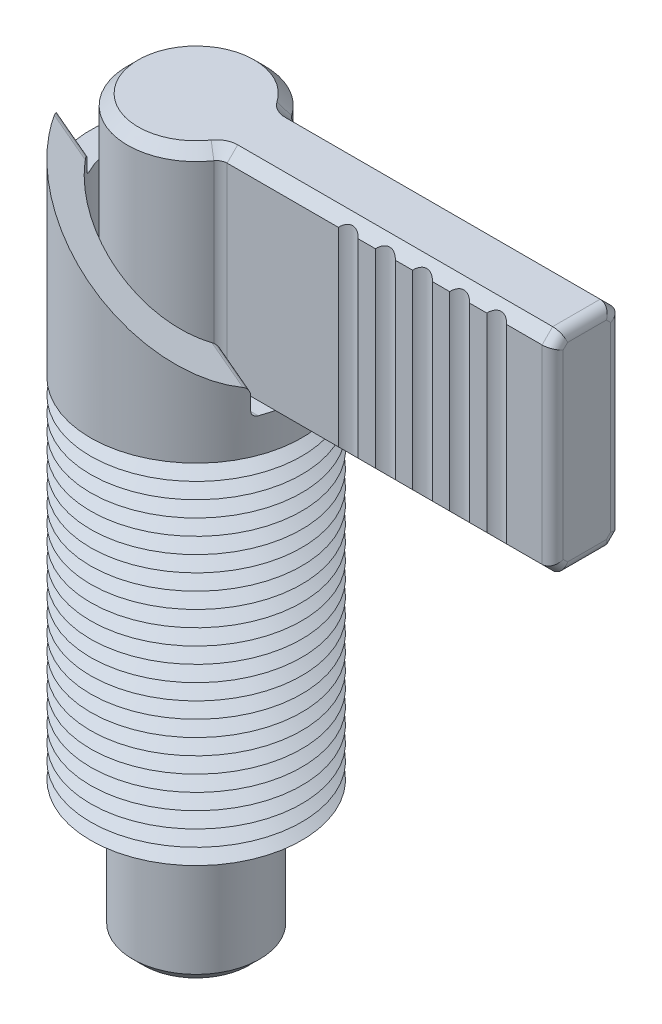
ISO-10303-21;
HEADER;
FILE_DESCRIPTION(('STEP AP214'),'2;1');
FILE_NAME('part.step','',(''),(''),'','','');
FILE_SCHEMA(('AUTOMOTIVE_DESIGN { 1 0 10303 214 1 1 1 1 }'));
ENDSEC;
DATA;
#1=APPLICATION_CONTEXT('core data for automotive mechanical design processes');
#2=APPLICATION_PROTOCOL_DEFINITION('international standard','automotive_design',2000,#1);
#3=PRODUCT_CONTEXT('',#1,'mechanical');
#4=PRODUCT('Part','Part','',(#3));
#5=PRODUCT_RELATED_PRODUCT_CATEGORY('part','',(#4));
#6=PRODUCT_DEFINITION_FORMATION('','',#4);
#7=PRODUCT_DEFINITION_CONTEXT('part definition',#1,'design');
#8=PRODUCT_DEFINITION('design','',#6,#7);
#9=PRODUCT_DEFINITION_SHAPE('','',#8);
#10=(LENGTH_UNIT() NAMED_UNIT(*) SI_UNIT(.MILLI.,.METRE.));
#11=(NAMED_UNIT(*) PLANE_ANGLE_UNIT() SI_UNIT($,.RADIAN.));
#12=(NAMED_UNIT(*) SI_UNIT($,.STERADIAN.) SOLID_ANGLE_UNIT());
#13=UNCERTAINTY_MEASURE_WITH_UNIT(LENGTH_MEASURE(1.E-05),#10,'distance_accuracy_value','');
#14=(GEOMETRIC_REPRESENTATION_CONTEXT(3) GLOBAL_UNCERTAINTY_ASSIGNED_CONTEXT((#13)) GLOBAL_UNIT_ASSIGNED_CONTEXT((#10,
#11,#12)) REPRESENTATION_CONTEXT('',''));
#15=CARTESIAN_POINT('',(0.,0.,0.));
#16=DIRECTION('',(0.,0.,1.));
#17=DIRECTION('',(1.,0.,0.));
#18=AXIS2_PLACEMENT_3D('',#15,#16,#17);
#19=CARTESIAN_POINT('',(5.62916512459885,4.96284530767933,3.25));
#20=DIRECTION('',(0.,0.,1.));
#21=DIRECTION('',(1.,0.,0.));
#22=AXIS2_PLACEMENT_3D('',#19,#20,#21);
#23=PLANE('',#22);
#24=DIRECTION('',(0.,1.,0.));
#25=VECTOR('',#24,1.);
#26=CARTESIAN_POINT('',(18.5915927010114,-12.,3.25));
#27=LINE('',#26,#25);
#28=CARTESIAN_POINT('',(18.5915927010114,38.001,3.25));
#29=VERTEX_POINT('',#28);
#30=CARTESIAN_POINT('',(18.5915927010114,55.999,3.25));
#31=VERTEX_POINT('',#30);
#32=EDGE_CURVE('P0_E200',#29,#31,#27,.T.);
#33=ORIENTED_EDGE('',*,*,#32,.F.);
#34=DIRECTION('',(1.,0.,0.));
#35=VECTOR('',#34,1.);
#36=CARTESIAN_POINT('',(37.,38.001,3.25));
#37=LINE('',#36,#35);
#38=CARTESIAN_POINT('',(20.2214072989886,38.001,3.25));
#39=VERTEX_POINT('',#38);
#40=EDGE_CURVE('P0_E209',#29,#39,#37,.T.);
#41=ORIENTED_EDGE('',*,*,#40,.T.);
#42=DIRECTION('',(0.,1.,0.));
#43=VECTOR('',#42,1.);
#44=CARTESIAN_POINT('',(20.2214072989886,-12.,3.25));
#45=LINE('',#44,#43);
#46=CARTESIAN_POINT('',(20.2214072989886,55.999,3.25));
#47=VERTEX_POINT('',#46);
#48=EDGE_CURVE('P0_E210',#39,#47,#45,.T.);
#49=ORIENTED_EDGE('',*,*,#48,.T.);
#50=DIRECTION('',(-1.,0.,0.));
#51=VECTOR('',#50,1.);
#52=CARTESIAN_POINT('',(6.18012944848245,55.999,3.25));
#53=LINE('',#52,#51);
#54=EDGE_CURVE('P0_E236',#47,#31,#53,.T.);
#55=ORIENTED_EDGE('',*,*,#54,.T.);
#56=EDGE_LOOP('',(#33,#41,#49,#55));
#57=FACE_BOUND('',#56,.T.);
#58=ADVANCED_FACE('P0_F16',(#57),#23,.T.);
#59=DIRECTION('',(0.,1.,0.));
#60=VECTOR('',#59,1.);
#61=CARTESIAN_POINT('',(22.1065927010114,-12.,3.25));
#62=LINE('',#61,#60);
#63=CARTESIAN_POINT('',(22.1065927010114,38.001,3.25));
#64=VERTEX_POINT('',#63);
#65=CARTESIAN_POINT('',(22.1065927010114,55.999,3.25));
#66=VERTEX_POINT('',#65);
#67=EDGE_CURVE('P0_E299',#64,#66,#62,.T.);
#68=ORIENTED_EDGE('',*,*,#67,.F.);
#69=CARTESIAN_POINT('',(23.7364072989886,38.001,3.25));
#70=VERTEX_POINT('',#69);
#71=EDGE_CURVE('P0_E221',#64,#70,#37,.T.);
#72=ORIENTED_EDGE('',*,*,#71,.T.);
#73=DIRECTION('',(0.,1.,0.));
#74=VECTOR('',#73,1.);
#75=CARTESIAN_POINT('',(23.7364072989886,-12.,3.25));
#76=LINE('',#75,#74);
#77=CARTESIAN_POINT('',(23.7364072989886,55.999,3.25));
#78=VERTEX_POINT('',#77);
#79=EDGE_CURVE('P0_E293',#70,#78,#76,.T.);
#80=ORIENTED_EDGE('',*,*,#79,.T.);
#81=EDGE_CURVE('P0_E239',#78,#66,#53,.T.);
#82=ORIENTED_EDGE('',*,*,#81,.T.);
#83=EDGE_LOOP('',(#68,#72,#80,#82));
#84=FACE_BOUND('',#83,.T.);
#85=ADVANCED_FACE('P0_F496',(#84),#23,.T.);
#86=DIRECTION('',(0.,1.,0.));
#87=VECTOR('',#86,1.);
#88=CARTESIAN_POINT('',(25.6215927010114,-12.,3.25));
#89=LINE('',#88,#87);
#90=CARTESIAN_POINT('',(25.6215927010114,38.001,3.25));
#91=VERTEX_POINT('',#90);
#92=CARTESIAN_POINT('',(25.6215927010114,55.999,3.25));
#93=VERTEX_POINT('',#92);
#94=EDGE_CURVE('P0_E292',#91,#93,#89,.T.);
#95=ORIENTED_EDGE('',*,*,#94,.F.);
#96=CARTESIAN_POINT('',(27.2514072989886,38.001,3.25));
#97=VERTEX_POINT('',#96);
#98=EDGE_CURVE('P0_E228',#91,#97,#37,.T.);
#99=ORIENTED_EDGE('',*,*,#98,.T.);
#100=DIRECTION('',(0.,1.,0.));
#101=VECTOR('',#100,1.);
#102=CARTESIAN_POINT('',(27.2514072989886,-12.,3.25));
#103=LINE('',#102,#101);
#104=CARTESIAN_POINT('',(27.2514072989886,55.999,3.25));
#105=VERTEX_POINT('',#104);
#106=EDGE_CURVE('P0_E286',#97,#105,#103,.T.);
#107=ORIENTED_EDGE('',*,*,#106,.T.);
#108=EDGE_CURVE('P0_E234',#105,#93,#53,.T.);
#109=ORIENTED_EDGE('',*,*,#108,.T.);
#110=EDGE_LOOP('',(#95,#99,#107,#109));
#111=FACE_BOUND('',#110,.T.);
#112=ADVANCED_FACE('P0_F324',(#111),#23,.T.);
#113=DIRECTION('',(0.,1.,0.));
#114=VECTOR('',#113,1.);
#115=CARTESIAN_POINT('',(29.1365927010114,-12.,3.25));
#116=LINE('',#115,#114);
#117=CARTESIAN_POINT('',(29.1365927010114,38.001,3.25));
#118=VERTEX_POINT('',#117);
#119=CARTESIAN_POINT('',(29.1365927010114,55.999,3.25));
#120=VERTEX_POINT('',#119);
#121=EDGE_CURVE('P0_E285',#118,#120,#116,.T.);
#122=ORIENTED_EDGE('',*,*,#121,.F.);
#123=CARTESIAN_POINT('',(30.7664072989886,38.001,3.25));
#124=VERTEX_POINT('',#123);
#125=EDGE_CURVE('P0_E223',#118,#124,#37,.T.);
#126=ORIENTED_EDGE('',*,*,#125,.T.);
#127=DIRECTION('',(0.,1.,0.));
#128=VECTOR('',#127,1.);
#129=CARTESIAN_POINT('',(30.7664072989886,-12.,3.25));
#130=LINE('',#129,#128);
#131=CARTESIAN_POINT('',(30.7664072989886,55.999,3.25));
#132=VERTEX_POINT('',#131);
#133=EDGE_CURVE('P0_E279',#124,#132,#130,.T.);
#134=ORIENTED_EDGE('',*,*,#133,.T.);
#135=EDGE_CURVE('P0_E229',#132,#120,#53,.T.);
#136=ORIENTED_EDGE('',*,*,#135,.T.);
#137=EDGE_LOOP('',(#122,#126,#134,#136));
#138=FACE_BOUND('',#137,.T.);
#139=ADVANCED_FACE('P0_F337',(#138),#23,.T.);
#140=CARTESIAN_POINT('',(32.6515927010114,38.001,3.25));
#141=VERTEX_POINT('',#140);
#142=CARTESIAN_POINT('',(35.999,38.001,3.25));
#143=VERTEX_POINT('',#142);
#144=EDGE_CURVE('P0_E218',#141,#143,#37,.T.);
#145=ORIENTED_EDGE('',*,*,#144,.T.);
#146=DIRECTION('',(0.,1.,0.));
#147=VECTOR('',#146,1.);
#148=CARTESIAN_POINT('',(35.999,4.96284530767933,3.25));
#149=LINE('',#148,#147);
#150=CARTESIAN_POINT('',(35.999,55.999,3.25));
#151=VERTEX_POINT('',#150);
#152=EDGE_CURVE('P0_E11',#143,#151,#149,.T.);
#153=ORIENTED_EDGE('',*,*,#152,.T.);
#154=CARTESIAN_POINT('',(32.6515927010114,55.999,3.25));
#155=VERTEX_POINT('',#154);
#156=EDGE_CURVE('P0_E224',#151,#155,#53,.T.);
#157=ORIENTED_EDGE('',*,*,#156,.T.);
#158=DIRECTION('',(0.,1.,0.));
#159=VECTOR('',#158,1.);
#160=CARTESIAN_POINT('',(32.6515927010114,-12.,3.25));
#161=LINE('',#160,#159);
#162=EDGE_CURVE('P0_E278',#141,#155,#161,.T.);
#163=ORIENTED_EDGE('',*,*,#162,.F.);
#164=EDGE_LOOP('',(#145,#153,#157,#163));
#165=FACE_BOUND('',#164,.T.);
#166=ADVANCED_FACE('P0_F506',(#165),#23,.T.);
#167=CARTESIAN_POINT('',(0.,-12.,0.));
#168=DIRECTION('',(0.,1.,0.));
#169=DIRECTION('',(0.,0.,1.));
#170=AXIS2_PLACEMENT_3D('',#167,#168,#169);
#171=PLANE('',#170);
#172=CARTESIAN_POINT('',(0.,-12.,0.));
#173=DIRECTION('',(0.,-1.,0.));
#174=DIRECTION('',(0.,0.,-1.));
#175=AXIS2_PLACEMENT_3D('',#172,#173,#174);
#176=CIRCLE('',#175,5.);
#177=CARTESIAN_POINT('',(0.,-12.,-5.));
#178=VERTEX_POINT('',#177);
#179=EDGE_CURVE('P0_E259',#178,#178,#176,.T.);
#180=ORIENTED_EDGE('',*,*,#179,.T.);
#181=EDGE_LOOP('',(#180));
#182=FACE_BOUND('',#181,.T.);
#183=ADVANCED_FACE('P0_F516',(#182),#171,.F.);
#184=CARTESIAN_POINT('',(0.,-11.,0.));
#185=DIRECTION('',(0.,1.,0.));
#186=DIRECTION('',(0.,0.,1.));
#187=AXIS2_PLACEMENT_3D('',#184,#185,#186);
#188=CONICAL_SURFACE('',#187,6.,0.785398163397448);
#189=ORIENTED_EDGE('',*,*,#179,.F.);
#190=EDGE_LOOP('',(#189));
#191=FACE_BOUND('',#190,.T.);
#192=CARTESIAN_POINT('',(0.,-11.,0.));
#193=DIRECTION('',(0.,-1.,0.));
#194=DIRECTION('',(0.,0.,-1.));
#195=AXIS2_PLACEMENT_3D('',#192,#193,#194);
#196=CIRCLE('',#195,6.);
#197=CARTESIAN_POINT('',(0.,-11.,-6.));
#198=VERTEX_POINT('',#197);
#199=EDGE_CURVE('P0_E262',#198,#198,#196,.T.);
#200=ORIENTED_EDGE('',*,*,#199,.T.);
#201=EDGE_LOOP('',(#200));
#202=FACE_BOUND('',#201,.T.);
#203=ADVANCED_FACE('P0_F521',(#191,#202),#188,.T.);
#204=CARTESIAN_POINT('',(0.,-12.,0.));
#205=DIRECTION('',(0.,-1.,0.));
#206=DIRECTION('',(0.,0.,-1.));
#207=AXIS2_PLACEMENT_3D('',#204,#205,#206);
#208=CYLINDRICAL_SURFACE('',#207,6.);
#209=ORIENTED_EDGE('',*,*,#199,.F.);
#210=EDGE_LOOP('',(#209));
#211=FACE_BOUND('',#210,.T.);
#212=CARTESIAN_POINT('',(0.,9.,0.));
#213=DIRECTION('',(0.,-1.,0.));
#214=DIRECTION('',(0.,0.,-1.));
#215=AXIS2_PLACEMENT_3D('',#212,#213,#214);
#216=CIRCLE('',#215,6.);
#217=CARTESIAN_POINT('',(0.,9.,-6.));
#218=VERTEX_POINT('',#217);
#219=EDGE_CURVE('P0_E265',#218,#218,#216,.T.);
#220=ORIENTED_EDGE('',*,*,#219,.T.);
#221=EDGE_LOOP('',(#220));
#222=FACE_BOUND('',#221,.T.);
#223=ADVANCED_FACE('P0_F555',(#211,#222),#208,.T.);
#224=CARTESIAN_POINT('',(-6.,9.,0.));
#225=DIRECTION('',(0.,-1.,0.));
#226=DIRECTION('',(0.,0.,-1.));
#227=AXIS2_PLACEMENT_3D('',#224,#225,#226);
#228=PLANE('',#227);
#229=ORIENTED_EDGE('',*,*,#219,.F.);
#230=EDGE_LOOP('',(#229));
#231=FACE_BOUND('',#230,.T.);
#232=CARTESIAN_POINT('',(0.,9.,0.));
#233=DIRECTION('',(0.,-1.,0.));
#234=DIRECTION('',(0.,0.,-1.));
#235=AXIS2_PLACEMENT_3D('',#232,#233,#234);
#236=CIRCLE('',#235,4.5);
#237=CARTESIAN_POINT('',(0.,9.,-4.5));
#238=VERTEX_POINT('',#237);
#239=EDGE_CURVE('P0_E268',#238,#238,#236,.T.);
#240=ORIENTED_EDGE('',*,*,#239,.T.);
#241=EDGE_LOOP('',(#240));
#242=FACE_BOUND('',#241,.T.);
#243=ADVANCED_FACE('P0_F563',(#231,#242),#228,.F.);
#244=CARTESIAN_POINT('',(0.,-12.,0.));
#245=DIRECTION('',(0.,-1.,0.));
#246=DIRECTION('',(0.,0.,-1.));
#247=AXIS2_PLACEMENT_3D('',#244,#245,#246);
#248=CYLINDRICAL_SURFACE('',#247,4.5);
#249=ORIENTED_EDGE('',*,*,#239,.F.);
#250=EDGE_LOOP('',(#249));
#251=FACE_BOUND('',#250,.T.);
#252=CARTESIAN_POINT('',(0.,37.,0.));
#253=DIRECTION('',(0.,-1.,0.));
#254=DIRECTION('',(0.,0.,-1.));
#255=AXIS2_PLACEMENT_3D('',#252,#253,#254);
#256=CIRCLE('',#255,4.5);
#257=CARTESIAN_POINT('',(0.,37.,-4.5));
#258=VERTEX_POINT('',#257);
#259=EDGE_CURVE('P0_E271',#258,#258,#256,.T.);
#260=ORIENTED_EDGE('',*,*,#259,.T.);
#261=EDGE_LOOP('',(#260));
#262=FACE_BOUND('',#261,.T.);
#263=ADVANCED_FACE('P0_F571',(#251,#262),#248,.T.);
#264=CARTESIAN_POINT('',(-4.5,37.,0.));
#265=DIRECTION('',(0.,1.,0.));
#266=DIRECTION('',(0.,0.,1.));
#267=AXIS2_PLACEMENT_3D('',#264,#265,#266);
#268=PLANE('',#267);
#269=ORIENTED_EDGE('',*,*,#259,.F.);
#270=EDGE_LOOP('',(#269));
#271=FACE_BOUND('',#270,.T.);
#272=DIRECTION('',(1.,0.,0.));
#273=VECTOR('',#272,1.);
#274=CARTESIAN_POINT('',(37.,37.,-2.24899999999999));
#275=LINE('',#274,#273);
#276=CARTESIAN_POINT('',(6.18012944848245,37.,-2.24899999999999));
#277=VERTEX_POINT('',#276);
#278=CARTESIAN_POINT('',(35.999,37.,-2.24899999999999));
#279=VERTEX_POINT('',#278);
#280=EDGE_CURVE('P0_E247',#277,#279,#275,.T.);
#281=ORIENTED_EDGE('',*,*,#280,.T.);
#282=DIRECTION('',(0.,0.,1.));
#283=VECTOR('',#282,1.);
#284=CARTESIAN_POINT('',(35.999,37.,2.24899999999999));
#285=LINE('',#284,#283);
#286=CARTESIAN_POINT('',(35.999,37.,2.24899999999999));
#287=VERTEX_POINT('',#286);
#288=EDGE_CURVE('P0_E40',#279,#287,#285,.T.);
#289=ORIENTED_EDGE('',*,*,#288,.T.);
#290=DIRECTION('',(-1.,0.,0.));
#291=VECTOR('',#290,1.);
#292=CARTESIAN_POINT('',(6.18012944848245,37.,2.24899999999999));
#293=LINE('',#292,#291);
#294=CARTESIAN_POINT('',(6.18012944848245,37.,2.24899999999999));
#295=VERTEX_POINT('',#294);
#296=EDGE_CURVE('P0_E237',#287,#295,#293,.T.);
#297=ORIENTED_EDGE('',*,*,#296,.T.);
#298=CARTESIAN_POINT('',(6.18012944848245,37.,4.251));
#299=DIRECTION('',(0.,1.,0.));
#300=DIRECTION('',(0.,0.,1.));
#301=AXIS2_PLACEMENT_3D('',#298,#299,#300);
#302=CIRCLE('',#301,2.00200000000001);
#303=CARTESIAN_POINT('',(4.53066682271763,37.,3.11641767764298));
#304=VERTEX_POINT('',#303);
#305=EDGE_CURVE('P0_E240',#295,#304,#302,.T.);
#306=ORIENTED_EDGE('',*,*,#305,.T.);
#307=CARTESIAN_POINT('',(0.,37.,0.));
#308=DIRECTION('',(0.,1.,0.));
#309=DIRECTION('',(0.,0.,1.));
#310=AXIS2_PLACEMENT_3D('',#307,#308,#309);
#311=CIRCLE('',#310,5.49899999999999);
#312=CARTESIAN_POINT('',(4.53066682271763,37.,-3.11641767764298));
#313=VERTEX_POINT('',#312);
#314=EDGE_CURVE('P0_E241',#304,#313,#311,.F.);
#315=ORIENTED_EDGE('',*,*,#314,.T.);
#316=CARTESIAN_POINT('',(6.18012944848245,37.,-4.251));
#317=DIRECTION('',(0.,1.,0.));
#318=DIRECTION('',(0.,0.,1.));
#319=AXIS2_PLACEMENT_3D('',#316,#317,#318);
#320=CIRCLE('',#319,2.00200000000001);
#321=EDGE_CURVE('P0_E245',#313,#277,#320,.T.);
#322=ORIENTED_EDGE('',*,*,#321,.T.);
#323=EDGE_LOOP('',(#281,#289,#297,#306,#315,#322));
#324=FACE_BOUND('',#323,.T.);
#325=ADVANCED_FACE('P0_F422',(#271,#324),#268,.F.);
#326=CARTESIAN_POINT('',(0.,-12.,0.));
#327=DIRECTION('',(0.,-1.,0.));
#328=DIRECTION('',(0.,0.,-1.));
#329=AXIS2_PLACEMENT_3D('',#326,#327,#328);
#330=CYLINDRICAL_SURFACE('',#329,6.5);
#331=DIRECTION('',(0.,-1.,0.));
#332=VECTOR('',#331,1.);
#333=CARTESIAN_POINT('',(5.35539813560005,-12.,-3.68370883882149));
#334=LINE('',#333,#332);
#335=CARTESIAN_POINT('',(5.35539813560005,55.999,-3.68370883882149));
#336=VERTEX_POINT('',#335);
#337=CARTESIAN_POINT('',(5.35539813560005,38.001,-3.68370883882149));
#338=VERTEX_POINT('',#337);
#339=EDGE_CURVE('P0_E250',#336,#338,#334,.T.);
#340=ORIENTED_EDGE('',*,*,#339,.T.);
#341=CARTESIAN_POINT('',(0.,38.001,0.));
#342=DIRECTION('',(0.,1.,0.));
#343=DIRECTION('',(0.,0.,1.));
#344=AXIS2_PLACEMENT_3D('',#341,#342,#343);
#345=CIRCLE('',#344,6.5);
#346=CARTESIAN_POINT('',(5.35539813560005,38.001,3.68370883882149));
#347=VERTEX_POINT('',#346);
#348=EDGE_CURVE('P0_E436',#338,#347,#345,.T.);
#349=ORIENTED_EDGE('',*,*,#348,.T.);
#350=DIRECTION('',(0.,-1.,0.));
#351=VECTOR('',#350,1.);
#352=CARTESIAN_POINT('',(5.35539813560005,-12.,3.68370883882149));
#353=LINE('',#352,#351);
#354=CARTESIAN_POINT('',(5.35539813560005,55.999,3.68370883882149));
#355=VERTEX_POINT('',#354);
#356=EDGE_CURVE('P0_E253',#347,#355,#353,.F.);
#357=ORIENTED_EDGE('',*,*,#356,.T.);
#358=CARTESIAN_POINT('',(0.,55.999,0.));
#359=DIRECTION('',(0.,-1.,0.));
#360=DIRECTION('',(0.,0.,-1.));
#361=AXIS2_PLACEMENT_3D('',#358,#359,#360);
#362=CIRCLE('',#361,6.5);
#363=EDGE_CURVE('P0_E476',#355,#336,#362,.T.);
#364=ORIENTED_EDGE('',*,*,#363,.T.);
#365=EDGE_LOOP('',(#340,#349,#357,#364));
#366=FACE_BOUND('',#365,.T.);
#367=ADVANCED_FACE('P0_F586',(#366),#330,.T.);
#368=CARTESIAN_POINT('',(-6.5,57.,0.));
#369=DIRECTION('',(0.,-1.,0.));
#370=DIRECTION('',(0.,0.,-1.));
#371=AXIS2_PLACEMENT_3D('',#368,#369,#370);
#372=PLANE('',#371);
#373=DIRECTION('',(1.,0.,0.));
#374=VECTOR('',#373,1.);
#375=CARTESIAN_POINT('',(37.,57.,2.24899999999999));
#376=LINE('',#375,#374);
#377=CARTESIAN_POINT('',(6.18012944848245,57.,2.24899999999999));
#378=VERTEX_POINT('',#377);
#379=CARTESIAN_POINT('',(35.999,57.,2.24899999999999));
#380=VERTEX_POINT('',#379);
#381=EDGE_CURVE('P0_E343',#378,#380,#376,.T.);
#382=ORIENTED_EDGE('',*,*,#381,.T.);
#383=DIRECTION('',(0.,0.,-1.));
#384=VECTOR('',#383,1.);
#385=CARTESIAN_POINT('',(35.999,57.,-2.249));
#386=LINE('',#385,#384);
#387=CARTESIAN_POINT('',(35.999,57.,-2.24899999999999));
#388=VERTEX_POINT('',#387);
#389=EDGE_CURVE('P0_E375',#380,#388,#386,.T.);
#390=ORIENTED_EDGE('',*,*,#389,.T.);
#391=DIRECTION('',(-1.,0.,0.));
#392=VECTOR('',#391,1.);
#393=CARTESIAN_POINT('',(6.18012944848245,57.,-2.24899999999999));
#394=LINE('',#393,#392);
#395=CARTESIAN_POINT('',(6.18012944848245,57.,-2.24899999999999));
#396=VERTEX_POINT('',#395);
#397=EDGE_CURVE('P0_E465',#388,#396,#394,.T.);
#398=ORIENTED_EDGE('',*,*,#397,.T.);
#399=CARTESIAN_POINT('',(6.18012944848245,57.,-4.251));
#400=DIRECTION('',(0.,-1.,0.));
#401=DIRECTION('',(0.,0.,-1.));
#402=AXIS2_PLACEMENT_3D('',#399,#400,#401);
#403=CIRCLE('',#402,2.00200000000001);
#404=CARTESIAN_POINT('',(4.53066682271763,57.,-3.11641767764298));
#405=VERTEX_POINT('',#404);
#406=EDGE_CURVE('P0_E463',#396,#405,#403,.T.);
#407=ORIENTED_EDGE('',*,*,#406,.T.);
#408=CARTESIAN_POINT('',(0.,57.,0.));
#409=DIRECTION('',(0.,-1.,0.));
#410=DIRECTION('',(0.,0.,-1.));
#411=AXIS2_PLACEMENT_3D('',#408,#409,#410);
#412=CIRCLE('',#411,5.49899999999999);
#413=CARTESIAN_POINT('',(4.53066682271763,57.,3.11641767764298));
#414=VERTEX_POINT('',#413);
#415=EDGE_CURVE('P0_E461',#405,#414,#412,.F.);
#416=ORIENTED_EDGE('',*,*,#415,.T.);
#417=CARTESIAN_POINT('',(6.18012944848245,57.,4.251));
#418=DIRECTION('',(0.,-1.,0.));
#419=DIRECTION('',(0.,0.,-1.));
#420=AXIS2_PLACEMENT_3D('',#417,#418,#419);
#421=CIRCLE('',#420,2.00200000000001);
#422=EDGE_CURVE('P0_E348',#414,#378,#421,.T.);
#423=ORIENTED_EDGE('',*,*,#422,.T.);
#424=EDGE_LOOP('',(#382,#390,#398,#407,#416,#423));
#425=FACE_BOUND('',#424,.T.);
#426=ADVANCED_FACE('P0_F594',(#425),#372,.F.);
#427=CARTESIAN_POINT('',(5.62916512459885,4.96284530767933,-3.25));
#428=DIRECTION('',(0.,0.,-1.));
#429=DIRECTION('',(-1.,0.,0.));
#430=AXIS2_PLACEMENT_3D('',#427,#428,#429);
#431=PLANE('',#430);
#432=DIRECTION('',(1.,0.,0.));
#433=VECTOR('',#432,1.);
#434=CARTESIAN_POINT('',(37.,55.999,-3.25));
#435=LINE('',#434,#433);
#436=CARTESIAN_POINT('',(6.18012944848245,55.999,-3.25));
#437=VERTEX_POINT('',#436);
#438=CARTESIAN_POINT('',(35.999,55.999,-3.25));
#439=VERTEX_POINT('',#438);
#440=EDGE_CURVE('P0_E468',#437,#439,#435,.T.);
#441=ORIENTED_EDGE('',*,*,#440,.T.);
#442=DIRECTION('',(0.,1.,0.));
#443=VECTOR('',#442,1.);
#444=CARTESIAN_POINT('',(35.999,4.96284530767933,-3.25));
#445=LINE('',#444,#443);
#446=CARTESIAN_POINT('',(35.999,38.001,-3.25));
#447=VERTEX_POINT('',#446);
#448=EDGE_CURVE('P0_E379',#439,#447,#445,.F.);
#449=ORIENTED_EDGE('',*,*,#448,.T.);
#450=DIRECTION('',(-1.,0.,0.));
#451=VECTOR('',#450,1.);
#452=CARTESIAN_POINT('',(6.18012944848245,38.001,-3.25));
#453=LINE('',#452,#451);
#454=CARTESIAN_POINT('',(6.18012944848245,38.001,-3.25));
#455=VERTEX_POINT('',#454);
#456=EDGE_CURVE('P0_E421',#447,#455,#453,.T.);
#457=ORIENTED_EDGE('',*,*,#456,.T.);
#458=DIRECTION('',(0.,-1.,0.));
#459=VECTOR('',#458,1.);
#460=CARTESIAN_POINT('',(6.18012944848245,4.96284530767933,-3.25));
#461=LINE('',#460,#459);
#462=EDGE_CURVE('P0_E256',#455,#437,#461,.F.);
#463=ORIENTED_EDGE('',*,*,#462,.T.);
#464=EDGE_LOOP('',(#441,#449,#457,#463));
#465=FACE_BOUND('',#464,.T.);
#466=ADVANCED_FACE('P0_F513',(#465),#431,.T.);
#467=CARTESIAN_POINT('',(37.,4.96284530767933,3.25));
#468=DIRECTION('',(1.,0.,0.));
#469=DIRECTION('',(0.,0.,-1.));
#470=AXIS2_PLACEMENT_3D('',#467,#468,#469);
#471=PLANE('',#470);
#472=DIRECTION('',(0.,0.,-1.));
#473=VECTOR('',#472,1.);
#474=CARTESIAN_POINT('',(37.,55.999,2.24899999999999));
#475=LINE('',#474,#473);
#476=CARTESIAN_POINT('',(37.,55.999,-1.83437222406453));
#477=VERTEX_POINT('',#476);
#478=CARTESIAN_POINT('',(37.,55.999,1.83437222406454));
#479=VERTEX_POINT('',#478);
#480=EDGE_CURVE('P0_E367',#477,#479,#475,.F.);
#481=ORIENTED_EDGE('',*,*,#480,.T.);
#482=DIRECTION('',(0.,-0.70710678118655,0.707106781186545));
#483=VECTOR('',#482,1.);
#484=CARTESIAN_POINT('',(37.,29.7731087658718,28.0602634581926));
#485=LINE('',#484,#483);
#486=CARTESIAN_POINT('',(37.,55.5843722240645,2.249));
#487=VERTEX_POINT('',#486);
#488=EDGE_CURVE('P0_E369',#479,#487,#485,.T.);
#489=ORIENTED_EDGE('',*,*,#488,.T.);
#490=DIRECTION('',(0.,1.,0.));
#491=VECTOR('',#490,1.);
#492=CARTESIAN_POINT('',(37.,4.96284530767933,2.249));
#493=LINE('',#492,#491);
#494=CARTESIAN_POINT('',(37.,38.4156277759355,2.249));
#495=VERTEX_POINT('',#494);
#496=EDGE_CURVE('P0_E309',#487,#495,#493,.F.);
#497=ORIENTED_EDGE('',*,*,#496,.T.);
#498=DIRECTION('',(0.,-0.70710678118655,-0.707106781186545));
#499=VECTOR('',#498,1.);
#500=CARTESIAN_POINT('',(37.,22.1897365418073,-13.9768912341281));
#501=LINE('',#500,#499);
#502=CARTESIAN_POINT('',(37.,38.001,1.83437222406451));
#503=VERTEX_POINT('',#502);
#504=EDGE_CURVE('P0_E357',#495,#503,#501,.T.);
#505=ORIENTED_EDGE('',*,*,#504,.T.);
#506=DIRECTION('',(0.,0.,1.));
#507=VECTOR('',#506,1.);
#508=CARTESIAN_POINT('',(37.,38.001,-2.24899999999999));
#509=LINE('',#508,#507);
#510=CARTESIAN_POINT('',(37.,38.001,-1.83437222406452));
#511=VERTEX_POINT('',#510);
#512=EDGE_CURVE('P0_E359',#503,#511,#509,.F.);
#513=ORIENTED_EDGE('',*,*,#512,.T.);
#514=DIRECTION('',(0.,0.70710678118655,-0.707106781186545));
#515=VECTOR('',#514,1.);
#516=CARTESIAN_POINT('',(37.,18.9397365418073,17.2268912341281));
#517=LINE('',#516,#515);
#518=CARTESIAN_POINT('',(37.,38.4156277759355,-2.249));
#519=VERTEX_POINT('',#518);
#520=EDGE_CURVE('P0_E361',#511,#519,#517,.T.);
#521=ORIENTED_EDGE('',*,*,#520,.T.);
#522=DIRECTION('',(0.,1.,0.));
#523=VECTOR('',#522,1.);
#524=CARTESIAN_POINT('',(37.,4.96284530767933,-2.249));
#525=LINE('',#524,#523);
#526=CARTESIAN_POINT('',(37.,55.5843722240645,-2.249));
#527=VERTEX_POINT('',#526);
#528=EDGE_CURVE('P0_E363',#519,#527,#525,.T.);
#529=ORIENTED_EDGE('',*,*,#528,.T.);
#530=DIRECTION('',(0.,0.70710678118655,0.707106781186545));
#531=VECTOR('',#530,1.);
#532=CARTESIAN_POINT('',(37.,33.0231087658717,-24.8102634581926));
#533=LINE('',#532,#531);
#534=EDGE_CURVE('P0_E365',#527,#477,#533,.T.);
#535=ORIENTED_EDGE('',*,*,#534,.T.);
#536=EDGE_LOOP('',(#481,#489,#497,#505,#513,#521,#529,#535));
#537=FACE_BOUND('',#536,.T.);
#538=ADVANCED_FACE('P0_F505',(#537),#471,.T.);
#539=DIRECTION('',(0.,1.,0.));
#540=VECTOR('',#539,1.);
#541=CARTESIAN_POINT('',(16.7064072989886,-12.,3.25));
#542=LINE('',#541,#540);
#543=CARTESIAN_POINT('',(16.7064072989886,38.001,3.25));
#544=VERTEX_POINT('',#543);
#545=CARTESIAN_POINT('',(16.7064072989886,55.999,3.25));
#546=VERTEX_POINT('',#545);
#547=EDGE_CURVE('P0_E190',#544,#546,#542,.T.);
#548=ORIENTED_EDGE('',*,*,#547,.T.);
#549=CARTESIAN_POINT('',(6.18012944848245,55.999,3.25));
#550=VERTEX_POINT('',#549);
#551=EDGE_CURVE('P0_E230',#546,#550,#53,.T.);
#552=ORIENTED_EDGE('',*,*,#551,.T.);
#553=DIRECTION('',(0.,-1.,0.));
#554=VECTOR('',#553,1.);
#555=CARTESIAN_POINT('',(6.18012944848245,4.96284530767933,3.25));
#556=LINE('',#555,#554);
#557=CARTESIAN_POINT('',(6.18012944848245,38.001,3.25));
#558=VERTEX_POINT('',#557);
#559=EDGE_CURVE('P0_E215',#550,#558,#556,.T.);
#560=ORIENTED_EDGE('',*,*,#559,.T.);
#561=EDGE_CURVE('P0_E206',#558,#544,#37,.T.);
#562=ORIENTED_EDGE('',*,*,#561,.T.);
#563=EDGE_LOOP('',(#548,#552,#560,#562));
#564=FACE_BOUND('',#563,.T.);
#565=ADVANCED_FACE('P0_F213',(#564),#23,.T.);
#566=CARTESIAN_POINT('',(6.18012944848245,-12.,-4.251));
#567=DIRECTION('',(0.,-1.,0.));
#568=DIRECTION('',(0.,0.,-1.));
#569=AXIS2_PLACEMENT_3D('',#566,#567,#568);
#570=CYLINDRICAL_SURFACE('',#569,1.001);
#571=ORIENTED_EDGE('',*,*,#462,.F.);
#572=CARTESIAN_POINT('',(6.18012944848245,38.001,-4.251));
#573=DIRECTION('',(0.,1.,0.));
#574=DIRECTION('',(0.,0.,1.));
#575=AXIS2_PLACEMENT_3D('',#572,#573,#574);
#576=CIRCLE('',#575,1.001);
#577=EDGE_CURVE('P0_E471',#455,#338,#576,.F.);
#578=ORIENTED_EDGE('',*,*,#577,.T.);
#579=ORIENTED_EDGE('',*,*,#339,.F.);
#580=CARTESIAN_POINT('',(6.18012944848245,55.999,-4.251));
#581=DIRECTION('',(0.,-1.,0.));
#582=DIRECTION('',(0.,0.,-1.));
#583=AXIS2_PLACEMENT_3D('',#580,#581,#582);
#584=CIRCLE('',#583,1.001);
#585=EDGE_CURVE('P0_E473',#336,#437,#584,.F.);
#586=ORIENTED_EDGE('',*,*,#585,.T.);
#587=EDGE_LOOP('',(#571,#578,#579,#586));
#588=FACE_BOUND('',#587,.T.);
#589=ADVANCED_FACE('P0_F504',(#588),#570,.F.);
#590=CARTESIAN_POINT('',(6.18012944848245,-12.,4.251));
#591=DIRECTION('',(0.,-1.,0.));
#592=DIRECTION('',(0.,0.,-1.));
#593=AXIS2_PLACEMENT_3D('',#590,#591,#592);
#594=CYLINDRICAL_SURFACE('',#593,1.001);
#595=ORIENTED_EDGE('',*,*,#356,.F.);
#596=CARTESIAN_POINT('',(6.18012944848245,38.001,4.251));
#597=DIRECTION('',(0.,1.,0.));
#598=DIRECTION('',(0.,0.,1.));
#599=AXIS2_PLACEMENT_3D('',#596,#597,#598);
#600=CIRCLE('',#599,1.001);
#601=EDGE_CURVE('P0_E219',#347,#558,#600,.F.);
#602=ORIENTED_EDGE('',*,*,#601,.T.);
#603=ORIENTED_EDGE('',*,*,#559,.F.);
#604=CARTESIAN_POINT('',(6.18012944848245,55.999,4.251));
#605=DIRECTION('',(0.,-1.,0.));
#606=DIRECTION('',(0.,0.,-1.));
#607=AXIS2_PLACEMENT_3D('',#604,#605,#606);
#608=CIRCLE('',#607,1.001);
#609=EDGE_CURVE('P0_E216',#550,#355,#608,.F.);
#610=ORIENTED_EDGE('',*,*,#609,.T.);
#611=EDGE_LOOP('',(#595,#602,#603,#610));
#612=FACE_BOUND('',#611,.T.);
#613=ADVANCED_FACE('P0_F481',(#612),#594,.F.);
#614=CARTESIAN_POINT('',(-4.5,37.,-2.24899999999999));
#615=DIRECTION('',(0.,-0.707106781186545,-0.70710678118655));
#616=DIRECTION('',(0.,0.70710678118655,-0.707106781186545));
#617=AXIS2_PLACEMENT_3D('',#614,#615,#616);
#618=PLANE('',#617);
#619=ORIENTED_EDGE('',*,*,#456,.F.);
#620=DIRECTION('',(0.,0.70710678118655,-0.707106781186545));
#621=VECTOR('',#620,1.);
#622=CARTESIAN_POINT('',(35.999,37.,-2.24899999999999));
#623=LINE('',#622,#621);
#624=EDGE_CURVE('P0_E381',#447,#279,#623,.F.);
#625=ORIENTED_EDGE('',*,*,#624,.T.);
#626=ORIENTED_EDGE('',*,*,#280,.F.);
#627=DIRECTION('',(0.,-0.70710678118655,0.707106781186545));
#628=VECTOR('',#627,1.);
#629=CARTESIAN_POINT('',(6.18012944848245,38.001,-3.25));
#630=LINE('',#629,#628);
#631=EDGE_CURVE('P0_E274',#455,#277,#630,.T.);
#632=ORIENTED_EDGE('',*,*,#631,.F.);
#633=EDGE_LOOP('',(#619,#625,#626,#632));
#634=FACE_BOUND('',#633,.T.);
#635=ADVANCED_FACE('P0_F418',(#634),#618,.T.);
#636=CARTESIAN_POINT('',(6.18012944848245,37.,-4.251));
#637=DIRECTION('',(0.,-1.,0.));
#638=DIRECTION('',(0.,0.,-1.));
#639=AXIS2_PLACEMENT_3D('',#636,#637,#638);
#640=CONICAL_SURFACE('',#639,2.00200000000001,0.785398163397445);
#641=ORIENTED_EDGE('',*,*,#631,.T.);
#642=ORIENTED_EDGE('',*,*,#321,.F.);
#643=DIRECTION('',(-0.58259051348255,-0.70710678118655,0.400734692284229));
#644=VECTOR('',#643,1.);
#645=CARTESIAN_POINT('',(5.35539813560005,38.001,-3.68370883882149));
#646=LINE('',#645,#644);
#647=EDGE_CURVE('P0_E430',#338,#313,#646,.T.);
#648=ORIENTED_EDGE('',*,*,#647,.F.);
#649=ORIENTED_EDGE('',*,*,#577,.F.);
#650=EDGE_LOOP('',(#641,#642,#648,#649));
#651=FACE_BOUND('',#650,.T.);
#652=ADVANCED_FACE('P0_F428',(#651),#640,.F.);
#653=CARTESIAN_POINT('',(0.,37.,0.));
#654=DIRECTION('',(0.,1.,0.));
#655=DIRECTION('',(0.,0.,1.));
#656=AXIS2_PLACEMENT_3D('',#653,#654,#655);
#657=CONICAL_SURFACE('',#656,5.49899999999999,0.785398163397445);
#658=ORIENTED_EDGE('',*,*,#647,.T.);
#659=ORIENTED_EDGE('',*,*,#314,.F.);
#660=DIRECTION('',(-0.58259051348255,-0.70710678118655,-0.400734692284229));
#661=VECTOR('',#660,1.);
#662=CARTESIAN_POINT('',(5.35539813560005,38.001,3.68370883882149));
#663=LINE('',#662,#661);
#664=EDGE_CURVE('P0_E437',#347,#304,#663,.T.);
#665=ORIENTED_EDGE('',*,*,#664,.F.);
#666=ORIENTED_EDGE('',*,*,#348,.F.);
#667=EDGE_LOOP('',(#658,#659,#665,#666));
#668=FACE_BOUND('',#667,.T.);
#669=ADVANCED_FACE('P0_F433',(#668),#657,.T.);
#670=CARTESIAN_POINT('',(6.18012944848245,37.,4.251));
#671=DIRECTION('',(0.,-1.,0.));
#672=DIRECTION('',(0.,0.,-1.));
#673=AXIS2_PLACEMENT_3D('',#670,#671,#672);
#674=CONICAL_SURFACE('',#673,2.00200000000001,0.785398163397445);
#675=ORIENTED_EDGE('',*,*,#664,.T.);
#676=ORIENTED_EDGE('',*,*,#305,.F.);
#677=DIRECTION('',(0.,-0.70710678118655,-0.707106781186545));
#678=VECTOR('',#677,1.);
#679=CARTESIAN_POINT('',(6.18012944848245,38.001,3.25));
#680=LINE('',#679,#678);
#681=EDGE_CURVE('P0_E440',#558,#295,#680,.T.);
#682=ORIENTED_EDGE('',*,*,#681,.F.);
#683=ORIENTED_EDGE('',*,*,#601,.F.);
#684=EDGE_LOOP('',(#675,#676,#682,#683));
#685=FACE_BOUND('',#684,.T.);
#686=ADVANCED_FACE('P0_F484',(#685),#674,.F.);
#687=CARTESIAN_POINT('',(-4.5,37.,2.24899999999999));
#688=DIRECTION('',(0.,-0.707106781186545,0.70710678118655));
#689=DIRECTION('',(0.,-0.70710678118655,-0.707106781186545));
#690=AXIS2_PLACEMENT_3D('',#687,#688,#689);
#691=PLANE('',#690);
#692=ORIENTED_EDGE('',*,*,#296,.F.);
#693=DIRECTION('',(0.,-0.70710678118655,-0.707106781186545));
#694=VECTOR('',#693,1.);
#695=CARTESIAN_POINT('',(35.999,37.,2.24899999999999));
#696=LINE('',#695,#694);
#697=EDGE_CURVE('P0_E25',#287,#143,#696,.F.);
#698=ORIENTED_EDGE('',*,*,#697,.T.);
#699=ORIENTED_EDGE('',*,*,#144,.F.);
#700=CARTESIAN_POINT('',(31.709,38.889,4.138));
#701=DIRECTION('',(0.,-0.707106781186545,0.70710678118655));
#702=DIRECTION('',(0.,0.70710678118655,0.707106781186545));
#703=AXIS2_PLACEMENT_3D('',#700,#701,#702);
#704=ELLIPSE('',#703,1.83140656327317,1.295);
#705=EDGE_CURVE('P0_E275',#124,#141,#704,.T.);
#706=ORIENTED_EDGE('',*,*,#705,.F.);
#707=ORIENTED_EDGE('',*,*,#125,.F.);
#708=CARTESIAN_POINT('',(28.194,38.889,4.138));
#709=DIRECTION('',(0.,-0.707106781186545,0.70710678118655));
#710=DIRECTION('',(0.,0.70710678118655,0.707106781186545));
#711=AXIS2_PLACEMENT_3D('',#708,#709,#710);
#712=ELLIPSE('',#711,1.83140656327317,1.295);
#713=EDGE_CURVE('P0_E282',#97,#118,#712,.T.);
#714=ORIENTED_EDGE('',*,*,#713,.F.);
#715=ORIENTED_EDGE('',*,*,#98,.F.);
#716=CARTESIAN_POINT('',(24.679,38.889,4.138));
#717=DIRECTION('',(0.,-0.707106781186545,0.70710678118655));
#718=DIRECTION('',(0.,0.70710678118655,0.707106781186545));
#719=AXIS2_PLACEMENT_3D('',#716,#717,#718);
#720=ELLIPSE('',#719,1.83140656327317,1.295);
#721=EDGE_CURVE('P0_E289',#70,#91,#720,.T.);
#722=ORIENTED_EDGE('',*,*,#721,.F.);
#723=ORIENTED_EDGE('',*,*,#71,.F.);
#724=CARTESIAN_POINT('',(21.164,38.889,4.138));
#725=DIRECTION('',(0.,-0.707106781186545,0.70710678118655));
#726=DIRECTION('',(0.,0.70710678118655,0.707106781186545));
#727=AXIS2_PLACEMENT_3D('',#724,#725,#726);
#728=ELLIPSE('',#727,1.83140656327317,1.295);
#729=EDGE_CURVE('P0_E296',#39,#64,#728,.T.);
#730=ORIENTED_EDGE('',*,*,#729,.F.);
#731=ORIENTED_EDGE('',*,*,#40,.F.);
#732=CARTESIAN_POINT('',(17.649,38.889,4.138));
#733=DIRECTION('',(0.,-0.707106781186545,0.70710678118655));
#734=DIRECTION('',(0.,0.70710678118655,0.707106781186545));
#735=AXIS2_PLACEMENT_3D('',#732,#733,#734);
#736=ELLIPSE('',#735,1.83140656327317,1.295);
#737=EDGE_CURVE('P0_E193',#544,#29,#736,.T.);
#738=ORIENTED_EDGE('',*,*,#737,.F.);
#739=ORIENTED_EDGE('',*,*,#561,.F.);
#740=ORIENTED_EDGE('',*,*,#681,.T.);
#741=EDGE_LOOP('',(#692,#698,#699,#706,#707,#714,#715,#722,#723,#730,#731,#738,#739,#740));
#742=FACE_BOUND('',#741,.T.);
#743=ADVANCED_FACE('P0_F204',(#742),#691,.T.);
#744=CARTESIAN_POINT('',(-6.5,57.,-2.24899999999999));
#745=DIRECTION('',(0.,0.707106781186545,-0.70710678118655));
#746=DIRECTION('',(0.,0.70710678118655,0.707106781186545));
#747=AXIS2_PLACEMENT_3D('',#744,#745,#746);
#748=PLANE('',#747);
#749=ORIENTED_EDGE('',*,*,#397,.F.);
#750=DIRECTION('',(0.,0.70710678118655,0.707106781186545));
#751=VECTOR('',#750,1.);
#752=CARTESIAN_POINT('',(35.999,57.,-2.24899999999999));
#753=LINE('',#752,#751);
#754=EDGE_CURVE('P0_E377',#388,#439,#753,.F.);
#755=ORIENTED_EDGE('',*,*,#754,.T.);
#756=ORIENTED_EDGE('',*,*,#440,.F.);
#757=DIRECTION('',(0.,-0.70710678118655,-0.707106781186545));
#758=VECTOR('',#757,1.);
#759=CARTESIAN_POINT('',(6.18012944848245,57.,-2.24899999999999));
#760=LINE('',#759,#758);
#761=EDGE_CURVE('P0_E351',#396,#437,#760,.T.);
#762=ORIENTED_EDGE('',*,*,#761,.F.);
#763=EDGE_LOOP('',(#749,#755,#756,#762));
#764=FACE_BOUND('',#763,.T.);
#765=ADVANCED_FACE('P0_F492',(#764),#748,.T.);
#766=CARTESIAN_POINT('',(6.18012944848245,57.,-4.251));
#767=DIRECTION('',(0.,1.,0.));
#768=DIRECTION('',(0.,0.,1.));
#769=AXIS2_PLACEMENT_3D('',#766,#767,#768);
#770=CONICAL_SURFACE('',#769,2.00200000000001,0.785398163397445);
#771=ORIENTED_EDGE('',*,*,#761,.T.);
#772=ORIENTED_EDGE('',*,*,#585,.F.);
#773=DIRECTION('',(0.58259051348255,-0.70710678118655,-0.400734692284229));
#774=VECTOR('',#773,1.);
#775=CARTESIAN_POINT('',(4.53066682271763,57.,-3.11641767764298));
#776=LINE('',#775,#774);
#777=EDGE_CURVE('P0_E447',#405,#336,#776,.T.);
#778=ORIENTED_EDGE('',*,*,#777,.F.);
#779=ORIENTED_EDGE('',*,*,#406,.F.);
#780=EDGE_LOOP('',(#771,#772,#778,#779));
#781=FACE_BOUND('',#780,.T.);
#782=ADVANCED_FACE('P0_F653',(#781),#770,.F.);
#783=CARTESIAN_POINT('',(0.,55.999,0.));
#784=DIRECTION('',(0.,-1.,0.));
#785=DIRECTION('',(0.,0.,-1.));
#786=AXIS2_PLACEMENT_3D('',#783,#784,#785);
#787=CONICAL_SURFACE('',#786,6.5,0.785398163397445);
#788=ORIENTED_EDGE('',*,*,#777,.T.);
#789=ORIENTED_EDGE('',*,*,#363,.F.);
#790=DIRECTION('',(0.58259051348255,-0.70710678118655,0.400734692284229));
#791=VECTOR('',#790,1.);
#792=CARTESIAN_POINT('',(4.53066682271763,57.,3.11641767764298));
#793=LINE('',#792,#791);
#794=EDGE_CURVE('P0_E445',#414,#355,#793,.T.);
#795=ORIENTED_EDGE('',*,*,#794,.F.);
#796=ORIENTED_EDGE('',*,*,#415,.F.);
#797=EDGE_LOOP('',(#788,#789,#795,#796));
#798=FACE_BOUND('',#797,.T.);
#799=ADVANCED_FACE('P0_F661',(#798),#787,.T.);
#800=CARTESIAN_POINT('',(6.18012944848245,57.,4.251));
#801=DIRECTION('',(0.,1.,0.));
#802=DIRECTION('',(0.,0.,1.));
#803=AXIS2_PLACEMENT_3D('',#800,#801,#802);
#804=CONICAL_SURFACE('',#803,2.00200000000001,0.785398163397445);
#805=ORIENTED_EDGE('',*,*,#794,.T.);
#806=ORIENTED_EDGE('',*,*,#609,.F.);
#807=DIRECTION('',(0.,-0.70710678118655,0.707106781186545));
#808=VECTOR('',#807,1.);
#809=CARTESIAN_POINT('',(6.18012944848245,57.,2.24899999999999));
#810=LINE('',#809,#808);
#811=EDGE_CURVE('P0_E277',#378,#550,#810,.T.);
#812=ORIENTED_EDGE('',*,*,#811,.F.);
#813=ORIENTED_EDGE('',*,*,#422,.F.);
#814=EDGE_LOOP('',(#805,#806,#812,#813));
#815=FACE_BOUND('',#814,.T.);
#816=ADVANCED_FACE('P0_F668',(#815),#804,.F.);
#817=CARTESIAN_POINT('',(-6.5,57.,2.24899999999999));
#818=DIRECTION('',(0.,0.707106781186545,0.70710678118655));
#819=DIRECTION('',(0.,-0.70710678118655,0.707106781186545));
#820=AXIS2_PLACEMENT_3D('',#817,#818,#819);
#821=PLANE('',#820);
#822=ORIENTED_EDGE('',*,*,#156,.F.);
#823=DIRECTION('',(0.,-0.70710678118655,0.707106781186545));
#824=VECTOR('',#823,1.);
#825=CARTESIAN_POINT('',(35.999,57.,2.24899999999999));
#826=LINE('',#825,#824);
#827=EDGE_CURVE('P0_E372',#151,#380,#826,.F.);
#828=ORIENTED_EDGE('',*,*,#827,.T.);
#829=ORIENTED_EDGE('',*,*,#381,.F.);
#830=ORIENTED_EDGE('',*,*,#811,.T.);
#831=ORIENTED_EDGE('',*,*,#551,.F.);
#832=CARTESIAN_POINT('',(17.649,55.111,4.138));
#833=DIRECTION('',(0.,0.707106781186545,0.70710678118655));
#834=DIRECTION('',(0.,0.70710678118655,-0.707106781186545));
#835=AXIS2_PLACEMENT_3D('',#832,#833,#834);
#836=ELLIPSE('',#835,1.83140656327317,1.295);
#837=EDGE_CURVE('P0_E196',#31,#546,#836,.T.);
#838=ORIENTED_EDGE('',*,*,#837,.F.);
#839=ORIENTED_EDGE('',*,*,#54,.F.);
#840=CARTESIAN_POINT('',(21.164,55.111,4.138));
#841=DIRECTION('',(0.,0.707106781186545,0.70710678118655));
#842=DIRECTION('',(0.,0.70710678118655,-0.707106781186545));
#843=AXIS2_PLACEMENT_3D('',#840,#841,#842);
#844=ELLIPSE('',#843,1.83140656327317,1.295);
#845=EDGE_CURVE('P0_E310',#66,#47,#844,.T.);
#846=ORIENTED_EDGE('',*,*,#845,.F.);
#847=ORIENTED_EDGE('',*,*,#81,.F.);
#848=CARTESIAN_POINT('',(24.679,55.111,4.138));
#849=DIRECTION('',(0.,0.707106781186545,0.70710678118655));
#850=DIRECTION('',(0.,0.70710678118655,-0.707106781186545));
#851=AXIS2_PLACEMENT_3D('',#848,#849,#850);
#852=ELLIPSE('',#851,1.83140656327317,1.295);
#853=EDGE_CURVE('P0_E345',#93,#78,#852,.T.);
#854=ORIENTED_EDGE('',*,*,#853,.F.);
#855=ORIENTED_EDGE('',*,*,#108,.F.);
#856=CARTESIAN_POINT('',(28.194,55.111,4.138));
#857=DIRECTION('',(0.,0.707106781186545,0.70710678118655));
#858=DIRECTION('',(0.,0.70710678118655,-0.707106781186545));
#859=AXIS2_PLACEMENT_3D('',#856,#857,#858);
#860=ELLIPSE('',#859,1.83140656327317,1.295);
#861=EDGE_CURVE('P0_E332',#120,#105,#860,.T.);
#862=ORIENTED_EDGE('',*,*,#861,.F.);
#863=ORIENTED_EDGE('',*,*,#135,.F.);
#864=CARTESIAN_POINT('',(31.709,55.111,4.138));
#865=DIRECTION('',(0.,0.707106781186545,0.70710678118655));
#866=DIRECTION('',(0.,0.70710678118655,-0.707106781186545));
#867=AXIS2_PLACEMENT_3D('',#864,#865,#866);
#868=ELLIPSE('',#867,1.83140656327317,1.295);
#869=EDGE_CURVE('P0_E342',#155,#132,#868,.T.);
#870=ORIENTED_EDGE('',*,*,#869,.F.);
#871=EDGE_LOOP('',(#822,#828,#829,#830,#831,#838,#839,#846,#847,#854,#855,#862,#863,#870));
#872=FACE_BOUND('',#871,.T.);
#873=ADVANCED_FACE('P0_F306',(#872),#821,.T.);
#874=CARTESIAN_POINT('',(31.709,-12.,4.138));
#875=DIRECTION('',(0.,1.,0.));
#876=DIRECTION('',(0.,0.,1.));
#877=AXIS2_PLACEMENT_3D('',#874,#875,#876);
#878=CYLINDRICAL_SURFACE('',#877,1.295);
#879=ORIENTED_EDGE('',*,*,#705,.T.);
#880=ORIENTED_EDGE('',*,*,#162,.T.);
#881=ORIENTED_EDGE('',*,*,#869,.T.);
#882=ORIENTED_EDGE('',*,*,#133,.F.);
#883=EDGE_LOOP('',(#879,#880,#881,#882));
#884=FACE_BOUND('',#883,.T.);
#885=ADVANCED_FACE('P0_F340',(#884),#878,.F.);
#886=CARTESIAN_POINT('',(28.194,-12.,4.138));
#887=DIRECTION('',(0.,1.,0.));
#888=DIRECTION('',(0.,0.,1.));
#889=AXIS2_PLACEMENT_3D('',#886,#887,#888);
#890=CYLINDRICAL_SURFACE('',#889,1.295);
#891=ORIENTED_EDGE('',*,*,#713,.T.);
#892=ORIENTED_EDGE('',*,*,#121,.T.);
#893=ORIENTED_EDGE('',*,*,#861,.T.);
#894=ORIENTED_EDGE('',*,*,#106,.F.);
#895=EDGE_LOOP('',(#891,#892,#893,#894));
#896=FACE_BOUND('',#895,.T.);
#897=ADVANCED_FACE('P0_F329',(#896),#890,.F.);
#898=CARTESIAN_POINT('',(24.679,-12.,4.138));
#899=DIRECTION('',(0.,1.,0.));
#900=DIRECTION('',(0.,0.,1.));
#901=AXIS2_PLACEMENT_3D('',#898,#899,#900);
#902=CYLINDRICAL_SURFACE('',#901,1.295);
#903=ORIENTED_EDGE('',*,*,#721,.T.);
#904=ORIENTED_EDGE('',*,*,#94,.T.);
#905=ORIENTED_EDGE('',*,*,#853,.T.);
#906=ORIENTED_EDGE('',*,*,#79,.F.);
#907=EDGE_LOOP('',(#903,#904,#905,#906));
#908=FACE_BOUND('',#907,.T.);
#909=ADVANCED_FACE('P0_F694',(#908),#902,.F.);
#910=CARTESIAN_POINT('',(21.164,-12.,4.138));
#911=DIRECTION('',(0.,1.,0.));
#912=DIRECTION('',(0.,0.,1.));
#913=AXIS2_PLACEMENT_3D('',#910,#911,#912);
#914=CYLINDRICAL_SURFACE('',#913,1.295);
#915=ORIENTED_EDGE('',*,*,#729,.T.);
#916=ORIENTED_EDGE('',*,*,#67,.T.);
#917=ORIENTED_EDGE('',*,*,#845,.T.);
#918=ORIENTED_EDGE('',*,*,#48,.F.);
#919=EDGE_LOOP('',(#915,#916,#917,#918));
#920=FACE_BOUND('',#919,.T.);
#921=ADVANCED_FACE('P0_F314',(#920),#914,.F.);
#922=CARTESIAN_POINT('',(17.649,-12.,4.138));
#923=DIRECTION('',(0.,1.,0.));
#924=DIRECTION('',(0.,0.,1.));
#925=AXIS2_PLACEMENT_3D('',#922,#923,#924);
#926=CYLINDRICAL_SURFACE('',#925,1.295);
#927=ORIENTED_EDGE('',*,*,#737,.T.);
#928=ORIENTED_EDGE('',*,*,#32,.T.);
#929=ORIENTED_EDGE('',*,*,#837,.T.);
#930=ORIENTED_EDGE('',*,*,#547,.F.);
#931=EDGE_LOOP('',(#927,#928,#929,#930));
#932=FACE_BOUND('',#931,.T.);
#933=ADVANCED_FACE('P0_F192',(#932),#926,.F.);
#934=CARTESIAN_POINT('',(35.999,18.9397365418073,17.2268912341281));
#935=DIRECTION('',(0.,0.70710678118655,-0.707106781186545));
#936=DIRECTION('',(0.,0.707106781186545,0.70710678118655));
#937=AXIS2_PLACEMENT_3D('',#934,#935,#936);
#938=CYLINDRICAL_SURFACE('',#937,1.001);
#939=CARTESIAN_POINT('',(35.999,38.001,-1.83437222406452));
#940=DIRECTION('',(0.,0.382683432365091,-0.923879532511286));
#941=DIRECTION('',(0.,-0.923879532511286,-0.382683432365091));
#942=AXIS2_PLACEMENT_3D('',#939,#940,#941);
#943=ELLIPSE('',#942,1.08347459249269,1.001);
#944=EDGE_CURVE('P0_E400',#279,#511,#943,.F.);
#945=ORIENTED_EDGE('',*,*,#944,.F.);
#946=ORIENTED_EDGE('',*,*,#624,.F.);
#947=CARTESIAN_POINT('',(35.999,38.4156277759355,-2.249));
#948=DIRECTION('',(0.,0.923879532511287,-0.382683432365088));
#949=DIRECTION('',(0.,-0.382683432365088,-0.923879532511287));
#950=AXIS2_PLACEMENT_3D('',#947,#948,#949);
#951=ELLIPSE('',#950,1.08347459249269,1.001);
#952=EDGE_CURVE('P0_E20',#519,#447,#951,.T.);
#953=ORIENTED_EDGE('',*,*,#952,.F.);
#954=ORIENTED_EDGE('',*,*,#520,.F.);
#955=EDGE_LOOP('',(#945,#946,#953,#954));
#956=FACE_BOUND('',#955,.T.);
#957=ADVANCED_FACE('P0_F18',(#956),#938,.T.);
#958=CARTESIAN_POINT('',(35.999,4.96284530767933,-2.249));
#959=DIRECTION('',(0.,1.,0.));
#960=DIRECTION('',(0.,0.,1.));
#961=AXIS2_PLACEMENT_3D('',#958,#959,#960);
#962=CYLINDRICAL_SURFACE('',#961,1.001);
#963=ORIENTED_EDGE('',*,*,#952,.T.);
#964=ORIENTED_EDGE('',*,*,#448,.F.);
#965=CARTESIAN_POINT('',(35.999,55.5843722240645,-2.249));
#966=DIRECTION('',(0.,0.923879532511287,0.382683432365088));
#967=DIRECTION('',(0.,0.382683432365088,-0.923879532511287));
#968=AXIS2_PLACEMENT_3D('',#965,#966,#967);
#969=ELLIPSE('',#968,1.08347459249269,1.001);
#970=EDGE_CURVE('P0_E398',#527,#439,#969,.T.);
#971=ORIENTED_EDGE('',*,*,#970,.F.);
#972=ORIENTED_EDGE('',*,*,#528,.F.);
#973=EDGE_LOOP('',(#963,#964,#971,#972));
#974=FACE_BOUND('',#973,.T.);
#975=ADVANCED_FACE('P0_F410',(#974),#962,.T.);
#976=CARTESIAN_POINT('',(35.999,38.001,0.));
#977=DIRECTION('',(0.,0.,-1.));
#978=DIRECTION('',(-1.,0.,0.));
#979=AXIS2_PLACEMENT_3D('',#976,#977,#978);
#980=CYLINDRICAL_SURFACE('',#979,1.001);
#981=ORIENTED_EDGE('',*,*,#944,.T.);
#982=ORIENTED_EDGE('',*,*,#512,.F.);
#983=CARTESIAN_POINT('',(35.999,38.001,1.83437222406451));
#984=DIRECTION('',(0.,-0.382683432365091,-0.923879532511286));
#985=DIRECTION('',(0.,-0.923879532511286,0.382683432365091));
#986=AXIS2_PLACEMENT_3D('',#983,#984,#985);
#987=ELLIPSE('',#986,1.08347459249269,1.001);
#988=EDGE_CURVE('P0_E395',#287,#503,#987,.F.);
#989=ORIENTED_EDGE('',*,*,#988,.F.);
#990=ORIENTED_EDGE('',*,*,#288,.F.);
#991=EDGE_LOOP('',(#981,#982,#989,#990));
#992=FACE_BOUND('',#991,.T.);
#993=ADVANCED_FACE('P0_F725',(#992),#980,.T.);
#994=CARTESIAN_POINT('',(35.999,33.0231087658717,-24.8102634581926));
#995=DIRECTION('',(0.,0.70710678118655,0.707106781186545));
#996=DIRECTION('',(0.,-0.707106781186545,0.70710678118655));
#997=AXIS2_PLACEMENT_3D('',#994,#995,#996);
#998=CYLINDRICAL_SURFACE('',#997,1.001);
#999=ORIENTED_EDGE('',*,*,#970,.T.);
#1000=ORIENTED_EDGE('',*,*,#754,.F.);
#1001=CARTESIAN_POINT('',(35.999,55.999,-1.83437222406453));
#1002=DIRECTION('',(0.,0.382683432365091,0.923879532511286));
#1003=DIRECTION('',(0.,0.923879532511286,-0.382683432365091));
#1004=AXIS2_PLACEMENT_3D('',#1001,#1002,#1003);
#1005=ELLIPSE('',#1004,1.08347459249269,1.001);
#1006=EDGE_CURVE('P0_E392',#477,#388,#1005,.T.);
#1007=ORIENTED_EDGE('',*,*,#1006,.F.);
#1008=ORIENTED_EDGE('',*,*,#534,.F.);
#1009=EDGE_LOOP('',(#999,#1000,#1007,#1008));
#1010=FACE_BOUND('',#1009,.T.);
#1011=ADVANCED_FACE('P0_F731',(#1010),#998,.T.);
#1012=CARTESIAN_POINT('',(35.999,22.1897365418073,-13.9768912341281));
#1013=DIRECTION('',(0.,-0.70710678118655,-0.707106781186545));
#1014=DIRECTION('',(0.,0.707106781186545,-0.70710678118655));
#1015=AXIS2_PLACEMENT_3D('',#1012,#1013,#1014);
#1016=CYLINDRICAL_SURFACE('',#1015,1.001);
#1017=ORIENTED_EDGE('',*,*,#988,.T.);
#1018=ORIENTED_EDGE('',*,*,#504,.F.);
#1019=CARTESIAN_POINT('',(35.999,38.4156277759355,2.249));
#1020=DIRECTION('',(0.,0.923879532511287,0.382683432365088));
#1021=DIRECTION('',(0.,0.382683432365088,-0.923879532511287));
#1022=AXIS2_PLACEMENT_3D('',#1019,#1020,#1021);
#1023=ELLIPSE('',#1022,1.08347459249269,1.001);
#1024=EDGE_CURVE('P0_E389',#143,#495,#1023,.T.);
#1025=ORIENTED_EDGE('',*,*,#1024,.F.);
#1026=ORIENTED_EDGE('',*,*,#697,.F.);
#1027=EDGE_LOOP('',(#1017,#1018,#1025,#1026));
#1028=FACE_BOUND('',#1027,.T.);
#1029=ADVANCED_FACE('P0_F738',(#1028),#1016,.T.);
#1030=CARTESIAN_POINT('',(35.999,55.999,0.));
#1031=DIRECTION('',(0.,0.,1.));
#1032=DIRECTION('',(1.,0.,0.));
#1033=AXIS2_PLACEMENT_3D('',#1030,#1031,#1032);
#1034=CYLINDRICAL_SURFACE('',#1033,1.001);
#1035=ORIENTED_EDGE('',*,*,#1006,.T.);
#1036=ORIENTED_EDGE('',*,*,#389,.F.);
#1037=CARTESIAN_POINT('',(35.999,55.999,1.83437222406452));
#1038=DIRECTION('',(0.,-0.382683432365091,0.923879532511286));
#1039=DIRECTION('',(0.,0.923879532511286,0.382683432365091));
#1040=AXIS2_PLACEMENT_3D('',#1037,#1038,#1039);
#1041=ELLIPSE('',#1040,1.08347459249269,1.001);
#1042=EDGE_CURVE('P0_E387',#479,#380,#1041,.T.);
#1043=ORIENTED_EDGE('',*,*,#1042,.F.);
#1044=ORIENTED_EDGE('',*,*,#480,.F.);
#1045=EDGE_LOOP('',(#1035,#1036,#1043,#1044));
#1046=FACE_BOUND('',#1045,.T.);
#1047=ADVANCED_FACE('P0_F746',(#1046),#1034,.T.);
#1048=CARTESIAN_POINT('',(35.999,4.96284530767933,2.249));
#1049=DIRECTION('',(0.,1.,0.));
#1050=DIRECTION('',(0.,0.,1.));
#1051=AXIS2_PLACEMENT_3D('',#1048,#1049,#1050);
#1052=CYLINDRICAL_SURFACE('',#1051,1.001);
#1053=ORIENTED_EDGE('',*,*,#1024,.T.);
#1054=ORIENTED_EDGE('',*,*,#496,.F.);
#1055=CARTESIAN_POINT('',(35.999,55.5843722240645,2.249));
#1056=DIRECTION('',(0.,0.923879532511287,-0.382683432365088));
#1057=DIRECTION('',(0.,0.382683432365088,0.923879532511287));
#1058=AXIS2_PLACEMENT_3D('',#1055,#1056,#1057);
#1059=ELLIPSE('',#1058,1.08347459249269,1.001);
#1060=EDGE_CURVE('P0_E385',#151,#487,#1059,.T.);
#1061=ORIENTED_EDGE('',*,*,#1060,.F.);
#1062=ORIENTED_EDGE('',*,*,#152,.F.);
#1063=EDGE_LOOP('',(#1053,#1054,#1061,#1062));
#1064=FACE_BOUND('',#1063,.T.);
#1065=ADVANCED_FACE('P0_F754',(#1064),#1052,.T.);
#1066=CARTESIAN_POINT('',(35.999,29.7731087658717,28.0602634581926));
#1067=DIRECTION('',(0.,-0.70710678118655,0.707106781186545));
#1068=DIRECTION('',(0.,-0.707106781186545,-0.70710678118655));
#1069=AXIS2_PLACEMENT_3D('',#1066,#1067,#1068);
#1070=CYLINDRICAL_SURFACE('',#1069,1.001);
#1071=ORIENTED_EDGE('',*,*,#1042,.T.);
#1072=ORIENTED_EDGE('',*,*,#827,.F.);
#1073=ORIENTED_EDGE('',*,*,#1060,.T.);
#1074=ORIENTED_EDGE('',*,*,#488,.F.);
#1075=EDGE_LOOP('',(#1071,#1072,#1073,#1074));
#1076=FACE_BOUND('',#1075,.T.);
#1077=ADVANCED_FACE('P0_F762',(#1076),#1070,.T.);
#1078=CLOSED_SHELL('',(#58,#85,#112,#139,#166,#183,#203,#223,#243,#263,#325,#367,#426,#466,#538,
#565,#589,#613,#635,#652,#669,#686,#743,#765,#782,#799,#816,#873,#885,#897,#909,#921,#933,#957,
#975,#993,#1011,#1029,#1047,#1065,#1077));
#1079=MANIFOLD_SOLID_BREP('P0_B1',#1078);
#1080=CARTESIAN_POINT('',(10.,38.8,-30.5));
#1081=DIRECTION('',(-0.599999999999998,-0.800000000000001,0.));
#1082=DIRECTION('',(0.800000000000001,-0.599999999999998,0.));
#1083=AXIS2_PLACEMENT_3D('',#1080,#1081,#1082);
#1084=PLANE('',#1083);
#1085=CARTESIAN_POINT('',(0.,46.3,0.));
#1086=DIRECTION('',(-0.599999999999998,-0.800000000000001,0.));
#1087=DIRECTION('',(0.800000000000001,-0.599999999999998,0.));
#1088=AXIS2_PLACEMENT_3D('',#1085,#1086,#1087);
#1089=ELLIPSE('',#1088,9.37499999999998,7.5);
#1090=CARTESIAN_POINT('',(-6.,50.7999999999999,4.5));
#1091=VERTEX_POINT('',#1090);
#1092=CARTESIAN_POINT('',(6.,41.8,4.5));
#1093=VERTEX_POINT('',#1092);
#1094=EDGE_CURVE('P1_E332',#1091,#1093,#1089,.F.);
#1095=ORIENTED_EDGE('',*,*,#1094,.F.);
#1096=DIRECTION('',(-0.800000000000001,0.599999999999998,0.));
#1097=VECTOR('',#1096,1.);
#1098=CARTESIAN_POINT('',(10.,38.8,4.5));
#1099=LINE('',#1098,#1097);
#1100=CARTESIAN_POINT('',(-8.93028554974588,52.9977141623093,4.5));
#1101=VERTEX_POINT('',#1100);
#1102=EDGE_CURVE('P1_E310',#1091,#1101,#1099,.T.);
#1103=ORIENTED_EDGE('',*,*,#1102,.T.);
#1104=CARTESIAN_POINT('',(0.,46.3,0.));
#1105=DIRECTION('',(-0.599999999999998,-0.800000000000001,0.));
#1106=DIRECTION('',(0.800000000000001,-0.599999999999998,0.));
#1107=AXIS2_PLACEMENT_3D('',#1104,#1105,#1106);
#1108=ELLIPSE('',#1107,12.5,10.);
#1109=CARTESIAN_POINT('',(8.93028554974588,39.6022858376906,4.5));
#1110=VERTEX_POINT('',#1109);
#1111=EDGE_CURVE('P1_E156',#1110,#1101,#1108,.T.);
#1112=ORIENTED_EDGE('',*,*,#1111,.F.);
#1113=DIRECTION('',(0.800000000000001,-0.599999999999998,0.));
#1114=VECTOR('',#1113,1.);
#1115=CARTESIAN_POINT('',(6.34428877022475,41.5417834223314,4.5));
#1116=LINE('',#1115,#1114);
#1117=EDGE_CURVE('P1_E313',#1110,#1093,#1116,.F.);
#1118=ORIENTED_EDGE('',*,*,#1117,.T.);
#1119=EDGE_LOOP('',(#1095,#1103,#1112,#1118));
#1120=FACE_BOUND('',#1119,.T.);
#1121=ADVANCED_FACE('P1_F15',(#1120),#1084,.F.);
#1122=CARTESIAN_POINT('',(0.,0.,0.));
#1123=DIRECTION('',(0.,-1.,0.));
#1124=DIRECTION('',(0.,0.,-1.));
#1125=AXIS2_PLACEMENT_3D('',#1122,#1123,#1124);
#1126=CYLINDRICAL_SURFACE('',#1125,10.);
#1127=CARTESIAN_POINT('',(0.,33.75,0.));
#1128=DIRECTION('',(0.,-1.,0.));
#1129=DIRECTION('',(0.,0.,-1.));
#1130=AXIS2_PLACEMENT_3D('',#1127,#1128,#1129);
#1131=CIRCLE('',#1130,10.);
#1132=CARTESIAN_POINT('',(0.,33.75,-10.));
#1133=VERTEX_POINT('',#1132);
#1134=EDGE_CURVE('P1_E506',#1133,#1133,#1131,.T.);
#1135=ORIENTED_EDGE('',*,*,#1134,.F.);
#1136=EDGE_LOOP('',(#1135));
#1137=FACE_BOUND('',#1136,.T.);
#1138=DIRECTION('',(0.,-1.,0.));
#1139=VECTOR('',#1138,1.);
#1140=CARTESIAN_POINT('',(-9.16515138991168,0.,-4.));
#1141=LINE('',#1140,#1139);
#1142=CARTESIAN_POINT('',(-9.16515138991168,49.5,-4.));
#1143=VERTEX_POINT('',#1142);
#1144=CARTESIAN_POINT('',(-9.16515138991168,52.5488635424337,-4.));
#1145=VERTEX_POINT('',#1144);
#1146=EDGE_CURVE('P1_E141',#1143,#1145,#1141,.F.);
#1147=ORIENTED_EDGE('',*,*,#1146,.T.);
#1148=CARTESIAN_POINT('',(-9.16515138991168,52.5488635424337,-4.));
#1149=CARTESIAN_POINT('',(-9.16514430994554,52.5815816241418,-4.00000348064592));
#1150=CARTESIAN_POINT('',(-9.16425121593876,52.6144581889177,-4.00206110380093));
#1151=CARTESIAN_POINT('',(-9.16038091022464,52.6797677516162,-4.01091949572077));
#1152=CARTESIAN_POINT('',(-9.15738220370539,52.7121926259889,-4.01776918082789));
#1153=CARTESIAN_POINT('',(-9.15001752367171,52.7673205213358,-4.03450543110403));
#1154=CARTESIAN_POINT('',(-9.14617430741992,52.7904419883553,-4.04321927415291));
#1155=CARTESIAN_POINT('',(-9.13700721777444,52.8347939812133,-4.06389323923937));
#1156=CARTESIAN_POINT('',(-9.13168929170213,52.8560316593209,-4.07584031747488));
#1157=CARTESIAN_POINT('',(-9.1204462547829,52.8927183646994,-4.10092883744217));
#1158=CARTESIAN_POINT('',(-9.11474200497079,52.9085547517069,-4.11360032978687));
#1159=CARTESIAN_POINT('',(-9.10225217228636,52.9376914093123,-4.14116333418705));
#1160=CARTESIAN_POINT('',(-9.09546647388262,52.9509914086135,-4.15605508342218));
#1161=CARTESIAN_POINT('',(-9.08091525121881,52.9745383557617,-4.18775384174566));
#1162=CARTESIAN_POINT('',(-9.07314667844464,52.984775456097,-4.2045667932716));
#1163=CARTESIAN_POINT('',(-9.05686830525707,53.0017839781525,-4.23951733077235));
#1164=CARTESIAN_POINT('',(-9.04835888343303,53.0085571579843,-4.25765423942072));
#1165=CARTESIAN_POINT('',(-9.03130003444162,53.0183349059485,-4.29371608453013));
#1166=CARTESIAN_POINT('',(-9.02277372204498,53.0215104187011,-4.31160656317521));
#1167=CARTESIAN_POINT('',(-9.00549094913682,53.0248559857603,-4.34758929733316));
#1168=CARTESIAN_POINT('',(-8.99673404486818,53.0250197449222,-4.36568189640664));
#1169=CARTESIAN_POINT('',(-8.97824686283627,53.0224902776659,-4.40358635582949));
#1170=CARTESIAN_POINT('',(-8.96851317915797,53.0194879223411,-4.42337387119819));
#1171=CARTESIAN_POINT('',(-8.94923254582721,53.0106188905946,-4.46225430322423));
#1172=CARTESIAN_POINT('',(-8.93968485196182,53.0047684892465,-4.48135051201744));
#1173=CARTESIAN_POINT('',(-8.93028554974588,52.9977141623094,-4.5));
#1174=B_SPLINE_CURVE_WITH_KNOTS('',3,(#1148,#1149,#1150,#1151,#1152,#1153,#1154,#1155,#1156,
#1157,#1158,#1159,#1160,#1161,#1162,#1163,#1164,#1165,#1166,#1167,#1168,#1169,#1170,#1171,#1172,
#1173),.UNSPECIFIED.,.F.,.F.,(4,2,2,2,2,2,2,2,2,2,2,2,4),(0.,0.098334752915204,0.19768821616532,
0.272428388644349,0.346871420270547,0.409809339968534,0.472753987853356,0.535898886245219,
0.599011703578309,0.658980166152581,0.719073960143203,0.785630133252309,0.851810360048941),.UNSPECIFIED.);
#1175=CARTESIAN_POINT('',(-8.93028554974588,52.9977141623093,-4.5));
#1176=VERTEX_POINT('',#1175);
#1177=EDGE_CURVE('P1_E135',#1145,#1176,#1174,.T.);
#1178=ORIENTED_EDGE('',*,*,#1177,.T.);
#1179=CARTESIAN_POINT('',(8.93028554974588,39.6022858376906,-4.5));
#1180=VERTEX_POINT('',#1179);
#1181=EDGE_CURVE('P1_E138',#1176,#1180,#1108,.T.);
#1182=ORIENTED_EDGE('',*,*,#1181,.T.);
#1183=CARTESIAN_POINT('',(8.93028554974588,39.6022858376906,-4.5));
#1184=CARTESIAN_POINT('',(8.93942180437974,39.5954284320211,-4.48186947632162));
#1185=CARTESIAN_POINT('',(8.94833024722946,39.5875202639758,-4.46405273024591));
#1186=CARTESIAN_POINT('',(8.9656536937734,39.5698437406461,-4.42915700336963));
#1187=CARTESIAN_POINT('',(8.97406949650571,39.5600785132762,-4.41207684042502));
#1188=CARTESIAN_POINT('',(8.99844896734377,39.5284696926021,-4.36225589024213));
#1189=CARTESIAN_POINT('',(9.01367604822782,39.5042081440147,-4.33067296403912));
#1190=CARTESIAN_POINT('',(9.04445330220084,39.4460746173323,-4.26607042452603));
#1191=CARTESIAN_POINT('',(9.05961922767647,39.4112702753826,-4.23371761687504));
#1192=CARTESIAN_POINT('',(9.08711718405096,39.3361814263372,-4.1743712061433));
#1193=CARTESIAN_POINT('',(9.0994384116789,39.2958769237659,-4.14739808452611));
#1194=CARTESIAN_POINT('',(9.12121074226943,39.2107225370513,-4.09929485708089));
#1195=CARTESIAN_POINT('',(9.13063541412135,39.1658355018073,-4.07821870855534));
#1196=CARTESIAN_POINT('',(9.14628173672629,39.0730226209,-4.0430065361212));
#1197=CARTESIAN_POINT('',(9.1525140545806,39.025107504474,-4.02884740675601));
#1198=CARTESIAN_POINT('',(9.1596354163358,38.9475438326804,-4.01262032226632));
#1199=CARTESIAN_POINT('',(9.16166820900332,38.9185258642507,-4.00797378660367));
#1200=CARTESIAN_POINT('',(9.16442356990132,38.86006717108,-4.00166790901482));
#1201=CARTESIAN_POINT('',(9.16514419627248,38.8306258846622,-4.00001299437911));
#1202=CARTESIAN_POINT('',(9.16515138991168,38.8011364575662,-4.));
#1203=B_SPLINE_CURVE_WITH_KNOTS('',3,(#1183,#1184,#1185,#1186,#1187,#1188,#1189,#1190,#1191,
#1192,#1193,#1194,#1195,#1196,#1197,#1198,#1199,#1200,#1201,#1202),.UNSPECIFIED.,.F.,.F.,(4,2,2,
2,2,2,2,2,2,4),(0.,0.0642160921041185,0.128324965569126,0.255623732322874,0.404539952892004,
0.554012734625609,0.704811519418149,0.855103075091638,0.943311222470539,1.03164980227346),.UNSPECIFIED.);
#1204=CARTESIAN_POINT('',(9.16515138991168,38.8011364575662,-4.));
#1205=VERTEX_POINT('',#1204);
#1206=EDGE_CURVE('P1_E253',#1180,#1205,#1203,.T.);
#1207=ORIENTED_EDGE('',*,*,#1206,.T.);
#1208=DIRECTION('',(0.,-1.,0.));
#1209=VECTOR('',#1208,1.);
#1210=CARTESIAN_POINT('',(9.16515138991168,0.,-4.));
#1211=LINE('',#1210,#1209);
#1212=CARTESIAN_POINT('',(9.16515138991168,37.5,-4.));
#1213=VERTEX_POINT('',#1212);
#1214=EDGE_CURVE('P1_E364',#1213,#1205,#1211,.F.);
#1215=ORIENTED_EDGE('',*,*,#1214,.F.);
#1216=CARTESIAN_POINT('',(9.16515138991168,37.5,-4.));
#1217=CARTESIAN_POINT('',(9.1651348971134,37.4734905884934,-4.0000302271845));
#1218=CARTESIAN_POINT('',(9.16607055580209,37.4470036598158,-3.99789389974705));
#1219=CARTESIAN_POINT('',(9.16971626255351,37.3948937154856,-3.9895288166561));
#1220=CARTESIAN_POINT('',(9.17242060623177,37.3692682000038,-3.98331321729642));
#1221=CARTESIAN_POINT('',(9.17947372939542,37.3195313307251,-3.96703107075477));
#1222=CARTESIAN_POINT('',(9.18382178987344,37.2954193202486,-3.95696620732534));
#1223=CARTESIAN_POINT('',(9.19395251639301,37.2492777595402,-3.93337038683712));
#1224=CARTESIAN_POINT('',(9.19973594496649,37.2272493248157,-3.91983758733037));
#1225=CARTESIAN_POINT('',(9.21273198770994,37.1849891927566,-3.88919723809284));
#1226=CARTESIAN_POINT('',(9.21998947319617,37.164853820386,-3.87197618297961));
#1227=CARTESIAN_POINT('',(9.23550685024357,37.1277255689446,-3.834816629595));
#1228=CARTESIAN_POINT('',(9.24376704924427,37.1107336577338,-3.81487729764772));
#1229=CARTESIAN_POINT('',(9.26169071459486,37.0789832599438,-3.7711648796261));
#1230=CARTESIAN_POINT('',(9.27141339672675,37.0645030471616,-3.74721397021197));
#1231=CARTESIAN_POINT('',(9.2913851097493,37.0397824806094,-3.69741574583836));
#1232=CARTESIAN_POINT('',(9.30163426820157,37.0295431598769,-3.67156797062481));
#1233=CARTESIAN_POINT('',(9.32119950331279,37.014386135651,-3.62158451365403));
#1234=CARTESIAN_POINT('',(9.33049210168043,37.0090021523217,-3.59757956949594));
#1235=CARTESIAN_POINT('',(9.34905516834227,37.0018084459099,-3.54906396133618));
#1236=CARTESIAN_POINT('',(9.35832564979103,36.9999946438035,-3.52455390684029));
#1237=CARTESIAN_POINT('',(9.3674969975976,37.,-3.5));
#1238=B_SPLINE_CURVE_WITH_KNOTS('',3,(#1216,#1217,#1218,#1219,#1220,#1221,#1222,#1223,#1224,
#1225,#1226,#1227,#1228,#1229,#1230,#1231,#1232,#1233,#1234,#1235,#1236,#1237),.UNSPECIFIED.,
.F.,.F.,(4,2,2,2,2,2,2,2,2,2,4),(0.,0.0793907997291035,0.158526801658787,0.237628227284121,
0.316771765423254,0.398836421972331,0.480926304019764,0.569430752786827,0.657956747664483,
0.736605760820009,0.815164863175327),.UNSPECIFIED.);
#1239=CARTESIAN_POINT('',(9.3674969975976,37.,-3.5));
#1240=VERTEX_POINT('',#1239);
#1241=EDGE_CURVE('P1_E10',#1213,#1240,#1238,.T.);
#1242=ORIENTED_EDGE('',*,*,#1241,.T.);
#1243=CARTESIAN_POINT('',(0.,37.,0.));
#1244=DIRECTION('',(0.,1.,0.));
#1245=DIRECTION('',(0.,0.,1.));
#1246=AXIS2_PLACEMENT_3D('',#1243,#1244,#1245);
#1247=CIRCLE('',#1246,10.);
#1248=CARTESIAN_POINT('',(9.3674969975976,37.,3.5));
#1249=VERTEX_POINT('',#1248);
#1250=EDGE_CURVE('P1_E335',#1249,#1240,#1247,.T.);
#1251=ORIENTED_EDGE('',*,*,#1250,.F.);
#1252=CARTESIAN_POINT('',(9.3674969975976,37.,3.5));
#1253=CARTESIAN_POINT('',(9.35632082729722,36.9999860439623,3.5299289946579));
#1254=CARTESIAN_POINT('',(9.34499188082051,37.002686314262,3.55979635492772));
#1255=CARTESIAN_POINT('',(9.32236856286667,37.0133585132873,3.61861948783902));
#1256=CARTESIAN_POINT('',(9.31107423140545,37.0213351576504,3.64757442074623));
#1257=CARTESIAN_POINT('',(9.28887367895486,37.0424102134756,3.70374775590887));
#1258=CARTESIAN_POINT('',(9.27796773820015,37.0555122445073,3.73096491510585));
#1259=CARTESIAN_POINT('',(9.2569497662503,37.0865635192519,3.7828113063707));
#1260=CARTESIAN_POINT('',(9.24683734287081,37.1045103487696,3.80744181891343));
#1261=CARTESIAN_POINT('',(9.2280660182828,37.144358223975,3.85271131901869));
#1262=CARTESIAN_POINT('',(9.21937687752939,37.1661480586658,3.87343534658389));
#1263=CARTESIAN_POINT('',(9.20356554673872,37.2134593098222,3.91085604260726));
#1264=CARTESIAN_POINT('',(9.1964431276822,37.2389801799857,3.92755329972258));
#1265=CARTESIAN_POINT('',(9.18461606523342,37.2910426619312,3.95512797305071));
#1266=CARTESIAN_POINT('',(9.1797735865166,37.3173761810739,3.96633952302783));
#1267=CARTESIAN_POINT('',(9.17206534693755,37.3718141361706,3.98413265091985));
#1268=CARTESIAN_POINT('',(9.16919583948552,37.3999151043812,3.99072300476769));
#1269=CARTESIAN_POINT('',(9.1666510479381,37.4402496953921,3.99656241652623));
#1270=CARTESIAN_POINT('',(9.16608901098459,37.45216467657,3.9978510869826));
#1271=CARTESIAN_POINT('',(9.16533948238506,37.4760509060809,3.99956908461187));
#1272=CARTESIAN_POINT('',(9.1651514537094,37.4880220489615,3.999999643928));
#1273=CARTESIAN_POINT('',(9.16515138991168,37.5,4.));
#1274=B_SPLINE_CURVE_WITH_KNOTS('',3,(#1252,#1253,#1254,#1255,#1256,#1257,#1258,#1259,#1260,
#1261,#1262,#1263,#1264,#1265,#1266,#1267,#1268,#1269,#1270,#1271,#1272,#1273),.UNSPECIFIED.,
.F.,.F.,(4,2,2,2,2,2,2,2,2,2,4),(0.,0.0957249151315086,0.191535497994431,0.287413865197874,
0.383244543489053,0.476656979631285,0.570055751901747,0.656684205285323,0.743147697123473,
0.77911055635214,0.815021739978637),.UNSPECIFIED.);
#1275=CARTESIAN_POINT('',(9.16515138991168,37.5,4.));
#1276=VERTEX_POINT('',#1275);
#1277=EDGE_CURVE('P1_E35',#1249,#1276,#1274,.T.);
#1278=ORIENTED_EDGE('',*,*,#1277,.T.);
#1279=DIRECTION('',(0.,-1.,0.));
#1280=VECTOR('',#1279,1.);
#1281=CARTESIAN_POINT('',(9.16515138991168,0.,4.));
#1282=LINE('',#1281,#1280);
#1283=CARTESIAN_POINT('',(9.16515138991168,38.8011364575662,4.));
#1284=VERTEX_POINT('',#1283);
#1285=EDGE_CURVE('P1_E359',#1284,#1276,#1282,.T.);
#1286=ORIENTED_EDGE('',*,*,#1285,.F.);
#1287=CARTESIAN_POINT('',(9.16515138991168,38.8011364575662,4.));
#1288=CARTESIAN_POINT('',(9.16512450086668,38.8436986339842,4.00004742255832));
#1289=CARTESIAN_POINT('',(9.16363777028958,38.8861295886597,4.00346902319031));
#1290=CARTESIAN_POINT('',(9.15803896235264,38.9697272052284,4.01626672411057));
#1291=CARTESIAN_POINT('',(9.15393875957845,39.0108987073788,4.02561589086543));
#1292=CARTESIAN_POINT('',(9.14302693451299,39.0942386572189,4.05033892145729));
#1293=CARTESIAN_POINT('',(9.13604307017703,39.136269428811,4.06609429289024));
#1294=CARTESIAN_POINT('',(9.11953756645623,39.2175244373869,4.10298005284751));
#1295=CARTESIAN_POINT('',(9.11000804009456,39.2567394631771,4.12412713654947));
#1296=CARTESIAN_POINT('',(9.08687603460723,39.33707334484,4.17487434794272));
#1297=CARTESIAN_POINT('',(9.07287514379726,39.3775798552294,4.20526988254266));
#1298=CARTESIAN_POINT('',(9.04173268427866,39.4519459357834,4.27181589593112));
#1299=CARTESIAN_POINT('',(9.02460357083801,39.4858308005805,4.30794347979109));
#1300=CARTESIAN_POINT('',(8.9944758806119,39.5335774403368,4.37036582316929));
#1301=CARTESIAN_POINT('',(8.98243313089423,39.5501207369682,4.3950770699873));
#1302=CARTESIAN_POINT('',(8.95720038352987,39.5793236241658,4.44627743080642));
#1303=CARTESIAN_POINT('',(8.94400645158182,39.5919691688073,4.47277256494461));
#1304=CARTESIAN_POINT('',(8.93028554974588,39.6022858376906,4.5));
#1305=B_SPLINE_CURVE_WITH_KNOTS('',3,(#1287,#1288,#1289,#1290,#1291,#1292,#1293,#1294,#1295,
#1296,#1297,#1298,#1299,#1300,#1301,#1302,#1303,#1304),.UNSPECIFIED.,.F.,.F.,(4,2,2,2,2,2,2,2,
4),(0.,0.127343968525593,0.254113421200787,0.38990735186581,0.526126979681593,0.682993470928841,
0.839248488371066,0.93522268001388,1.03153878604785),.UNSPECIFIED.);
#1306=EDGE_CURVE('P1_E43',#1284,#1110,#1305,.T.);
#1307=ORIENTED_EDGE('',*,*,#1306,.T.);
#1308=ORIENTED_EDGE('',*,*,#1111,.T.);
#1309=CARTESIAN_POINT('',(-8.93028554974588,52.9977141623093,4.5));
#1310=CARTESIAN_POINT('',(-8.94084825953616,53.0056451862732,4.47904406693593));
#1311=CARTESIAN_POINT('',(-8.95160478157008,53.0120543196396,4.45750844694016));
#1312=CARTESIAN_POINT('',(-8.97337209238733,53.0212392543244,4.41352327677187));
#1313=CARTESIAN_POINT('',(-8.98438436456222,53.023976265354,4.39106651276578));
#1314=CARTESIAN_POINT('',(-9.0063757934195,53.0250375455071,4.34578354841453));
#1315=CARTESIAN_POINT('',(-9.01735415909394,53.0233303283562,4.32295585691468));
#1316=CARTESIAN_POINT('',(-9.03873946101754,53.01493749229,4.27806054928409));
#1317=CARTESIAN_POINT('',(-9.04914896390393,53.008276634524,4.25598972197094));
#1318=CARTESIAN_POINT('',(-9.06761658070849,52.9912297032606,4.21648428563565));
#1319=CARTESIAN_POINT('',(-9.07580086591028,52.9814854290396,4.19883042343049));
#1320=CARTESIAN_POINT('',(-9.09120144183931,52.958595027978,4.16538066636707));
#1321=CARTESIAN_POINT('',(-9.09841685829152,52.9454458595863,4.149586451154));
#1322=CARTESIAN_POINT('',(-9.11121067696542,52.9174211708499,4.12141507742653));
#1323=CARTESIAN_POINT('',(-9.11687129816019,52.9027492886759,4.10887042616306));
#1324=CARTESIAN_POINT('',(-9.12718094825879,52.871524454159,4.08591801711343));
#1325=CARTESIAN_POINT('',(-9.13183013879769,52.8549718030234,4.0755099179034));
#1326=CARTESIAN_POINT('',(-9.14173779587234,52.8138407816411,4.05324962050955));
#1327=CARTESIAN_POINT('',(-9.14654408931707,52.7886222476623,4.04237891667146));
#1328=CARTESIAN_POINT('',(-9.15442635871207,52.7365474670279,4.02449660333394));
#1329=CARTESIAN_POINT('',(-9.15749649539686,52.7096860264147,4.01749801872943));
#1330=CARTESIAN_POINT('',(-9.16163985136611,52.6604087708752,4.00803901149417));
#1331=CARTESIAN_POINT('',(-9.16298288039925,52.6381266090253,4.00496620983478));
#1332=CARTESIAN_POINT('',(-9.16473371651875,52.5935095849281,4.00095687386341));
#1333=CARTESIAN_POINT('',(-9.16514887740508,52.5711765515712,4.00000354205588));
#1334=CARTESIAN_POINT('',(-9.16515138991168,52.5488635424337,4.));
#1335=B_SPLINE_CURVE_WITH_KNOTS('',3,(#1309,#1310,#1311,#1312,#1313,#1314,#1315,#1316,#1317,
#1318,#1319,#1320,#1321,#1322,#1323,#1324,#1325,#1326,#1327,#1328,#1329,#1330,#1331,#1332,#1333,
#1334),.UNSPECIFIED.,.F.,.F.,(4,2,2,2,2,2,2,2,2,2,2,2,4),(0.,0.0743931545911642,
0.149566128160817,0.225273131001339,0.30060422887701,0.365527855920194,0.430509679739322,
0.490614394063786,0.550709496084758,0.633892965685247,0.717354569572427,0.784834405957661,
0.851777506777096),.UNSPECIFIED.);
#1336=CARTESIAN_POINT('',(-9.16515138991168,52.5488635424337,4.));
#1337=VERTEX_POINT('',#1336);
#1338=EDGE_CURVE('P1_E146',#1101,#1337,#1335,.T.);
#1339=ORIENTED_EDGE('',*,*,#1338,.T.);
#1340=DIRECTION('',(0.,-1.,0.));
#1341=VECTOR('',#1340,1.);
#1342=CARTESIAN_POINT('',(-9.16515138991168,0.,4.));
#1343=LINE('',#1342,#1341);
#1344=CARTESIAN_POINT('',(-9.16515138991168,49.5,4.));
#1345=VERTEX_POINT('',#1344);
#1346=EDGE_CURVE('P1_E369',#1337,#1345,#1343,.T.);
#1347=ORIENTED_EDGE('',*,*,#1346,.T.);
#1348=CARTESIAN_POINT('',(-9.16515138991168,49.5,4.));
#1349=CARTESIAN_POINT('',(-9.1651348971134,49.4734905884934,4.0000302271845));
#1350=CARTESIAN_POINT('',(-9.16607055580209,49.4470036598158,3.99789389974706));
#1351=CARTESIAN_POINT('',(-9.16971626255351,49.3948937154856,3.9895288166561));
#1352=CARTESIAN_POINT('',(-9.17242060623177,49.3692682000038,3.98331321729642));
#1353=CARTESIAN_POINT('',(-9.17947372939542,49.3195313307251,3.96703107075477));
#1354=CARTESIAN_POINT('',(-9.18382178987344,49.2954193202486,3.95696620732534));
#1355=CARTESIAN_POINT('',(-9.19395251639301,49.2492777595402,3.93337038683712));
#1356=CARTESIAN_POINT('',(-9.19973594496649,49.2272493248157,3.91983758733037));
#1357=CARTESIAN_POINT('',(-9.21273198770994,49.1849891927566,3.88919723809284));
#1358=CARTESIAN_POINT('',(-9.21998947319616,49.164853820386,3.87197618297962));
#1359=CARTESIAN_POINT('',(-9.23550685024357,49.1277255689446,3.83481662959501));
#1360=CARTESIAN_POINT('',(-9.24376704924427,49.1107336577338,3.81487729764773));
#1361=CARTESIAN_POINT('',(-9.26169071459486,49.0789832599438,3.7711648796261));
#1362=CARTESIAN_POINT('',(-9.27141339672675,49.0645030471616,3.74721397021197));
#1363=CARTESIAN_POINT('',(-9.2913851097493,49.0397824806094,3.69741574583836));
#1364=CARTESIAN_POINT('',(-9.30163426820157,49.0295431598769,3.67156797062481));
#1365=CARTESIAN_POINT('',(-9.32119950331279,49.014386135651,3.62158451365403));
#1366=CARTESIAN_POINT('',(-9.33049210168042,49.0090021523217,3.59757956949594));
#1367=CARTESIAN_POINT('',(-9.34905516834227,49.0018084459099,3.54906396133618));
#1368=CARTESIAN_POINT('',(-9.35832564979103,48.9999946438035,3.52455390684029));
#1369=CARTESIAN_POINT('',(-9.3674969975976,49.,3.5));
#1370=B_SPLINE_CURVE_WITH_KNOTS('',3,(#1348,#1349,#1350,#1351,#1352,#1353,#1354,#1355,#1356,
#1357,#1358,#1359,#1360,#1361,#1362,#1363,#1364,#1365,#1366,#1367,#1368,#1369),.UNSPECIFIED.,
.F.,.F.,(4,2,2,2,2,2,2,2,2,2,4),(0.,0.0793907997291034,0.158526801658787,0.237628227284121,
0.316771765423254,0.398836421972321,0.480926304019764,0.569430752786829,0.657956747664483,
0.736605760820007,0.815164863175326),.UNSPECIFIED.);
#1371=CARTESIAN_POINT('',(-9.3674969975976,49.,3.5));
#1372=VERTEX_POINT('',#1371);
#1373=EDGE_CURVE('P1_E229',#1345,#1372,#1370,.T.);
#1374=ORIENTED_EDGE('',*,*,#1373,.T.);
#1375=CARTESIAN_POINT('',(0.,49.,0.));
#1376=DIRECTION('',(0.,-1.,0.));
#1377=DIRECTION('',(0.,0.,-1.));
#1378=AXIS2_PLACEMENT_3D('',#1375,#1376,#1377);
#1379=CIRCLE('',#1378,10.);
#1380=CARTESIAN_POINT('',(-9.3674969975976,49.,-3.5));
#1381=VERTEX_POINT('',#1380);
#1382=EDGE_CURVE('P1_E322',#1372,#1381,#1379,.T.);
#1383=ORIENTED_EDGE('',*,*,#1382,.T.);
#1384=CARTESIAN_POINT('',(-9.3674969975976,49.,-3.5));
#1385=CARTESIAN_POINT('',(-9.35632082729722,48.9999860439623,-3.5299289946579));
#1386=CARTESIAN_POINT('',(-9.34499188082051,49.002686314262,-3.55979635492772));
#1387=CARTESIAN_POINT('',(-9.32236856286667,49.0133585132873,-3.61861948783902));
#1388=CARTESIAN_POINT('',(-9.31107423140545,49.0213351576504,-3.64757442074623));
#1389=CARTESIAN_POINT('',(-9.28887367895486,49.0424102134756,-3.70374775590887));
#1390=CARTESIAN_POINT('',(-9.27796773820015,49.0555122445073,-3.73096491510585));
#1391=CARTESIAN_POINT('',(-9.2569497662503,49.0865635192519,-3.78281130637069));
#1392=CARTESIAN_POINT('',(-9.24683734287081,49.1045103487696,-3.80744181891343));
#1393=CARTESIAN_POINT('',(-9.2280660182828,49.144358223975,-3.85271131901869));
#1394=CARTESIAN_POINT('',(-9.21937687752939,49.1661480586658,-3.8734353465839));
#1395=CARTESIAN_POINT('',(-9.20356554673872,49.2134593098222,-3.91085604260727));
#1396=CARTESIAN_POINT('',(-9.1964431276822,49.2389801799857,-3.92755329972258));
#1397=CARTESIAN_POINT('',(-9.18461606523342,49.2910426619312,-3.95512797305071));
#1398=CARTESIAN_POINT('',(-9.1797735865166,49.317376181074,-3.96633952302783));
#1399=CARTESIAN_POINT('',(-9.17206534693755,49.3718141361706,-3.98413265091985));
#1400=CARTESIAN_POINT('',(-9.16919583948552,49.3999151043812,-3.99072300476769));
#1401=CARTESIAN_POINT('',(-9.1666510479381,49.4402496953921,-3.99656241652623));
#1402=CARTESIAN_POINT('',(-9.16608901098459,49.45216467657,-3.9978510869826));
#1403=CARTESIAN_POINT('',(-9.16533948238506,49.4760509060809,-3.99956908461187));
#1404=CARTESIAN_POINT('',(-9.1651514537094,49.4880220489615,-3.999999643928));
#1405=CARTESIAN_POINT('',(-9.16515138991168,49.5,-4.));
#1406=B_SPLINE_CURVE_WITH_KNOTS('',3,(#1384,#1385,#1386,#1387,#1388,#1389,#1390,#1391,#1392,
#1393,#1394,#1395,#1396,#1397,#1398,#1399,#1400,#1401,#1402,#1403,#1404,#1405),.UNSPECIFIED.,
.F.,.F.,(4,2,2,2,2,2,2,2,2,2,4),(0.,0.0957249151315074,0.191535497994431,0.287413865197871,
0.383244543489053,0.476656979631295,0.570055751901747,0.65668420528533,0.743147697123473,
0.77911055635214,0.815021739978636),.UNSPECIFIED.);
#1407=EDGE_CURVE('P1_E276',#1381,#1143,#1406,.T.);
#1408=ORIENTED_EDGE('',*,*,#1407,.T.);
#1409=EDGE_LOOP('',(#1147,#1178,#1182,#1207,#1215,#1242,#1251,#1278,#1286,#1307,#1308,#1339,
#1347,#1374,#1383,#1408));
#1410=FACE_BOUND('',#1409,.T.);
#1411=ADVANCED_FACE('P1_F137',(#1137,#1410),#1126,.T.);
#1412=CARTESIAN_POINT('',(0.,0.,0.));
#1413=DIRECTION('',(0.,-1.,0.));
#1414=DIRECTION('',(0.,0.,-1.));
#1415=AXIS2_PLACEMENT_3D('',#1412,#1413,#1414);
#1416=CYLINDRICAL_SURFACE('',#1415,7.5);
#1417=CARTESIAN_POINT('',(0.,36.,0.));
#1418=DIRECTION('',(0.,-1.,0.));
#1419=DIRECTION('',(0.,0.,-1.));
#1420=AXIS2_PLACEMENT_3D('',#1417,#1418,#1419);
#1421=CIRCLE('',#1420,7.5);
#1422=CARTESIAN_POINT('',(0.,36.,-7.5));
#1423=VERTEX_POINT('',#1422);
#1424=EDGE_CURVE('P1_E329',#1423,#1423,#1421,.T.);
#1425=ORIENTED_EDGE('',*,*,#1424,.T.);
#1426=EDGE_LOOP('',(#1425));
#1427=FACE_BOUND('',#1426,.T.);
#1428=CARTESIAN_POINT('',(5.99999999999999,41.8,-4.5));
#1429=VERTEX_POINT('',#1428);
#1430=CARTESIAN_POINT('',(-6.,50.7999999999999,-4.5));
#1431=VERTEX_POINT('',#1430);
#1432=EDGE_CURVE('P1_E157',#1429,#1431,#1089,.F.);
#1433=ORIENTED_EDGE('',*,*,#1432,.T.);
#1434=CARTESIAN_POINT('',(-6.,50.7999999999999,-4.5));
#1435=CARTESIAN_POINT('',(-6.01759945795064,50.8131683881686,-4.47654261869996));
#1436=CARTESIAN_POINT('',(-6.03564796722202,50.824663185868,-4.4521832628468));
#1437=CARTESIAN_POINT('',(-6.07249165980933,50.8430437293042,-4.40179631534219));
#1438=CARTESIAN_POINT('',(-6.0912936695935,50.8498644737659,-4.37575050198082));
#1439=CARTESIAN_POINT('',(-6.12307434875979,50.8560474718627,-4.33110395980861));
#1440=CARTESIAN_POINT('',(-6.13602836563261,50.8570788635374,-4.31273256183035));
#1441=CARTESIAN_POINT('',(-6.16166247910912,50.8555982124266,-4.27602753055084));
#1442=CARTESIAN_POINT('',(-6.17434357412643,50.8531027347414,-4.25769412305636));
#1443=CARTESIAN_POINT('',(-6.19722740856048,50.8448050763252,-4.22430103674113));
#1444=CARTESIAN_POINT('',(-6.20751573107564,50.839557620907,-4.20916421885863));
#1445=CARTESIAN_POINT('',(-6.2273572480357,50.826055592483,-4.17975311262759));
#1446=CARTESIAN_POINT('',(-6.23691035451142,50.8178006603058,-4.16547892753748));
#1447=CARTESIAN_POINT('',(-6.25499687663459,50.7983782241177,-4.13827045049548));
#1448=CARTESIAN_POINT('',(-6.26352805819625,50.787204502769,-4.12533910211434));
#1449=CARTESIAN_POINT('',(-6.27932034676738,50.7623302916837,-4.10126128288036));
#1450=CARTESIAN_POINT('',(-6.28658130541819,50.7486295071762,-4.09011502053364));
#1451=CARTESIAN_POINT('',(-6.2995277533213,50.7196903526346,-4.07014593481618));
#1452=CARTESIAN_POINT('',(-6.30525451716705,50.7045115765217,-4.06126264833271));
#1453=CARTESIAN_POINT('',(-6.31543000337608,50.6727877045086,-4.04542115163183));
#1454=CARTESIAN_POINT('',(-6.31987785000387,50.6562416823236,-4.03846426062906));
#1455=CARTESIAN_POINT('',(-6.3294367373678,50.6139534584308,-4.02347434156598));
#1456=CARTESIAN_POINT('',(-6.33381986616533,50.5876493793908,-4.01656097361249));
#1457=CARTESIAN_POINT('',(-6.3402685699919,50.5340922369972,-4.00637379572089));
#1458=CARTESIAN_POINT('',(-6.34233103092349,50.5068379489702,-4.00310487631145));
#1459=CARTESIAN_POINT('',(-6.34400006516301,50.4640645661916,-4.00045749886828));
#1460=CARTESIAN_POINT('',(-6.34428646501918,50.448630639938,-4.00000242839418));
#1461=CARTESIAN_POINT('',(-6.34428877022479,50.4332165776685,-3.99999999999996));
#1462=B_SPLINE_CURVE_WITH_KNOTS('',3,(#1434,#1435,#1436,#1437,#1438,#1439,#1440,#1441,#1442,
#1443,#1444,#1445,#1446,#1447,#1448,#1449,#1450,#1451,#1452,#1453,#1454,#1455,#1456,#1457,#1458,
#1459,#1460,#1461),.UNSPECIFIED.,.F.,.F.,(4,2,2,2,2,2,2,2,2,2,2,2,2,4),(0.,0.096734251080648,
0.194787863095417,0.262062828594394,0.329022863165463,0.38589644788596,0.442776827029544,
0.499779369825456,0.556788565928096,0.612060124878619,0.667369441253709,0.749553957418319,
0.831848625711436,0.878121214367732),.UNSPECIFIED.);
#1463=CARTESIAN_POINT('',(-6.34428877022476,50.4332165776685,-4.));
#1464=VERTEX_POINT('',#1463);
#1465=EDGE_CURVE('P1_E160',#1431,#1464,#1462,.T.);
#1466=ORIENTED_EDGE('',*,*,#1465,.T.);
#1467=DIRECTION('',(0.,-1.,0.));
#1468=VECTOR('',#1467,1.);
#1469=CARTESIAN_POINT('',(-6.34428877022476,0.,-4.));
#1470=LINE('',#1469,#1468);
#1471=CARTESIAN_POINT('',(-6.34428877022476,49.5,-4.));
#1472=VERTEX_POINT('',#1471);
#1473=EDGE_CURVE('P1_E375',#1464,#1472,#1470,.T.);
#1474=ORIENTED_EDGE('',*,*,#1473,.T.);
#1475=CARTESIAN_POINT('',(-6.34428877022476,49.5,-4.));
#1476=CARTESIAN_POINT('',(-6.34426303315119,49.4748251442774,-4.00003390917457));
#1477=CARTESIAN_POINT('',(-6.34548598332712,49.4496857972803,-3.99810119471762));
#1478=CARTESIAN_POINT('',(-6.3502184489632,49.4003075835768,-3.99058385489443));
#1479=CARTESIAN_POINT('',(-6.35371621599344,49.3760647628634,-3.98501799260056));
#1480=CARTESIAN_POINT('',(-6.36278564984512,49.3290663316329,-3.97051972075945));
#1481=CARTESIAN_POINT('',(-6.36835470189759,49.3063088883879,-3.96159155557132));
#1482=CARTESIAN_POINT('',(-6.38125848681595,49.2627172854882,-3.94077287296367));
#1483=CARTESIAN_POINT('',(-6.38859515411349,49.2418852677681,-3.92887910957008));
#1484=CARTESIAN_POINT('',(-6.40521551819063,49.2012539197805,-3.90172810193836));
#1485=CARTESIAN_POINT('',(-6.41459338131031,49.1816045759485,-3.88630502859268));
#1486=CARTESIAN_POINT('',(-6.43458956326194,49.1451421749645,-3.85310694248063));
#1487=CARTESIAN_POINT('',(-6.44520822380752,49.1283299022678,-3.83533128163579));
#1488=CARTESIAN_POINT('',(-6.468972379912,49.0954418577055,-3.79513062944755));
#1489=CARTESIAN_POINT('',(-6.48226014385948,49.079834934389,-3.77240602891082));
#1490=CARTESIAN_POINT('',(-6.50958858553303,49.0526766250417,-3.72505131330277));
#1491=CARTESIAN_POINT('',(-6.52362993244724,49.0411289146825,-3.70041949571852));
#1492=CARTESIAN_POINT('',(-6.55360701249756,49.0211898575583,-3.64708903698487));
#1493=CARTESIAN_POINT('',(-6.56958458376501,49.0132689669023,-3.6182373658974));
#1494=CARTESIAN_POINT('',(-6.60153027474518,49.0026759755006,-3.55962675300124));
#1495=CARTESIAN_POINT('',(-6.61749838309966,48.9999976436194,-3.52986893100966));
#1496=CARTESIAN_POINT('',(-6.6332495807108,49.,-3.5));
#1497=B_SPLINE_CURVE_WITH_KNOTS('',3,(#1475,#1476,#1477,#1478,#1479,#1480,#1481,#1482,#1483,
#1484,#1485,#1486,#1487,#1488,#1489,#1490,#1491,#1492,#1493,#1494,#1495,#1496),.UNSPECIFIED.,
.F.,.F.,(4,2,2,2,2,2,2,2,2,2,4),(0.,0.0753649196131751,0.150343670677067,0.225228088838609,
0.300194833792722,0.379930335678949,0.459687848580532,0.551131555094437,0.642657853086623,
0.743985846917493,0.845193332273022),.UNSPECIFIED.);
#1498=CARTESIAN_POINT('',(-6.6332495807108,49.,-3.5));
#1499=VERTEX_POINT('',#1498);
#1500=EDGE_CURVE('P1_E209',#1472,#1499,#1497,.T.);
#1501=ORIENTED_EDGE('',*,*,#1500,.T.);
#1502=CARTESIAN_POINT('',(0.,49.,0.));
#1503=DIRECTION('',(0.,-1.,0.));
#1504=DIRECTION('',(0.,0.,-1.));
#1505=AXIS2_PLACEMENT_3D('',#1502,#1503,#1504);
#1506=CIRCLE('',#1505,7.5);
#1507=CARTESIAN_POINT('',(-6.6332495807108,49.,3.5));
#1508=VERTEX_POINT('',#1507);
#1509=EDGE_CURVE('P1_E165',#1499,#1508,#1506,.F.);
#1510=ORIENTED_EDGE('',*,*,#1509,.T.);
#1511=CARTESIAN_POINT('',(-6.6332495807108,49.,3.5));
#1512=CARTESIAN_POINT('',(-6.61651312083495,48.9999990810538,3.53174034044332));
#1513=CARTESIAN_POINT('',(-6.59953261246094,49.0030220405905,3.56334963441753));
#1514=CARTESIAN_POINT('',(-6.5655679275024,49.0149795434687,3.62553954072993));
#1515=CARTESIAN_POINT('',(-6.54858386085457,49.0239297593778,3.65611719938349));
#1516=CARTESIAN_POINT('',(-6.5151767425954,49.0476141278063,3.71532491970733));
#1517=CARTESIAN_POINT('',(-6.49875418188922,49.062353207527,3.74395329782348));
#1518=CARTESIAN_POINT('',(-6.46713564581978,49.0974366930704,3.79830770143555));
#1519=CARTESIAN_POINT('',(-6.45193881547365,49.1177771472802,3.82403575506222));
#1520=CARTESIAN_POINT('',(-6.42428395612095,49.1625749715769,3.87030560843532));
#1521=CARTESIAN_POINT('',(-6.41172381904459,49.1867590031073,3.89104922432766));
#1522=CARTESIAN_POINT('',(-6.38917599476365,49.2394659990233,3.9279637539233));
#1523=CARTESIAN_POINT('',(-6.37918603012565,49.2679850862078,3.94413871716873));
#1524=CARTESIAN_POINT('',(-6.36381894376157,49.3240645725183,3.96887770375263));
#1525=CARTESIAN_POINT('',(-6.35798254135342,49.3511624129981,3.97820601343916));
#1526=CARTESIAN_POINT('',(-6.34926675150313,49.4069663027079,3.99210234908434));
#1527=CARTESIAN_POINT('',(-6.34637747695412,49.4356666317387,3.99668629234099));
#1528=CARTESIAN_POINT('',(-6.34481716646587,49.4704527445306,3.99916176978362));
#1529=CARTESIAN_POINT('',(-6.34461901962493,49.4763597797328,3.99947613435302));
#1530=CARTESIAN_POINT('',(-6.34435508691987,49.488177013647,3.99989484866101));
#1531=CARTESIAN_POINT('',(-6.34428913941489,49.4940871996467,3.99999945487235));
#1532=CARTESIAN_POINT('',(-6.34428877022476,49.5,4.));
#1533=B_SPLINE_CURVE_WITH_KNOTS('',3,(#1511,#1512,#1513,#1514,#1515,#1516,#1517,#1518,#1519,
#1520,#1521,#1522,#1523,#1524,#1525,#1526,#1527,#1528,#1529,#1530,#1531,#1532),.UNSPECIFIED.,
.F.,.F.,(4,2,2,2,2,2,2,2,2,2,4),(0.,0.107522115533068,0.215329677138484,0.323229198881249,
0.43105279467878,0.533196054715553,0.635248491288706,0.72247607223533,0.809410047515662,
0.82716364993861,0.844895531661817),.UNSPECIFIED.);
#1534=CARTESIAN_POINT('',(-6.34428877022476,49.5,4.));
#1535=VERTEX_POINT('',#1534);
#1536=EDGE_CURVE('P1_E217',#1508,#1535,#1533,.T.);
#1537=ORIENTED_EDGE('',*,*,#1536,.T.);
#1538=DIRECTION('',(0.,-1.,0.));
#1539=VECTOR('',#1538,1.);
#1540=CARTESIAN_POINT('',(-6.34428877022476,0.,4.));
#1541=LINE('',#1540,#1539);
#1542=CARTESIAN_POINT('',(-6.34428877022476,50.4332165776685,4.));
#1543=VERTEX_POINT('',#1542);
#1544=EDGE_CURVE('P1_E372',#1535,#1543,#1541,.F.);
#1545=ORIENTED_EDGE('',*,*,#1544,.T.);
#1546=CARTESIAN_POINT('',(-6.34428877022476,50.4332165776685,4.));
#1547=CARTESIAN_POINT('',(-6.34428115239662,50.4611785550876,4.0000034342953));
#1548=CARTESIAN_POINT('',(-6.34333902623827,50.4892769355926,4.00150528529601));
#1549=CARTESIAN_POINT('',(-6.33919775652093,50.5451739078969,4.00806781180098));
#1550=CARTESIAN_POINT('',(-6.33597454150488,50.5729660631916,4.01316644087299));
#1551=CARTESIAN_POINT('',(-6.32789108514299,50.6209618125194,4.0258953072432));
#1552=CARTESIAN_POINT('',(-6.32356188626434,50.6414665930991,4.03269853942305));
#1553=CARTESIAN_POINT('',(-6.31315146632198,50.6808533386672,4.04897675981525));
#1554=CARTESIAN_POINT('',(-6.30707639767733,50.6997407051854,4.05844236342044));
#1555=CARTESIAN_POINT('',(-6.29301370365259,50.7353556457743,4.08021412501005));
#1556=CARTESIAN_POINT('',(-6.28500582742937,50.7520572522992,4.09255030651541));
#1557=CARTESIAN_POINT('',(-6.26721877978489,50.7821641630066,4.11973667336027));
#1558=CARTESIAN_POINT('',(-6.25744019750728,50.7955705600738,4.13458602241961));
#1559=CARTESIAN_POINT('',(-6.23806924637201,50.8166965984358,4.16374225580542));
#1560=CARTESIAN_POINT('',(-6.22867765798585,50.82497268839,4.17778400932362));
#1561=CARTESIAN_POINT('',(-6.20916559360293,50.8385933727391,4.2067288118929));
#1562=CARTESIAN_POINT('',(-6.19904550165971,50.8439394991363,4.22163140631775));
#1563=CARTESIAN_POINT('',(-6.17590272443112,50.8527524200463,4.25543616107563));
#1564=CARTESIAN_POINT('',(-6.1627606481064,50.8554733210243,4.27444901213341));
#1565=CARTESIAN_POINT('',(-6.13617436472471,50.8571294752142,4.31252936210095));
#1566=CARTESIAN_POINT('',(-6.12272892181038,50.856044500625,4.33159661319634));
#1567=CARTESIAN_POINT('',(-6.090591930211,50.8496329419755,4.37672552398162));
#1568=CARTESIAN_POINT('',(-6.07192552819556,50.8428004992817,4.40257570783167));
#1569=CARTESIAN_POINT('',(-6.03536468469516,50.824482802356,4.45256535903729));
#1570=CARTESIAN_POINT('',(-6.01746299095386,50.8130661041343,4.47672412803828));
#1571=CARTESIAN_POINT('',(-6.,50.7999999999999,4.5));
#1572=B_SPLINE_CURVE_WITH_KNOTS('',3,(#1546,#1547,#1548,#1549,#1550,#1551,#1552,#1553,#1554,
#1555,#1556,#1557,#1558,#1559,#1560,#1561,#1562,#1563,#1564,#1565,#1566,#1567,#1568,#1569,#1570,
#1571),.UNSPECIFIED.,.F.,.F.,(4,2,2,2,2,2,2,2,2,2,2,2,4),(0.,0.0840493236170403,
0.168999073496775,0.234847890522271,0.300467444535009,0.366806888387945,0.433124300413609,
0.489286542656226,0.545419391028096,0.614858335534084,0.684666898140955,0.782043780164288,
0.878015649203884),.UNSPECIFIED.);
#1573=EDGE_CURVE('P1_E195',#1543,#1091,#1572,.T.);
#1574=ORIENTED_EDGE('',*,*,#1573,.T.);
#1575=ORIENTED_EDGE('',*,*,#1094,.T.);
#1576=CARTESIAN_POINT('',(6.,41.8,4.5));
#1577=CARTESIAN_POINT('',(6.01506732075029,41.7886881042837,4.47991035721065));
#1578=CARTESIAN_POINT('',(6.02970039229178,41.7762121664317,4.4601892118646));
#1579=CARTESIAN_POINT('',(6.05807274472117,41.7491899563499,4.42157528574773));
#1580=CARTESIAN_POINT('',(6.07181292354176,41.734645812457,4.40268167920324));
#1581=CARTESIAN_POINT('',(6.1115959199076,41.688380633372,4.34746440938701));
#1582=CARTESIAN_POINT('',(6.13632038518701,41.6539335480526,4.31244446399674));
#1583=CARTESIAN_POINT('',(6.1825654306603,41.578375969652,4.24588791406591));
#1584=CARTESIAN_POINT('',(6.20400694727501,41.5371396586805,4.21444092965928));
#1585=CARTESIAN_POINT('',(6.24293458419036,41.4494111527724,4.15655939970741));
#1586=CARTESIAN_POINT('',(6.26041120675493,41.4029067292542,4.13013691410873));
#1587=CARTESIAN_POINT('',(6.29002770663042,41.3086645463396,4.08487897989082));
#1588=CARTESIAN_POINT('',(6.30243515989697,41.2611907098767,4.06566943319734));
#1589=CARTESIAN_POINT('',(6.32287635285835,41.1633332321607,4.0338064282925));
#1590=CARTESIAN_POINT('',(6.33092940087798,41.1129635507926,4.02112403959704));
#1591=CARTESIAN_POINT('',(6.33891469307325,41.0378365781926,4.00851370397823));
#1592=CARTESIAN_POINT('',(6.34088624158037,41.0138130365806,4.00539270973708));
#1593=CARTESIAN_POINT('',(6.34357145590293,40.9654676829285,4.00113793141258));
#1594=CARTESIAN_POINT('',(6.34428213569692,40.9411452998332,4.00000886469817));
#1595=CARTESIAN_POINT('',(6.34428877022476,40.9167834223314,4.));
#1596=B_SPLINE_CURVE_WITH_KNOTS('',3,(#1576,#1577,#1578,#1579,#1580,#1581,#1582,#1583,#1584,
#1585,#1586,#1587,#1588,#1589,#1590,#1591,#1592,#1593,#1594,#1595),.UNSPECIFIED.,.F.,.F.,(4,2,2,
2,2,2,2,2,2,4),(0.,0.0825497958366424,0.165015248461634,0.329293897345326,0.497056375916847,
0.665216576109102,0.822743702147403,0.979566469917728,1.05238208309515,1.12536991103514),.UNSPECIFIED.);
#1597=CARTESIAN_POINT('',(6.34428877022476,40.9167834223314,4.));
#1598=VERTEX_POINT('',#1597);
#1599=EDGE_CURVE('P1_E163',#1093,#1598,#1596,.T.);
#1600=ORIENTED_EDGE('',*,*,#1599,.T.);
#1601=DIRECTION('',(0.,-1.,0.));
#1602=VECTOR('',#1601,1.);
#1603=CARTESIAN_POINT('',(6.34428877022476,0.,4.));
#1604=LINE('',#1603,#1602);
#1605=CARTESIAN_POINT('',(6.34428877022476,37.5,4.));
#1606=VERTEX_POINT('',#1605);
#1607=EDGE_CURVE('P1_E361',#1606,#1598,#1604,.F.);
#1608=ORIENTED_EDGE('',*,*,#1607,.F.);
#1609=CARTESIAN_POINT('',(6.34428877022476,37.5,4.));
#1610=CARTESIAN_POINT('',(6.34426303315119,37.4748251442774,4.00003390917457));
#1611=CARTESIAN_POINT('',(6.34548598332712,37.4496857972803,3.99810119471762));
#1612=CARTESIAN_POINT('',(6.3502184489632,37.4003075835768,3.99058385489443));
#1613=CARTESIAN_POINT('',(6.35371621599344,37.3760647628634,3.98501799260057));
#1614=CARTESIAN_POINT('',(6.36278564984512,37.3290663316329,3.97051972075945));
#1615=CARTESIAN_POINT('',(6.36835470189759,37.3063088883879,3.96159155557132));
#1616=CARTESIAN_POINT('',(6.38125848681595,37.2627172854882,3.94077287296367));
#1617=CARTESIAN_POINT('',(6.38859515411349,37.2418852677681,3.92887910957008));
#1618=CARTESIAN_POINT('',(6.40521551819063,37.2012539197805,3.90172810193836));
#1619=CARTESIAN_POINT('',(6.41459338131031,37.1816045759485,3.88630502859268));
#1620=CARTESIAN_POINT('',(6.43458956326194,37.1451421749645,3.85310694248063));
#1621=CARTESIAN_POINT('',(6.44520822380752,37.1283299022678,3.8353312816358));
#1622=CARTESIAN_POINT('',(6.468972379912,37.0954418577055,3.79513062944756));
#1623=CARTESIAN_POINT('',(6.48226014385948,37.079834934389,3.77240602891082));
#1624=CARTESIAN_POINT('',(6.50958858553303,37.0526766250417,3.72505131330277));
#1625=CARTESIAN_POINT('',(6.52362993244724,37.0411289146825,3.70041949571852));
#1626=CARTESIAN_POINT('',(6.55360701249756,37.0211898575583,3.64708903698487));
#1627=CARTESIAN_POINT('',(6.56958458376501,37.0132689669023,3.6182373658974));
#1628=CARTESIAN_POINT('',(6.60153027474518,37.0026759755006,3.55962675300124));
#1629=CARTESIAN_POINT('',(6.61749838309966,36.9999976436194,3.52986893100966));
#1630=CARTESIAN_POINT('',(6.6332495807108,37.,3.5));
#1631=B_SPLINE_CURVE_WITH_KNOTS('',3,(#1609,#1610,#1611,#1612,#1613,#1614,#1615,#1616,#1617,
#1618,#1619,#1620,#1621,#1622,#1623,#1624,#1625,#1626,#1627,#1628,#1629,#1630),.UNSPECIFIED.,
.F.,.F.,(4,2,2,2,2,2,2,2,2,2,4),(0.,0.0753649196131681,0.150343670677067,0.225228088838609,
0.300194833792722,0.379930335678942,0.459687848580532,0.551131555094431,0.642657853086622,
0.743985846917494,0.845193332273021),.UNSPECIFIED.);
#1632=CARTESIAN_POINT('',(6.6332495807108,37.,3.5));
#1633=VERTEX_POINT('',#1632);
#1634=EDGE_CURVE('P1_E224',#1606,#1633,#1631,.T.);
#1635=ORIENTED_EDGE('',*,*,#1634,.T.);
#1636=CARTESIAN_POINT('',(0.,37.,0.));
#1637=DIRECTION('',(0.,1.,0.));
#1638=DIRECTION('',(0.,0.,1.));
#1639=AXIS2_PLACEMENT_3D('',#1636,#1637,#1638);
#1640=CIRCLE('',#1639,7.5);
#1641=CARTESIAN_POINT('',(6.6332495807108,37.,-3.5));
#1642=VERTEX_POINT('',#1641);
#1643=EDGE_CURVE('P1_E327',#1642,#1633,#1640,.F.);
#1644=ORIENTED_EDGE('',*,*,#1643,.F.);
#1645=CARTESIAN_POINT('',(6.6332495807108,37.,-3.5));
#1646=CARTESIAN_POINT('',(6.61651312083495,36.9999990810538,-3.53174034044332));
#1647=CARTESIAN_POINT('',(6.59953261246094,37.0030220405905,-3.56334963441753));
#1648=CARTESIAN_POINT('',(6.5655679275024,37.0149795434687,-3.62553954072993));
#1649=CARTESIAN_POINT('',(6.54858386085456,37.0239297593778,-3.65611719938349));
#1650=CARTESIAN_POINT('',(6.5151767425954,37.0476141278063,-3.71532491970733));
#1651=CARTESIAN_POINT('',(6.49875418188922,37.062353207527,-3.74395329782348));
#1652=CARTESIAN_POINT('',(6.46713564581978,37.0974366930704,-3.79830770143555));
#1653=CARTESIAN_POINT('',(6.45193881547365,37.1177771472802,-3.82403575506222));
#1654=CARTESIAN_POINT('',(6.42428395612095,37.1625749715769,-3.87030560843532));
#1655=CARTESIAN_POINT('',(6.41172381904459,37.1867590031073,-3.89104922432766));
#1656=CARTESIAN_POINT('',(6.38917599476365,37.2394659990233,-3.9279637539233));
#1657=CARTESIAN_POINT('',(6.37918603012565,37.2679850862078,-3.94413871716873));
#1658=CARTESIAN_POINT('',(6.36381894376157,37.3240645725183,-3.96887770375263));
#1659=CARTESIAN_POINT('',(6.35798254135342,37.3511624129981,-3.97820601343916));
#1660=CARTESIAN_POINT('',(6.34926675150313,37.4069663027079,-3.99210234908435));
#1661=CARTESIAN_POINT('',(6.34637747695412,37.4356666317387,-3.99668629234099));
#1662=CARTESIAN_POINT('',(6.34481716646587,37.4704527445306,-3.99916176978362));
#1663=CARTESIAN_POINT('',(6.34461901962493,37.4763597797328,-3.99947613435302));
#1664=CARTESIAN_POINT('',(6.34435508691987,37.4881770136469,-3.99989484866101));
#1665=CARTESIAN_POINT('',(6.34428913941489,37.4940871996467,-3.99999945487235));
#1666=CARTESIAN_POINT('',(6.34428877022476,37.5,-4.));
#1667=B_SPLINE_CURVE_WITH_KNOTS('',3,(#1645,#1646,#1647,#1648,#1649,#1650,#1651,#1652,#1653,
#1654,#1655,#1656,#1657,#1658,#1659,#1660,#1661,#1662,#1663,#1664,#1665,#1666),.UNSPECIFIED.,
.F.,.F.,(4,2,2,2,2,2,2,2,2,2,4),(0.,0.107522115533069,0.215329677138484,0.323229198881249,
0.43105279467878,0.53319605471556,0.635248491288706,0.722476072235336,0.809410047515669,
0.827163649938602,0.844895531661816),.UNSPECIFIED.);
#1668=CARTESIAN_POINT('',(6.34428877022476,37.5,-4.));
#1669=VERTEX_POINT('',#1668);
#1670=EDGE_CURVE('P1_E28',#1642,#1669,#1667,.T.);
#1671=ORIENTED_EDGE('',*,*,#1670,.T.);
#1672=DIRECTION('',(0.,-1.,0.));
#1673=VECTOR('',#1672,1.);
#1674=CARTESIAN_POINT('',(6.34428877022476,0.,-4.));
#1675=LINE('',#1674,#1673);
#1676=CARTESIAN_POINT('',(6.34428877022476,40.9167834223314,-4.));
#1677=VERTEX_POINT('',#1676);
#1678=EDGE_CURVE('P1_E366',#1677,#1669,#1675,.T.);
#1679=ORIENTED_EDGE('',*,*,#1678,.F.);
#1680=CARTESIAN_POINT('',(6.34428877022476,40.9167834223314,-4.));
#1681=CARTESIAN_POINT('',(6.34428483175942,40.9381070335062,-4.000005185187));
#1682=CARTESIAN_POINT('',(6.34373891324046,40.9594075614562,-4.0008722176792));
#1683=CARTESIAN_POINT('',(6.3416632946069,41.0018082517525,-4.00416187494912));
#1684=CARTESIAN_POINT('',(6.34013516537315,41.0229086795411,-4.00658201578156));
#1685=CARTESIAN_POINT('',(6.33424942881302,41.0855151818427,-4.01588573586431));
#1686=CARTESIAN_POINT('',(6.32858783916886,41.126599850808,-4.02481700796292));
#1687=CARTESIAN_POINT('',(6.31163939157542,41.2219701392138,-4.05136279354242));
#1688=CARTESIAN_POINT('',(6.29904148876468,41.275457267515,-4.07097429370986));
#1689=CARTESIAN_POINT('',(6.26900699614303,41.3781645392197,-4.11707536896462));
#1690=CARTESIAN_POINT('',(6.25154828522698,41.4273637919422,-4.14359635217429));
#1691=CARTESIAN_POINT('',(6.21193216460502,41.5210286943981,-4.20275946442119));
#1692=CARTESIAN_POINT('',(6.18970624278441,41.5654093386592,-4.23548994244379));
#1693=CARTESIAN_POINT('',(6.14101737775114,41.6472661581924,-4.30577782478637));
#1694=CARTESIAN_POINT('',(6.11457098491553,41.6847681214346,-4.34331626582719));
#1695=CARTESIAN_POINT('',(6.07264356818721,41.7337480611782,-4.40153722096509));
#1696=CARTESIAN_POINT('',(6.05875143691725,41.7485071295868,-4.42064678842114));
#1697=CARTESIAN_POINT('',(6.03005526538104,41.7759091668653,-4.45971089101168));
#1698=CARTESIAN_POINT('',(6.01525044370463,41.7885502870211,-4.47966614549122));
#1699=CARTESIAN_POINT('',(6.,41.8,-4.5));
#1700=B_SPLINE_CURVE_WITH_KNOTS('',3,(#1680,#1681,#1682,#1683,#1684,#1685,#1686,#1687,#1688,
#1689,#1690,#1691,#1692,#1693,#1694,#1695,#1696,#1697,#1698,#1699),.UNSPECIFIED.,.F.,.F.,(4,2,2,
2,2,2,2,2,2,4),(0.,0.0639108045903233,0.127719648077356,0.254527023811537,0.428679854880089,
0.603638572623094,0.781303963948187,0.958289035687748,1.0417657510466,1.12531495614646),.UNSPECIFIED.);
#1701=EDGE_CURVE('P1_E161',#1677,#1429,#1700,.T.);
#1702=ORIENTED_EDGE('',*,*,#1701,.T.);
#1703=EDGE_LOOP('',(#1433,#1466,#1474,#1501,#1510,#1537,#1545,#1574,#1575,#1600,#1608,#1635,
#1644,#1671,#1679,#1702));
#1704=FACE_BOUND('',#1703,.T.);
#1705=ADVANCED_FACE('P1_F181',(#1427,#1704),#1416,.F.);
#1706=ORIENTED_EDGE('',*,*,#1181,.F.);
#1707=DIRECTION('',(0.800000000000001,-0.599999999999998,0.));
#1708=VECTOR('',#1707,1.);
#1709=CARTESIAN_POINT('',(10.,38.8,-4.5));
#1710=LINE('',#1709,#1708);
#1711=EDGE_CURVE('P1_E152',#1176,#1431,#1710,.T.);
#1712=ORIENTED_EDGE('',*,*,#1711,.T.);
#1713=ORIENTED_EDGE('',*,*,#1432,.F.);
#1714=DIRECTION('',(-0.800000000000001,0.599999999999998,0.));
#1715=VECTOR('',#1714,1.);
#1716=CARTESIAN_POINT('',(9.16515138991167,39.4261364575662,-4.5));
#1717=LINE('',#1716,#1715);
#1718=EDGE_CURVE('P1_E155',#1429,#1180,#1717,.F.);
#1719=ORIENTED_EDGE('',*,*,#1718,.T.);
#1720=EDGE_LOOP('',(#1706,#1712,#1713,#1719));
#1721=FACE_BOUND('',#1720,.T.);
#1722=ADVANCED_FACE('P1_F150',(#1721),#1084,.F.);
#1723=CARTESIAN_POINT('',(-6.,0.,0.));
#1724=DIRECTION('',(0.,1.,0.));
#1725=DIRECTION('',(0.,0.,1.));
#1726=AXIS2_PLACEMENT_3D('',#1723,#1724,#1725);
#1727=PLANE('',#1726);
#1728=CARTESIAN_POINT('',(0.,0.,0.));
#1729=DIRECTION('',(0.,-1.,0.));
#1730=DIRECTION('',(0.,0.,-1.));
#1731=AXIS2_PLACEMENT_3D('',#1728,#1729,#1730);
#1732=CIRCLE('',#1731,8.70096189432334);
#1733=CARTESIAN_POINT('',(0.,0.,-8.70096189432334));
#1734=VERTEX_POINT('',#1733);
#1735=EDGE_CURVE('P1_E377',#1734,#1734,#1732,.T.);
#1736=ORIENTED_EDGE('',*,*,#1735,.T.);
#1737=EDGE_LOOP('',(#1736));
#1738=FACE_BOUND('',#1737,.T.);
#1739=CARTESIAN_POINT('',(0.,0.,0.));
#1740=DIRECTION('',(0.,-1.,0.));
#1741=DIRECTION('',(0.,0.,-1.));
#1742=AXIS2_PLACEMENT_3D('',#1739,#1740,#1741);
#1743=CIRCLE('',#1742,6.);
#1744=CARTESIAN_POINT('',(0.,0.,-6.));
#1745=VERTEX_POINT('',#1744);
#1746=EDGE_CURVE('P1_E353',#1745,#1745,#1743,.T.);
#1747=ORIENTED_EDGE('',*,*,#1746,.F.);
#1748=EDGE_LOOP('',(#1747));
#1749=FACE_BOUND('',#1748,.T.);
#1750=ADVANCED_FACE('P1_F540',(#1738,#1749),#1727,.F.);
#1751=CARTESIAN_POINT('',(-7.5,36.,0.));
#1752=DIRECTION('',(0.,-1.,0.));
#1753=DIRECTION('',(0.,0.,-1.));
#1754=AXIS2_PLACEMENT_3D('',#1751,#1752,#1753);
#1755=PLANE('',#1754);
#1756=ORIENTED_EDGE('',*,*,#1424,.F.);
#1757=EDGE_LOOP('',(#1756));
#1758=FACE_BOUND('',#1757,.T.);
#1759=CARTESIAN_POINT('',(0.,36.,0.));
#1760=DIRECTION('',(0.,-1.,0.));
#1761=DIRECTION('',(0.,0.,-1.));
#1762=AXIS2_PLACEMENT_3D('',#1759,#1760,#1761);
#1763=CIRCLE('',#1762,4.5);
#1764=CARTESIAN_POINT('',(0.,36.,-4.5));
#1765=VERTEX_POINT('',#1764);
#1766=EDGE_CURVE('P1_E338',#1765,#1765,#1763,.T.);
#1767=ORIENTED_EDGE('',*,*,#1766,.T.);
#1768=EDGE_LOOP('',(#1767));
#1769=FACE_BOUND('',#1768,.T.);
#1770=ADVANCED_FACE('P1_F186',(#1758,#1769),#1755,.F.);
#1771=CARTESIAN_POINT('',(0.,0.,0.));
#1772=DIRECTION('',(0.,-1.,0.));
#1773=DIRECTION('',(0.,0.,-1.));
#1774=AXIS2_PLACEMENT_3D('',#1771,#1772,#1773);
#1775=CYLINDRICAL_SURFACE('',#1774,4.5);
#1776=ORIENTED_EDGE('',*,*,#1766,.F.);
#1777=EDGE_LOOP('',(#1776));
#1778=FACE_BOUND('',#1777,.T.);
#1779=CARTESIAN_POINT('',(0.,33.,0.));
#1780=DIRECTION('',(0.,-1.,0.));
#1781=DIRECTION('',(0.,0.,-1.));
#1782=AXIS2_PLACEMENT_3D('',#1779,#1780,#1781);
#1783=CIRCLE('',#1782,4.5);
#1784=CARTESIAN_POINT('',(0.,33.,-4.5));
#1785=VERTEX_POINT('',#1784);
#1786=EDGE_CURVE('P1_E341',#1785,#1785,#1783,.T.);
#1787=ORIENTED_EDGE('',*,*,#1786,.T.);
#1788=EDGE_LOOP('',(#1787));
#1789=FACE_BOUND('',#1788,.T.);
#1790=ADVANCED_FACE('P1_F550',(#1778,#1789),#1775,.F.);
#1791=CARTESIAN_POINT('',(-4.5,33.,0.));
#1792=DIRECTION('',(0.,1.,0.));
#1793=DIRECTION('',(0.,0.,1.));
#1794=AXIS2_PLACEMENT_3D('',#1791,#1792,#1793);
#1795=PLANE('',#1794);
#1796=ORIENTED_EDGE('',*,*,#1786,.F.);
#1797=EDGE_LOOP('',(#1796));
#1798=FACE_BOUND('',#1797,.T.);
#1799=CARTESIAN_POINT('',(0.,33.,0.));
#1800=DIRECTION('',(0.,-1.,0.));
#1801=DIRECTION('',(0.,0.,-1.));
#1802=AXIS2_PLACEMENT_3D('',#1799,#1800,#1801);
#1803=CIRCLE('',#1802,7.5);
#1804=CARTESIAN_POINT('',(0.,33.,-7.5));
#1805=VERTEX_POINT('',#1804);
#1806=EDGE_CURVE('P1_E344',#1805,#1805,#1803,.T.);
#1807=ORIENTED_EDGE('',*,*,#1806,.T.);
#1808=EDGE_LOOP('',(#1807));
#1809=FACE_BOUND('',#1808,.T.);
#1810=ADVANCED_FACE('P1_F576',(#1798,#1809),#1795,.F.);
#1811=CARTESIAN_POINT('',(0.,0.,0.));
#1812=DIRECTION('',(0.,-1.,0.));
#1813=DIRECTION('',(0.,0.,-1.));
#1814=AXIS2_PLACEMENT_3D('',#1811,#1812,#1813);
#1815=CYLINDRICAL_SURFACE('',#1814,7.5);
#1816=ORIENTED_EDGE('',*,*,#1806,.F.);
#1817=EDGE_LOOP('',(#1816));
#1818=FACE_BOUND('',#1817,.T.);
#1819=CARTESIAN_POINT('',(0.,10.5,0.));
#1820=DIRECTION('',(0.,-1.,0.));
#1821=DIRECTION('',(0.,0.,-1.));
#1822=AXIS2_PLACEMENT_3D('',#1819,#1820,#1821);
#1823=CIRCLE('',#1822,7.49999999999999);
#1824=CARTESIAN_POINT('',(0.,10.5,-7.49999999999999));
#1825=VERTEX_POINT('',#1824);
#1826=EDGE_CURVE('P1_E347',#1825,#1825,#1823,.T.);
#1827=ORIENTED_EDGE('',*,*,#1826,.T.);
#1828=EDGE_LOOP('',(#1827));
#1829=FACE_BOUND('',#1828,.T.);
#1830=ADVANCED_FACE('P1_F569',(#1818,#1829),#1815,.F.);
#1831=CARTESIAN_POINT('',(0.,9.,0.));
#1832=DIRECTION('',(0.,1.,0.));
#1833=DIRECTION('',(0.,0.,1.));
#1834=AXIS2_PLACEMENT_3D('',#1831,#1832,#1833);
#1835=CONICAL_SURFACE('',#1834,6.,0.785398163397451);
#1836=ORIENTED_EDGE('',*,*,#1826,.F.);
#1837=EDGE_LOOP('',(#1836));
#1838=FACE_BOUND('',#1837,.T.);
#1839=CARTESIAN_POINT('',(0.,9.,0.));
#1840=DIRECTION('',(0.,-1.,0.));
#1841=DIRECTION('',(0.,0.,-1.));
#1842=AXIS2_PLACEMENT_3D('',#1839,#1840,#1841);
#1843=CIRCLE('',#1842,6.);
#1844=CARTESIAN_POINT('',(0.,9.,-6.));
#1845=VERTEX_POINT('',#1844);
#1846=EDGE_CURVE('P1_E350',#1845,#1845,#1843,.T.);
#1847=ORIENTED_EDGE('',*,*,#1846,.T.);
#1848=EDGE_LOOP('',(#1847));
#1849=FACE_BOUND('',#1848,.T.);
#1850=ADVANCED_FACE('P1_F559',(#1838,#1849),#1835,.F.);
#1851=CARTESIAN_POINT('',(0.,0.,0.));
#1852=DIRECTION('',(0.,-1.,0.));
#1853=DIRECTION('',(0.,0.,-1.));
#1854=AXIS2_PLACEMENT_3D('',#1851,#1852,#1853);
#1855=CYLINDRICAL_SURFACE('',#1854,6.);
#1856=ORIENTED_EDGE('',*,*,#1846,.F.);
#1857=EDGE_LOOP('',(#1856));
#1858=FACE_BOUND('',#1857,.T.);
#1859=ORIENTED_EDGE('',*,*,#1746,.T.);
#1860=EDGE_LOOP('',(#1859));
#1861=FACE_BOUND('',#1860,.T.);
#1862=ADVANCED_FACE('P1_F556',(#1858,#1861),#1855,.F.);
#1863=CARTESIAN_POINT('',(10.,37.,4.));
#1864=DIRECTION('',(0.,1.,0.));
#1865=DIRECTION('',(0.,0.,1.));
#1866=AXIS2_PLACEMENT_3D('',#1863,#1864,#1865);
#1867=PLANE('',#1866);
#1868=ORIENTED_EDGE('',*,*,#1643,.T.);
#1869=DIRECTION('',(-1.,0.,0.));
#1870=VECTOR('',#1869,1.);
#1871=CARTESIAN_POINT('',(9.16515138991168,37.,3.5));
#1872=LINE('',#1871,#1870);
#1873=EDGE_CURVE('P1_E294',#1633,#1249,#1872,.F.);
#1874=ORIENTED_EDGE('',*,*,#1873,.T.);
#1875=ORIENTED_EDGE('',*,*,#1250,.T.);
#1876=DIRECTION('',(-1.,0.,0.));
#1877=VECTOR('',#1876,1.);
#1878=CARTESIAN_POINT('',(6.34428877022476,37.,-3.5));
#1879=LINE('',#1878,#1877);
#1880=EDGE_CURVE('P1_E298',#1240,#1642,#1879,.T.);
#1881=ORIENTED_EDGE('',*,*,#1880,.T.);
#1882=EDGE_LOOP('',(#1868,#1874,#1875,#1881));
#1883=FACE_BOUND('',#1882,.T.);
#1884=ADVANCED_FACE('P1_F558',(#1883),#1867,.T.);
#1885=CARTESIAN_POINT('',(10.,37.,4.));
#1886=DIRECTION('',(0.,0.,-1.));
#1887=DIRECTION('',(-1.,0.,0.));
#1888=AXIS2_PLACEMENT_3D('',#1885,#1886,#1887);
#1889=PLANE('',#1888);
#1890=ORIENTED_EDGE('',*,*,#1607,.T.);
#1891=DIRECTION('',(0.800000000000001,-0.599999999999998,0.));
#1892=VECTOR('',#1891,1.);
#1893=CARTESIAN_POINT('',(8.86515138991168,39.0261364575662,4.));
#1894=LINE('',#1893,#1892);
#1895=EDGE_CURVE('P1_E301',#1598,#1284,#1894,.T.);
#1896=ORIENTED_EDGE('',*,*,#1895,.T.);
#1897=ORIENTED_EDGE('',*,*,#1285,.T.);
#1898=DIRECTION('',(-1.,0.,0.));
#1899=VECTOR('',#1898,1.);
#1900=CARTESIAN_POINT('',(6.34428877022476,37.5,4.));
#1901=LINE('',#1900,#1899);
#1902=EDGE_CURVE('P1_E303',#1276,#1606,#1901,.T.);
#1903=ORIENTED_EDGE('',*,*,#1902,.T.);
#1904=EDGE_LOOP('',(#1890,#1896,#1897,#1903));
#1905=FACE_BOUND('',#1904,.T.);
#1906=ADVANCED_FACE('P1_F566',(#1905),#1889,.T.);
#1907=CARTESIAN_POINT('',(10.,37.,-4.));
#1908=DIRECTION('',(0.,0.,1.));
#1909=DIRECTION('',(1.,0.,0.));
#1910=AXIS2_PLACEMENT_3D('',#1907,#1908,#1909);
#1911=PLANE('',#1910);
#1912=ORIENTED_EDGE('',*,*,#1214,.T.);
#1913=DIRECTION('',(-0.800000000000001,0.599999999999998,0.));
#1914=VECTOR('',#1913,1.);
#1915=CARTESIAN_POINT('',(6.04428877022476,41.1417834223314,-4.));
#1916=LINE('',#1915,#1914);
#1917=EDGE_CURVE('P1_E282',#1205,#1677,#1916,.T.);
#1918=ORIENTED_EDGE('',*,*,#1917,.T.);
#1919=ORIENTED_EDGE('',*,*,#1678,.T.);
#1920=DIRECTION('',(-1.,0.,0.));
#1921=VECTOR('',#1920,1.);
#1922=CARTESIAN_POINT('',(9.16515138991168,37.5,-4.));
#1923=LINE('',#1922,#1921);
#1924=EDGE_CURVE('P1_E288',#1669,#1213,#1923,.F.);
#1925=ORIENTED_EDGE('',*,*,#1924,.T.);
#1926=EDGE_LOOP('',(#1912,#1918,#1919,#1925));
#1927=FACE_BOUND('',#1926,.T.);
#1928=ADVANCED_FACE('P1_F1025',(#1927),#1911,.T.);
#1929=CARTESIAN_POINT('',(-10.,49.,4.));
#1930=DIRECTION('',(0.,-1.,0.));
#1931=DIRECTION('',(0.,0.,-1.));
#1932=AXIS2_PLACEMENT_3D('',#1929,#1930,#1931);
#1933=PLANE('',#1932);
#1934=ORIENTED_EDGE('',*,*,#1509,.F.);
#1935=DIRECTION('',(1.,0.,0.));
#1936=VECTOR('',#1935,1.);
#1937=CARTESIAN_POINT('',(-9.16515138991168,49.,-3.5));
#1938=LINE('',#1937,#1936);
#1939=EDGE_CURVE('P1_E315',#1499,#1381,#1938,.F.);
#1940=ORIENTED_EDGE('',*,*,#1939,.T.);
#1941=ORIENTED_EDGE('',*,*,#1382,.F.);
#1942=DIRECTION('',(1.,0.,0.));
#1943=VECTOR('',#1942,1.);
#1944=CARTESIAN_POINT('',(-6.34428877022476,49.,3.5));
#1945=LINE('',#1944,#1943);
#1946=EDGE_CURVE('P1_E145',#1372,#1508,#1945,.T.);
#1947=ORIENTED_EDGE('',*,*,#1946,.T.);
#1948=EDGE_LOOP('',(#1934,#1940,#1941,#1947));
#1949=FACE_BOUND('',#1948,.T.);
#1950=ADVANCED_FACE('P1_F320',(#1949),#1933,.F.);
#1951=CARTESIAN_POINT('',(-10.,49.,4.));
#1952=DIRECTION('',(0.,0.,1.));
#1953=DIRECTION('',(1.,0.,0.));
#1954=AXIS2_PLACEMENT_3D('',#1951,#1952,#1953);
#1955=PLANE('',#1954);
#1956=ORIENTED_EDGE('',*,*,#1346,.F.);
#1957=DIRECTION('',(-0.800000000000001,0.599999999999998,0.));
#1958=VECTOR('',#1957,1.);
#1959=CARTESIAN_POINT('',(-7.99600000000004,51.672,4.));
#1960=LINE('',#1959,#1958);
#1961=EDGE_CURVE('P1_E306',#1337,#1543,#1960,.F.);
#1962=ORIENTED_EDGE('',*,*,#1961,.T.);
#1963=ORIENTED_EDGE('',*,*,#1544,.F.);
#1964=DIRECTION('',(1.,0.,0.));
#1965=VECTOR('',#1964,1.);
#1966=CARTESIAN_POINT('',(-9.16515138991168,49.5,4.));
#1967=LINE('',#1966,#1965);
#1968=EDGE_CURVE('P1_E308',#1535,#1345,#1967,.F.);
#1969=ORIENTED_EDGE('',*,*,#1968,.T.);
#1970=EDGE_LOOP('',(#1956,#1962,#1963,#1969));
#1971=FACE_BOUND('',#1970,.T.);
#1972=ADVANCED_FACE('P1_F1021',(#1971),#1955,.F.);
#1973=CARTESIAN_POINT('',(-10.,49.,-4.));
#1974=DIRECTION('',(0.,0.,-1.));
#1975=DIRECTION('',(-1.,0.,0.));
#1976=AXIS2_PLACEMENT_3D('',#1973,#1974,#1975);
#1977=PLANE('',#1976);
#1978=ORIENTED_EDGE('',*,*,#1473,.F.);
#1979=DIRECTION('',(0.800000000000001,-0.599999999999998,0.));
#1980=VECTOR('',#1979,1.);
#1981=CARTESIAN_POINT('',(-7.99600000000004,51.672,-4.));
#1982=LINE('',#1981,#1980);
#1983=EDGE_CURVE('P1_E1040',#1464,#1145,#1982,.F.);
#1984=ORIENTED_EDGE('',*,*,#1983,.T.);
#1985=ORIENTED_EDGE('',*,*,#1146,.F.);
#1986=DIRECTION('',(1.,0.,0.));
#1987=VECTOR('',#1986,1.);
#1988=CARTESIAN_POINT('',(-6.34428877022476,49.5,-4.));
#1989=LINE('',#1988,#1987);
#1990=EDGE_CURVE('P1_E1037',#1143,#1472,#1989,.T.);
#1991=ORIENTED_EDGE('',*,*,#1990,.T.);
#1992=EDGE_LOOP('',(#1978,#1984,#1985,#1991));
#1993=FACE_BOUND('',#1992,.T.);
#1994=ADVANCED_FACE('P1_F1018',(#1993),#1977,.F.);
#1995=CARTESIAN_POINT('',(9.7,38.4,-4.5));
#1996=DIRECTION('',(0.800000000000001,-0.599999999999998,0.));
#1997=DIRECTION('',(0.599999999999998,0.800000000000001,0.));
#1998=AXIS2_PLACEMENT_3D('',#1995,#1996,#1997);
#1999=CYLINDRICAL_SURFACE('',#1998,0.5);
#2000=ORIENTED_EDGE('',*,*,#1177,.F.);
#2001=ORIENTED_EDGE('',*,*,#1983,.F.);
#2002=ORIENTED_EDGE('',*,*,#1465,.F.);
#2003=ORIENTED_EDGE('',*,*,#1711,.F.);
#2004=EDGE_LOOP('',(#2000,#2001,#2002,#2003));
#2005=FACE_BOUND('',#2004,.T.);
#2006=ADVANCED_FACE('P1_F159',(#2005),#1999,.T.);
#2007=CARTESIAN_POINT('',(-10.,49.5,-3.5));
#2008=DIRECTION('',(-1.,0.,0.));
#2009=DIRECTION('',(0.,0.,1.));
#2010=AXIS2_PLACEMENT_3D('',#2007,#2008,#2009);
#2011=CYLINDRICAL_SURFACE('',#2010,0.5);
#2012=ORIENTED_EDGE('',*,*,#1407,.F.);
#2013=ORIENTED_EDGE('',*,*,#1939,.F.);
#2014=ORIENTED_EDGE('',*,*,#1500,.F.);
#2015=ORIENTED_EDGE('',*,*,#1990,.F.);
#2016=EDGE_LOOP('',(#2012,#2013,#2014,#2015));
#2017=FACE_BOUND('',#2016,.T.);
#2018=ADVANCED_FACE('P1_F268',(#2017),#2011,.F.);
#2019=CARTESIAN_POINT('',(9.7,38.4,4.5));
#2020=DIRECTION('',(-0.800000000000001,0.599999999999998,0.));
#2021=DIRECTION('',(-0.599999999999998,-0.800000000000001,0.));
#2022=AXIS2_PLACEMENT_3D('',#2019,#2020,#2021);
#2023=CYLINDRICAL_SURFACE('',#2022,0.5);
#2024=ORIENTED_EDGE('',*,*,#1573,.F.);
#2025=ORIENTED_EDGE('',*,*,#1961,.F.);
#2026=ORIENTED_EDGE('',*,*,#1338,.F.);
#2027=ORIENTED_EDGE('',*,*,#1102,.F.);
#2028=EDGE_LOOP('',(#2024,#2025,#2026,#2027));
#2029=FACE_BOUND('',#2028,.T.);
#2030=ADVANCED_FACE('P1_F265',(#2029),#2023,.T.);
#2031=CARTESIAN_POINT('',(-10.,49.5,3.5));
#2032=DIRECTION('',(-1.,0.,0.));
#2033=DIRECTION('',(0.,0.,1.));
#2034=AXIS2_PLACEMENT_3D('',#2031,#2032,#2033);
#2035=CYLINDRICAL_SURFACE('',#2034,0.5);
#2036=ORIENTED_EDGE('',*,*,#1373,.F.);
#2037=ORIENTED_EDGE('',*,*,#1968,.F.);
#2038=ORIENTED_EDGE('',*,*,#1536,.F.);
#2039=ORIENTED_EDGE('',*,*,#1946,.F.);
#2040=EDGE_LOOP('',(#2036,#2037,#2038,#2039));
#2041=FACE_BOUND('',#2040,.T.);
#2042=ADVANCED_FACE('P1_F244',(#2041),#2035,.F.);
#2043=CARTESIAN_POINT('',(10.564,37.752,4.5));
#2044=DIRECTION('',(-0.800000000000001,0.599999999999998,0.));
#2045=DIRECTION('',(-0.599999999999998,-0.800000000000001,0.));
#2046=AXIS2_PLACEMENT_3D('',#2043,#2044,#2045);
#2047=CYLINDRICAL_SURFACE('',#2046,0.5);
#2048=ORIENTED_EDGE('',*,*,#1599,.F.);
#2049=ORIENTED_EDGE('',*,*,#1117,.F.);
#2050=ORIENTED_EDGE('',*,*,#1306,.F.);
#2051=ORIENTED_EDGE('',*,*,#1895,.F.);
#2052=EDGE_LOOP('',(#2048,#2049,#2050,#2051));
#2053=FACE_BOUND('',#2052,.T.);
#2054=ADVANCED_FACE('P1_F239',(#2053),#2047,.T.);
#2055=CARTESIAN_POINT('',(10.,37.5,3.5));
#2056=DIRECTION('',(1.,0.,0.));
#2057=DIRECTION('',(0.,0.,-1.));
#2058=AXIS2_PLACEMENT_3D('',#2055,#2056,#2057);
#2059=CYLINDRICAL_SURFACE('',#2058,0.5);
#2060=ORIENTED_EDGE('',*,*,#1277,.F.);
#2061=ORIENTED_EDGE('',*,*,#1873,.F.);
#2062=ORIENTED_EDGE('',*,*,#1634,.F.);
#2063=ORIENTED_EDGE('',*,*,#1902,.F.);
#2064=EDGE_LOOP('',(#2060,#2061,#2062,#2063));
#2065=FACE_BOUND('',#2064,.T.);
#2066=ADVANCED_FACE('P1_F236',(#2065),#2059,.F.);
#2067=CARTESIAN_POINT('',(10.564,37.752,-4.5));
#2068=DIRECTION('',(0.800000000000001,-0.599999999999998,0.));
#2069=DIRECTION('',(0.599999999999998,0.800000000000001,0.));
#2070=AXIS2_PLACEMENT_3D('',#2067,#2068,#2069);
#2071=CYLINDRICAL_SURFACE('',#2070,0.5);
#2072=ORIENTED_EDGE('',*,*,#1206,.F.);
#2073=ORIENTED_EDGE('',*,*,#1718,.F.);
#2074=ORIENTED_EDGE('',*,*,#1701,.F.);
#2075=ORIENTED_EDGE('',*,*,#1917,.F.);
#2076=EDGE_LOOP('',(#2072,#2073,#2074,#2075));
#2077=FACE_BOUND('',#2076,.T.);
#2078=ADVANCED_FACE('P1_F178',(#2077),#2071,.T.);
#2079=CARTESIAN_POINT('',(10.,37.5,-3.5));
#2080=DIRECTION('',(1.,0.,0.));
#2081=DIRECTION('',(0.,0.,-1.));
#2082=AXIS2_PLACEMENT_3D('',#2079,#2080,#2081);
#2083=CYLINDRICAL_SURFACE('',#2082,0.5);
#2084=ORIENTED_EDGE('',*,*,#1241,.F.);
#2085=ORIENTED_EDGE('',*,*,#1924,.F.);
#2086=ORIENTED_EDGE('',*,*,#1670,.F.);
#2087=ORIENTED_EDGE('',*,*,#1880,.F.);
#2088=EDGE_LOOP('',(#2084,#2085,#2086,#2087));
#2089=FACE_BOUND('',#2088,.T.);
#2090=ADVANCED_FACE('P1_F17',(#2089),#2083,.F.);
#2091=CARTESIAN_POINT('',(0.,0.749999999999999,0.));
#2092=DIRECTION('',(0.,1.,0.));
#2093=DIRECTION('',(0.,0.,1.));
#2094=AXIS2_PLACEMENT_3D('',#2091,#2092,#2093);
#2095=CONICAL_SURFACE('',#2094,10.,1.0471975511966);
#2096=ORIENTED_EDGE('',*,*,#1735,.F.);
#2097=EDGE_LOOP('',(#2096));
#2098=FACE_BOUND('',#2097,.T.);
#2099=CARTESIAN_POINT('',(0.,0.749999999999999,0.));
#2100=DIRECTION('',(0.,-1.,0.));
#2101=DIRECTION('',(0.,0.,-1.));
#2102=AXIS2_PLACEMENT_3D('',#2099,#2100,#2101);
#2103=CIRCLE('',#2102,10.);
#2104=CARTESIAN_POINT('',(0.,0.749999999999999,-10.));
#2105=VERTEX_POINT('',#2104);
#2106=EDGE_CURVE('P1_E380',#2105,#2105,#2103,.T.);
#2107=ORIENTED_EDGE('',*,*,#2106,.T.);
#2108=EDGE_LOOP('',(#2107));
#2109=FACE_BOUND('',#2108,.T.);
#2110=ADVANCED_FACE('P1_F667',(#2098,#2109),#2095,.T.);
#2111=CARTESIAN_POINT('',(0.,2.25,0.));
#2112=DIRECTION('',(0.,1.,0.));
#2113=DIRECTION('',(0.,0.,1.));
#2114=AXIS2_PLACEMENT_3D('',#2111,#2112,#2113);
#2115=CONICAL_SURFACE('',#2114,10.,1.0471975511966);
#2116=CARTESIAN_POINT('',(0.,1.5,0.));
#2117=DIRECTION('',(0.,-1.,0.));
#2118=DIRECTION('',(0.,0.,-1.));
#2119=AXIS2_PLACEMENT_3D('',#2116,#2117,#2118);
#2120=CIRCLE('',#2119,8.70096189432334);
#2121=CARTESIAN_POINT('',(0.,1.5,-8.70096189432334));
#2122=VERTEX_POINT('',#2121);
#2123=EDGE_CURVE('P1_E383',#2122,#2122,#2120,.T.);
#2124=ORIENTED_EDGE('',*,*,#2123,.F.);
#2125=EDGE_LOOP('',(#2124));
#2126=FACE_BOUND('',#2125,.T.);
#2127=CARTESIAN_POINT('',(0.,2.25,0.));
#2128=DIRECTION('',(0.,-1.,0.));
#2129=DIRECTION('',(0.,0.,-1.));
#2130=AXIS2_PLACEMENT_3D('',#2127,#2128,#2129);
#2131=CIRCLE('',#2130,10.);
#2132=CARTESIAN_POINT('',(0.,2.25,-10.));
#2133=VERTEX_POINT('',#2132);
#2134=EDGE_CURVE('P1_E386',#2133,#2133,#2131,.T.);
#2135=ORIENTED_EDGE('',*,*,#2134,.T.);
#2136=EDGE_LOOP('',(#2135));
#2137=FACE_BOUND('',#2136,.T.);
#2138=ADVANCED_FACE('P1_F674',(#2126,#2137),#2115,.T.);
#2139=CARTESIAN_POINT('',(0.,1.5,0.));
#2140=DIRECTION('',(0.,-1.,0.));
#2141=DIRECTION('',(0.,0.,-1.));
#2142=AXIS2_PLACEMENT_3D('',#2139,#2140,#2141);
#2143=CONICAL_SURFACE('',#2142,8.70096189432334,1.0471975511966);
#2144=ORIENTED_EDGE('',*,*,#2106,.F.);
#2145=EDGE_LOOP('',(#2144));
#2146=FACE_BOUND('',#2145,.T.);
#2147=ORIENTED_EDGE('',*,*,#2123,.T.);
#2148=EDGE_LOOP('',(#2147));
#2149=FACE_BOUND('',#2148,.T.);
#2150=ADVANCED_FACE('P1_F682',(#2146,#2149),#2143,.T.);
#2151=CARTESIAN_POINT('',(0.,3.75,0.));
#2152=DIRECTION('',(0.,1.,0.));
#2153=DIRECTION('',(0.,0.,1.));
#2154=AXIS2_PLACEMENT_3D('',#2151,#2152,#2153);
#2155=CONICAL_SURFACE('',#2154,10.,1.0471975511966);
#2156=CARTESIAN_POINT('',(0.,3.,0.));
#2157=DIRECTION('',(0.,-1.,0.));
#2158=DIRECTION('',(0.,0.,-1.));
#2159=AXIS2_PLACEMENT_3D('',#2156,#2157,#2158);
#2160=CIRCLE('',#2159,8.70096189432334);
#2161=CARTESIAN_POINT('',(0.,3.,-8.70096189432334));
#2162=VERTEX_POINT('',#2161);
#2163=EDGE_CURVE('P1_E389',#2162,#2162,#2160,.T.);
#2164=ORIENTED_EDGE('',*,*,#2163,.F.);
#2165=EDGE_LOOP('',(#2164));
#2166=FACE_BOUND('',#2165,.T.);
#2167=CARTESIAN_POINT('',(0.,3.75,0.));
#2168=DIRECTION('',(0.,-1.,0.));
#2169=DIRECTION('',(0.,0.,-1.));
#2170=AXIS2_PLACEMENT_3D('',#2167,#2168,#2169);
#2171=CIRCLE('',#2170,10.);
#2172=CARTESIAN_POINT('',(0.,3.75,-10.));
#2173=VERTEX_POINT('',#2172);
#2174=EDGE_CURVE('P1_E392',#2173,#2173,#2171,.T.);
#2175=ORIENTED_EDGE('',*,*,#2174,.T.);
#2176=EDGE_LOOP('',(#2175));
#2177=FACE_BOUND('',#2176,.T.);
#2178=ADVANCED_FACE('P1_F690',(#2166,#2177),#2155,.T.);
#2179=CARTESIAN_POINT('',(0.,3.,0.));
#2180=DIRECTION('',(0.,-1.,0.));
#2181=DIRECTION('',(0.,0.,-1.));
#2182=AXIS2_PLACEMENT_3D('',#2179,#2180,#2181);
#2183=CONICAL_SURFACE('',#2182,8.70096189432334,1.0471975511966);
#2184=ORIENTED_EDGE('',*,*,#2134,.F.);
#2185=EDGE_LOOP('',(#2184));
#2186=FACE_BOUND('',#2185,.T.);
#2187=ORIENTED_EDGE('',*,*,#2163,.T.);
#2188=EDGE_LOOP('',(#2187));
#2189=FACE_BOUND('',#2188,.T.);
#2190=ADVANCED_FACE('P1_F698',(#2186,#2189),#2183,.T.);
#2191=CARTESIAN_POINT('',(0.,5.25,0.));
#2192=DIRECTION('',(0.,1.,0.));
#2193=DIRECTION('',(0.,0.,1.));
#2194=AXIS2_PLACEMENT_3D('',#2191,#2192,#2193);
#2195=CONICAL_SURFACE('',#2194,10.,1.0471975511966);
#2196=CARTESIAN_POINT('',(0.,4.5,0.));
#2197=DIRECTION('',(0.,-1.,0.));
#2198=DIRECTION('',(0.,0.,-1.));
#2199=AXIS2_PLACEMENT_3D('',#2196,#2197,#2198);
#2200=CIRCLE('',#2199,8.70096189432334);
#2201=CARTESIAN_POINT('',(0.,4.5,-8.70096189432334));
#2202=VERTEX_POINT('',#2201);
#2203=EDGE_CURVE('P1_E395',#2202,#2202,#2200,.T.);
#2204=ORIENTED_EDGE('',*,*,#2203,.F.);
#2205=EDGE_LOOP('',(#2204));
#2206=FACE_BOUND('',#2205,.T.);
#2207=CARTESIAN_POINT('',(0.,5.25,0.));
#2208=DIRECTION('',(0.,-1.,0.));
#2209=DIRECTION('',(0.,0.,-1.));
#2210=AXIS2_PLACEMENT_3D('',#2207,#2208,#2209);
#2211=CIRCLE('',#2210,10.);
#2212=CARTESIAN_POINT('',(0.,5.25,-10.));
#2213=VERTEX_POINT('',#2212);
#2214=EDGE_CURVE('P1_E398',#2213,#2213,#2211,.T.);
#2215=ORIENTED_EDGE('',*,*,#2214,.T.);
#2216=EDGE_LOOP('',(#2215));
#2217=FACE_BOUND('',#2216,.T.);
#2218=ADVANCED_FACE('P1_F706',(#2206,#2217),#2195,.T.);
#2219=CARTESIAN_POINT('',(0.,4.5,0.));
#2220=DIRECTION('',(0.,-1.,0.));
#2221=DIRECTION('',(0.,0.,-1.));
#2222=AXIS2_PLACEMENT_3D('',#2219,#2220,#2221);
#2223=CONICAL_SURFACE('',#2222,8.70096189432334,1.0471975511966);
#2224=ORIENTED_EDGE('',*,*,#2174,.F.);
#2225=EDGE_LOOP('',(#2224));
#2226=FACE_BOUND('',#2225,.T.);
#2227=ORIENTED_EDGE('',*,*,#2203,.T.);
#2228=EDGE_LOOP('',(#2227));
#2229=FACE_BOUND('',#2228,.T.);
#2230=ADVANCED_FACE('P1_F714',(#2226,#2229),#2223,.T.);
#2231=CARTESIAN_POINT('',(0.,6.75,0.));
#2232=DIRECTION('',(0.,1.,0.));
#2233=DIRECTION('',(0.,0.,1.));
#2234=AXIS2_PLACEMENT_3D('',#2231,#2232,#2233);
#2235=CONICAL_SURFACE('',#2234,10.,1.0471975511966);
#2236=CARTESIAN_POINT('',(0.,6.,0.));
#2237=DIRECTION('',(0.,-1.,0.));
#2238=DIRECTION('',(0.,0.,-1.));
#2239=AXIS2_PLACEMENT_3D('',#2236,#2237,#2238);
#2240=CIRCLE('',#2239,8.70096189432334);
#2241=CARTESIAN_POINT('',(0.,6.,-8.70096189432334));
#2242=VERTEX_POINT('',#2241);
#2243=EDGE_CURVE('P1_E401',#2242,#2242,#2240,.T.);
#2244=ORIENTED_EDGE('',*,*,#2243,.F.);
#2245=EDGE_LOOP('',(#2244));
#2246=FACE_BOUND('',#2245,.T.);
#2247=CARTESIAN_POINT('',(0.,6.75,0.));
#2248=DIRECTION('',(0.,-1.,0.));
#2249=DIRECTION('',(0.,0.,-1.));
#2250=AXIS2_PLACEMENT_3D('',#2247,#2248,#2249);
#2251=CIRCLE('',#2250,10.);
#2252=CARTESIAN_POINT('',(0.,6.75,-10.));
#2253=VERTEX_POINT('',#2252);
#2254=EDGE_CURVE('P1_E404',#2253,#2253,#2251,.T.);
#2255=ORIENTED_EDGE('',*,*,#2254,.T.);
#2256=EDGE_LOOP('',(#2255));
#2257=FACE_BOUND('',#2256,.T.);
#2258=ADVANCED_FACE('P1_F722',(#2246,#2257),#2235,.T.);
#2259=CARTESIAN_POINT('',(0.,6.,0.));
#2260=DIRECTION('',(0.,-1.,0.));
#2261=DIRECTION('',(0.,0.,-1.));
#2262=AXIS2_PLACEMENT_3D('',#2259,#2260,#2261);
#2263=CONICAL_SURFACE('',#2262,8.70096189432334,1.0471975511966);
#2264=ORIENTED_EDGE('',*,*,#2214,.F.);
#2265=EDGE_LOOP('',(#2264));
#2266=FACE_BOUND('',#2265,.T.);
#2267=ORIENTED_EDGE('',*,*,#2243,.T.);
#2268=EDGE_LOOP('',(#2267));
#2269=FACE_BOUND('',#2268,.T.);
#2270=ADVANCED_FACE('P1_F730',(#2266,#2269),#2263,.T.);
#2271=CARTESIAN_POINT('',(0.,8.25,0.));
#2272=DIRECTION('',(0.,1.,0.));
#2273=DIRECTION('',(0.,0.,1.));
#2274=AXIS2_PLACEMENT_3D('',#2271,#2272,#2273);
#2275=CONICAL_SURFACE('',#2274,10.,1.0471975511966);
#2276=CARTESIAN_POINT('',(0.,7.5,0.));
#2277=DIRECTION('',(0.,-1.,0.));
#2278=DIRECTION('',(0.,0.,-1.));
#2279=AXIS2_PLACEMENT_3D('',#2276,#2277,#2278);
#2280=CIRCLE('',#2279,8.70096189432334);
#2281=CARTESIAN_POINT('',(0.,7.5,-8.70096189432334));
#2282=VERTEX_POINT('',#2281);
#2283=EDGE_CURVE('P1_E407',#2282,#2282,#2280,.T.);
#2284=ORIENTED_EDGE('',*,*,#2283,.F.);
#2285=EDGE_LOOP('',(#2284));
#2286=FACE_BOUND('',#2285,.T.);
#2287=CARTESIAN_POINT('',(0.,8.25,0.));
#2288=DIRECTION('',(0.,-1.,0.));
#2289=DIRECTION('',(0.,0.,-1.));
#2290=AXIS2_PLACEMENT_3D('',#2287,#2288,#2289);
#2291=CIRCLE('',#2290,10.);
#2292=CARTESIAN_POINT('',(0.,8.25,-10.));
#2293=VERTEX_POINT('',#2292);
#2294=EDGE_CURVE('P1_E410',#2293,#2293,#2291,.T.);
#2295=ORIENTED_EDGE('',*,*,#2294,.T.);
#2296=EDGE_LOOP('',(#2295));
#2297=FACE_BOUND('',#2296,.T.);
#2298=ADVANCED_FACE('P1_F738',(#2286,#2297),#2275,.T.);
#2299=CARTESIAN_POINT('',(0.,7.5,0.));
#2300=DIRECTION('',(0.,-1.,0.));
#2301=DIRECTION('',(0.,0.,-1.));
#2302=AXIS2_PLACEMENT_3D('',#2299,#2300,#2301);
#2303=CONICAL_SURFACE('',#2302,8.70096189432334,1.0471975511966);
#2304=ORIENTED_EDGE('',*,*,#2254,.F.);
#2305=EDGE_LOOP('',(#2304));
#2306=FACE_BOUND('',#2305,.T.);
#2307=ORIENTED_EDGE('',*,*,#2283,.T.);
#2308=EDGE_LOOP('',(#2307));
#2309=FACE_BOUND('',#2308,.T.);
#2310=ADVANCED_FACE('P1_F746',(#2306,#2309),#2303,.T.);
#2311=CARTESIAN_POINT('',(0.,9.75,0.));
#2312=DIRECTION('',(0.,1.,0.));
#2313=DIRECTION('',(0.,0.,1.));
#2314=AXIS2_PLACEMENT_3D('',#2311,#2312,#2313);
#2315=CONICAL_SURFACE('',#2314,10.,1.0471975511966);
#2316=CARTESIAN_POINT('',(0.,9.,0.));
#2317=DIRECTION('',(0.,-1.,0.));
#2318=DIRECTION('',(0.,0.,-1.));
#2319=AXIS2_PLACEMENT_3D('',#2316,#2317,#2318);
#2320=CIRCLE('',#2319,8.70096189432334);
#2321=CARTESIAN_POINT('',(0.,9.,-8.70096189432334));
#2322=VERTEX_POINT('',#2321);
#2323=EDGE_CURVE('P1_E413',#2322,#2322,#2320,.T.);
#2324=ORIENTED_EDGE('',*,*,#2323,.F.);
#2325=EDGE_LOOP('',(#2324));
#2326=FACE_BOUND('',#2325,.T.);
#2327=CARTESIAN_POINT('',(0.,9.75,0.));
#2328=DIRECTION('',(0.,-1.,0.));
#2329=DIRECTION('',(0.,0.,-1.));
#2330=AXIS2_PLACEMENT_3D('',#2327,#2328,#2329);
#2331=CIRCLE('',#2330,10.);
#2332=CARTESIAN_POINT('',(0.,9.75,-10.));
#2333=VERTEX_POINT('',#2332);
#2334=EDGE_CURVE('P1_E416',#2333,#2333,#2331,.T.);
#2335=ORIENTED_EDGE('',*,*,#2334,.T.);
#2336=EDGE_LOOP('',(#2335));
#2337=FACE_BOUND('',#2336,.T.);
#2338=ADVANCED_FACE('P1_F754',(#2326,#2337),#2315,.T.);
#2339=CARTESIAN_POINT('',(0.,9.,0.));
#2340=DIRECTION('',(0.,-1.,0.));
#2341=DIRECTION('',(0.,0.,-1.));
#2342=AXIS2_PLACEMENT_3D('',#2339,#2340,#2341);
#2343=CONICAL_SURFACE('',#2342,8.70096189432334,1.0471975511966);
#2344=ORIENTED_EDGE('',*,*,#2294,.F.);
#2345=EDGE_LOOP('',(#2344));
#2346=FACE_BOUND('',#2345,.T.);
#2347=ORIENTED_EDGE('',*,*,#2323,.T.);
#2348=EDGE_LOOP('',(#2347));
#2349=FACE_BOUND('',#2348,.T.);
#2350=ADVANCED_FACE('P1_F762',(#2346,#2349),#2343,.T.);
#2351=CARTESIAN_POINT('',(0.,11.25,0.));
#2352=DIRECTION('',(0.,1.,0.));
#2353=DIRECTION('',(0.,0.,1.));
#2354=AXIS2_PLACEMENT_3D('',#2351,#2352,#2353);
#2355=CONICAL_SURFACE('',#2354,10.,1.0471975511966);
#2356=CARTESIAN_POINT('',(0.,10.5,0.));
#2357=DIRECTION('',(0.,-1.,0.));
#2358=DIRECTION('',(0.,0.,-1.));
#2359=AXIS2_PLACEMENT_3D('',#2356,#2357,#2358);
#2360=CIRCLE('',#2359,8.70096189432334);
#2361=CARTESIAN_POINT('',(0.,10.5,-8.70096189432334));
#2362=VERTEX_POINT('',#2361);
#2363=EDGE_CURVE('P1_E419',#2362,#2362,#2360,.T.);
#2364=ORIENTED_EDGE('',*,*,#2363,.F.);
#2365=EDGE_LOOP('',(#2364));
#2366=FACE_BOUND('',#2365,.T.);
#2367=CARTESIAN_POINT('',(0.,11.25,0.));
#2368=DIRECTION('',(0.,-1.,0.));
#2369=DIRECTION('',(0.,0.,-1.));
#2370=AXIS2_PLACEMENT_3D('',#2367,#2368,#2369);
#2371=CIRCLE('',#2370,10.);
#2372=CARTESIAN_POINT('',(0.,11.25,-10.));
#2373=VERTEX_POINT('',#2372);
#2374=EDGE_CURVE('P1_E422',#2373,#2373,#2371,.T.);
#2375=ORIENTED_EDGE('',*,*,#2374,.T.);
#2376=EDGE_LOOP('',(#2375));
#2377=FACE_BOUND('',#2376,.T.);
#2378=ADVANCED_FACE('P1_F770',(#2366,#2377),#2355,.T.);
#2379=CARTESIAN_POINT('',(0.,10.5,0.));
#2380=DIRECTION('',(0.,-1.,0.));
#2381=DIRECTION('',(0.,0.,-1.));
#2382=AXIS2_PLACEMENT_3D('',#2379,#2380,#2381);
#2383=CONICAL_SURFACE('',#2382,8.70096189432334,1.0471975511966);
#2384=ORIENTED_EDGE('',*,*,#2334,.F.);
#2385=EDGE_LOOP('',(#2384));
#2386=FACE_BOUND('',#2385,.T.);
#2387=ORIENTED_EDGE('',*,*,#2363,.T.);
#2388=EDGE_LOOP('',(#2387));
#2389=FACE_BOUND('',#2388,.T.);
#2390=ADVANCED_FACE('P1_F778',(#2386,#2389),#2383,.T.);
#2391=CARTESIAN_POINT('',(0.,12.75,0.));
#2392=DIRECTION('',(0.,1.,0.));
#2393=DIRECTION('',(0.,0.,1.));
#2394=AXIS2_PLACEMENT_3D('',#2391,#2392,#2393);
#2395=CONICAL_SURFACE('',#2394,10.,1.0471975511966);
#2396=CARTESIAN_POINT('',(0.,12.,0.));
#2397=DIRECTION('',(0.,-1.,0.));
#2398=DIRECTION('',(0.,0.,-1.));
#2399=AXIS2_PLACEMENT_3D('',#2396,#2397,#2398);
#2400=CIRCLE('',#2399,8.70096189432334);
#2401=CARTESIAN_POINT('',(0.,12.,-8.70096189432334));
#2402=VERTEX_POINT('',#2401);
#2403=EDGE_CURVE('P1_E425',#2402,#2402,#2400,.T.);
#2404=ORIENTED_EDGE('',*,*,#2403,.F.);
#2405=EDGE_LOOP('',(#2404));
#2406=FACE_BOUND('',#2405,.T.);
#2407=CARTESIAN_POINT('',(0.,12.75,0.));
#2408=DIRECTION('',(0.,-1.,0.));
#2409=DIRECTION('',(0.,0.,-1.));
#2410=AXIS2_PLACEMENT_3D('',#2407,#2408,#2409);
#2411=CIRCLE('',#2410,10.);
#2412=CARTESIAN_POINT('',(0.,12.75,-10.));
#2413=VERTEX_POINT('',#2412);
#2414=EDGE_CURVE('P1_E428',#2413,#2413,#2411,.T.);
#2415=ORIENTED_EDGE('',*,*,#2414,.T.);
#2416=EDGE_LOOP('',(#2415));
#2417=FACE_BOUND('',#2416,.T.);
#2418=ADVANCED_FACE('P1_F786',(#2406,#2417),#2395,.T.);
#2419=CARTESIAN_POINT('',(0.,12.,0.));
#2420=DIRECTION('',(0.,-1.,0.));
#2421=DIRECTION('',(0.,0.,-1.));
#2422=AXIS2_PLACEMENT_3D('',#2419,#2420,#2421);
#2423=CONICAL_SURFACE('',#2422,8.70096189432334,1.0471975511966);
#2424=ORIENTED_EDGE('',*,*,#2374,.F.);
#2425=EDGE_LOOP('',(#2424));
#2426=FACE_BOUND('',#2425,.T.);
#2427=ORIENTED_EDGE('',*,*,#2403,.T.);
#2428=EDGE_LOOP('',(#2427));
#2429=FACE_BOUND('',#2428,.T.);
#2430=ADVANCED_FACE('P1_F794',(#2426,#2429),#2423,.T.);
#2431=CARTESIAN_POINT('',(0.,14.25,0.));
#2432=DIRECTION('',(0.,1.,0.));
#2433=DIRECTION('',(0.,0.,1.));
#2434=AXIS2_PLACEMENT_3D('',#2431,#2432,#2433);
#2435=CONICAL_SURFACE('',#2434,10.,1.0471975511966);
#2436=CARTESIAN_POINT('',(0.,13.5,0.));
#2437=DIRECTION('',(0.,-1.,0.));
#2438=DIRECTION('',(0.,0.,-1.));
#2439=AXIS2_PLACEMENT_3D('',#2436,#2437,#2438);
#2440=CIRCLE('',#2439,8.70096189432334);
#2441=CARTESIAN_POINT('',(0.,13.5,-8.70096189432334));
#2442=VERTEX_POINT('',#2441);
#2443=EDGE_CURVE('P1_E431',#2442,#2442,#2440,.T.);
#2444=ORIENTED_EDGE('',*,*,#2443,.F.);
#2445=EDGE_LOOP('',(#2444));
#2446=FACE_BOUND('',#2445,.T.);
#2447=CARTESIAN_POINT('',(0.,14.25,0.));
#2448=DIRECTION('',(0.,-1.,0.));
#2449=DIRECTION('',(0.,0.,-1.));
#2450=AXIS2_PLACEMENT_3D('',#2447,#2448,#2449);
#2451=CIRCLE('',#2450,10.);
#2452=CARTESIAN_POINT('',(0.,14.25,-10.));
#2453=VERTEX_POINT('',#2452);
#2454=EDGE_CURVE('P1_E434',#2453,#2453,#2451,.T.);
#2455=ORIENTED_EDGE('',*,*,#2454,.T.);
#2456=EDGE_LOOP('',(#2455));
#2457=FACE_BOUND('',#2456,.T.);
#2458=ADVANCED_FACE('P1_F802',(#2446,#2457),#2435,.T.);
#2459=CARTESIAN_POINT('',(0.,13.5,0.));
#2460=DIRECTION('',(0.,-1.,0.));
#2461=DIRECTION('',(0.,0.,-1.));
#2462=AXIS2_PLACEMENT_3D('',#2459,#2460,#2461);
#2463=CONICAL_SURFACE('',#2462,8.70096189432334,1.0471975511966);
#2464=ORIENTED_EDGE('',*,*,#2414,.F.);
#2465=EDGE_LOOP('',(#2464));
#2466=FACE_BOUND('',#2465,.T.);
#2467=ORIENTED_EDGE('',*,*,#2443,.T.);
#2468=EDGE_LOOP('',(#2467));
#2469=FACE_BOUND('',#2468,.T.);
#2470=ADVANCED_FACE('P1_F810',(#2466,#2469),#2463,.T.);
#2471=CARTESIAN_POINT('',(0.,15.75,0.));
#2472=DIRECTION('',(0.,1.,0.));
#2473=DIRECTION('',(0.,0.,1.));
#2474=AXIS2_PLACEMENT_3D('',#2471,#2472,#2473);
#2475=CONICAL_SURFACE('',#2474,10.,1.0471975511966);
#2476=CARTESIAN_POINT('',(0.,15.,0.));
#2477=DIRECTION('',(0.,-1.,0.));
#2478=DIRECTION('',(0.,0.,-1.));
#2479=AXIS2_PLACEMENT_3D('',#2476,#2477,#2478);
#2480=CIRCLE('',#2479,8.70096189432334);
#2481=CARTESIAN_POINT('',(0.,15.,-8.70096189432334));
#2482=VERTEX_POINT('',#2481);
#2483=EDGE_CURVE('P1_E437',#2482,#2482,#2480,.T.);
#2484=ORIENTED_EDGE('',*,*,#2483,.F.);
#2485=EDGE_LOOP('',(#2484));
#2486=FACE_BOUND('',#2485,.T.);
#2487=CARTESIAN_POINT('',(0.,15.75,0.));
#2488=DIRECTION('',(0.,-1.,0.));
#2489=DIRECTION('',(0.,0.,-1.));
#2490=AXIS2_PLACEMENT_3D('',#2487,#2488,#2489);
#2491=CIRCLE('',#2490,10.);
#2492=CARTESIAN_POINT('',(0.,15.75,-10.));
#2493=VERTEX_POINT('',#2492);
#2494=EDGE_CURVE('P1_E440',#2493,#2493,#2491,.T.);
#2495=ORIENTED_EDGE('',*,*,#2494,.T.);
#2496=EDGE_LOOP('',(#2495));
#2497=FACE_BOUND('',#2496,.T.);
#2498=ADVANCED_FACE('P1_F818',(#2486,#2497),#2475,.T.);
#2499=CARTESIAN_POINT('',(0.,15.,0.));
#2500=DIRECTION('',(0.,-1.,0.));
#2501=DIRECTION('',(0.,0.,-1.));
#2502=AXIS2_PLACEMENT_3D('',#2499,#2500,#2501);
#2503=CONICAL_SURFACE('',#2502,8.70096189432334,1.0471975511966);
#2504=ORIENTED_EDGE('',*,*,#2454,.F.);
#2505=EDGE_LOOP('',(#2504));
#2506=FACE_BOUND('',#2505,.T.);
#2507=ORIENTED_EDGE('',*,*,#2483,.T.);
#2508=EDGE_LOOP('',(#2507));
#2509=FACE_BOUND('',#2508,.T.);
#2510=ADVANCED_FACE('P1_F826',(#2506,#2509),#2503,.T.);
#2511=CARTESIAN_POINT('',(0.,17.25,0.));
#2512=DIRECTION('',(0.,1.,0.));
#2513=DIRECTION('',(0.,0.,1.));
#2514=AXIS2_PLACEMENT_3D('',#2511,#2512,#2513);
#2515=CONICAL_SURFACE('',#2514,10.,1.0471975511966);
#2516=CARTESIAN_POINT('',(0.,16.5,0.));
#2517=DIRECTION('',(0.,-1.,0.));
#2518=DIRECTION('',(0.,0.,-1.));
#2519=AXIS2_PLACEMENT_3D('',#2516,#2517,#2518);
#2520=CIRCLE('',#2519,8.70096189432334);
#2521=CARTESIAN_POINT('',(0.,16.5,-8.70096189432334));
#2522=VERTEX_POINT('',#2521);
#2523=EDGE_CURVE('P1_E443',#2522,#2522,#2520,.T.);
#2524=ORIENTED_EDGE('',*,*,#2523,.F.);
#2525=EDGE_LOOP('',(#2524));
#2526=FACE_BOUND('',#2525,.T.);
#2527=CARTESIAN_POINT('',(0.,17.25,0.));
#2528=DIRECTION('',(0.,-1.,0.));
#2529=DIRECTION('',(0.,0.,-1.));
#2530=AXIS2_PLACEMENT_3D('',#2527,#2528,#2529);
#2531=CIRCLE('',#2530,10.);
#2532=CARTESIAN_POINT('',(0.,17.25,-10.));
#2533=VERTEX_POINT('',#2532);
#2534=EDGE_CURVE('P1_E446',#2533,#2533,#2531,.T.);
#2535=ORIENTED_EDGE('',*,*,#2534,.T.);
#2536=EDGE_LOOP('',(#2535));
#2537=FACE_BOUND('',#2536,.T.);
#2538=ADVANCED_FACE('P1_F834',(#2526,#2537),#2515,.T.);
#2539=CARTESIAN_POINT('',(0.,16.5,0.));
#2540=DIRECTION('',(0.,-1.,0.));
#2541=DIRECTION('',(0.,0.,-1.));
#2542=AXIS2_PLACEMENT_3D('',#2539,#2540,#2541);
#2543=CONICAL_SURFACE('',#2542,8.70096189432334,1.0471975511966);
#2544=ORIENTED_EDGE('',*,*,#2494,.F.);
#2545=EDGE_LOOP('',(#2544));
#2546=FACE_BOUND('',#2545,.T.);
#2547=ORIENTED_EDGE('',*,*,#2523,.T.);
#2548=EDGE_LOOP('',(#2547));
#2549=FACE_BOUND('',#2548,.T.);
#2550=ADVANCED_FACE('P1_F842',(#2546,#2549),#2543,.T.);
#2551=CARTESIAN_POINT('',(0.,18.75,0.));
#2552=DIRECTION('',(0.,1.,0.));
#2553=DIRECTION('',(0.,0.,1.));
#2554=AXIS2_PLACEMENT_3D('',#2551,#2552,#2553);
#2555=CONICAL_SURFACE('',#2554,10.,1.0471975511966);
#2556=CARTESIAN_POINT('',(0.,18.,0.));
#2557=DIRECTION('',(0.,-1.,0.));
#2558=DIRECTION('',(0.,0.,-1.));
#2559=AXIS2_PLACEMENT_3D('',#2556,#2557,#2558);
#2560=CIRCLE('',#2559,8.70096189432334);
#2561=CARTESIAN_POINT('',(0.,18.,-8.70096189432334));
#2562=VERTEX_POINT('',#2561);
#2563=EDGE_CURVE('P1_E449',#2562,#2562,#2560,.T.);
#2564=ORIENTED_EDGE('',*,*,#2563,.F.);
#2565=EDGE_LOOP('',(#2564));
#2566=FACE_BOUND('',#2565,.T.);
#2567=CARTESIAN_POINT('',(0.,18.75,0.));
#2568=DIRECTION('',(0.,-1.,0.));
#2569=DIRECTION('',(0.,0.,-1.));
#2570=AXIS2_PLACEMENT_3D('',#2567,#2568,#2569);
#2571=CIRCLE('',#2570,10.);
#2572=CARTESIAN_POINT('',(0.,18.75,-10.));
#2573=VERTEX_POINT('',#2572);
#2574=EDGE_CURVE('P1_E452',#2573,#2573,#2571,.T.);
#2575=ORIENTED_EDGE('',*,*,#2574,.T.);
#2576=EDGE_LOOP('',(#2575));
#2577=FACE_BOUND('',#2576,.T.);
#2578=ADVANCED_FACE('P1_F850',(#2566,#2577),#2555,.T.);
#2579=CARTESIAN_POINT('',(0.,18.,0.));
#2580=DIRECTION('',(0.,-1.,0.));
#2581=DIRECTION('',(0.,0.,-1.));
#2582=AXIS2_PLACEMENT_3D('',#2579,#2580,#2581);
#2583=CONICAL_SURFACE('',#2582,8.70096189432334,1.0471975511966);
#2584=ORIENTED_EDGE('',*,*,#2534,.F.);
#2585=EDGE_LOOP('',(#2584));
#2586=FACE_BOUND('',#2585,.T.);
#2587=ORIENTED_EDGE('',*,*,#2563,.T.);
#2588=EDGE_LOOP('',(#2587));
#2589=FACE_BOUND('',#2588,.T.);
#2590=ADVANCED_FACE('P1_F858',(#2586,#2589),#2583,.T.);
#2591=CARTESIAN_POINT('',(0.,20.25,0.));
#2592=DIRECTION('',(0.,1.,0.));
#2593=DIRECTION('',(0.,0.,1.));
#2594=AXIS2_PLACEMENT_3D('',#2591,#2592,#2593);
#2595=CONICAL_SURFACE('',#2594,10.,1.0471975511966);
#2596=CARTESIAN_POINT('',(0.,19.5,0.));
#2597=DIRECTION('',(0.,-1.,0.));
#2598=DIRECTION('',(0.,0.,-1.));
#2599=AXIS2_PLACEMENT_3D('',#2596,#2597,#2598);
#2600=CIRCLE('',#2599,8.70096189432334);
#2601=CARTESIAN_POINT('',(0.,19.5,-8.70096189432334));
#2602=VERTEX_POINT('',#2601);
#2603=EDGE_CURVE('P1_E455',#2602,#2602,#2600,.T.);
#2604=ORIENTED_EDGE('',*,*,#2603,.F.);
#2605=EDGE_LOOP('',(#2604));
#2606=FACE_BOUND('',#2605,.T.);
#2607=CARTESIAN_POINT('',(0.,20.25,0.));
#2608=DIRECTION('',(0.,-1.,0.));
#2609=DIRECTION('',(0.,0.,-1.));
#2610=AXIS2_PLACEMENT_3D('',#2607,#2608,#2609);
#2611=CIRCLE('',#2610,10.);
#2612=CARTESIAN_POINT('',(0.,20.25,-10.));
#2613=VERTEX_POINT('',#2612);
#2614=EDGE_CURVE('P1_E458',#2613,#2613,#2611,.T.);
#2615=ORIENTED_EDGE('',*,*,#2614,.T.);
#2616=EDGE_LOOP('',(#2615));
#2617=FACE_BOUND('',#2616,.T.);
#2618=ADVANCED_FACE('P1_F866',(#2606,#2617),#2595,.T.);
#2619=CARTESIAN_POINT('',(0.,19.5,0.));
#2620=DIRECTION('',(0.,-1.,0.));
#2621=DIRECTION('',(0.,0.,-1.));
#2622=AXIS2_PLACEMENT_3D('',#2619,#2620,#2621);
#2623=CONICAL_SURFACE('',#2622,8.70096189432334,1.0471975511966);
#2624=ORIENTED_EDGE('',*,*,#2574,.F.);
#2625=EDGE_LOOP('',(#2624));
#2626=FACE_BOUND('',#2625,.T.);
#2627=ORIENTED_EDGE('',*,*,#2603,.T.);
#2628=EDGE_LOOP('',(#2627));
#2629=FACE_BOUND('',#2628,.T.);
#2630=ADVANCED_FACE('P1_F874',(#2626,#2629),#2623,.T.);
#2631=CARTESIAN_POINT('',(0.,21.75,0.));
#2632=DIRECTION('',(0.,1.,0.));
#2633=DIRECTION('',(0.,0.,1.));
#2634=AXIS2_PLACEMENT_3D('',#2631,#2632,#2633);
#2635=CONICAL_SURFACE('',#2634,10.,1.0471975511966);
#2636=CARTESIAN_POINT('',(0.,21.,0.));
#2637=DIRECTION('',(0.,-1.,0.));
#2638=DIRECTION('',(0.,0.,-1.));
#2639=AXIS2_PLACEMENT_3D('',#2636,#2637,#2638);
#2640=CIRCLE('',#2639,8.70096189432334);
#2641=CARTESIAN_POINT('',(0.,21.,-8.70096189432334));
#2642=VERTEX_POINT('',#2641);
#2643=EDGE_CURVE('P1_E461',#2642,#2642,#2640,.T.);
#2644=ORIENTED_EDGE('',*,*,#2643,.F.);
#2645=EDGE_LOOP('',(#2644));
#2646=FACE_BOUND('',#2645,.T.);
#2647=CARTESIAN_POINT('',(0.,21.75,0.));
#2648=DIRECTION('',(0.,-1.,0.));
#2649=DIRECTION('',(0.,0.,-1.));
#2650=AXIS2_PLACEMENT_3D('',#2647,#2648,#2649);
#2651=CIRCLE('',#2650,10.);
#2652=CARTESIAN_POINT('',(0.,21.75,-10.));
#2653=VERTEX_POINT('',#2652);
#2654=EDGE_CURVE('P1_E464',#2653,#2653,#2651,.T.);
#2655=ORIENTED_EDGE('',*,*,#2654,.T.);
#2656=EDGE_LOOP('',(#2655));
#2657=FACE_BOUND('',#2656,.T.);
#2658=ADVANCED_FACE('P1_F882',(#2646,#2657),#2635,.T.);
#2659=CARTESIAN_POINT('',(0.,21.,0.));
#2660=DIRECTION('',(0.,-1.,0.));
#2661=DIRECTION('',(0.,0.,-1.));
#2662=AXIS2_PLACEMENT_3D('',#2659,#2660,#2661);
#2663=CONICAL_SURFACE('',#2662,8.70096189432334,1.0471975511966);
#2664=ORIENTED_EDGE('',*,*,#2614,.F.);
#2665=EDGE_LOOP('',(#2664));
#2666=FACE_BOUND('',#2665,.T.);
#2667=ORIENTED_EDGE('',*,*,#2643,.T.);
#2668=EDGE_LOOP('',(#2667));
#2669=FACE_BOUND('',#2668,.T.);
#2670=ADVANCED_FACE('P1_F890',(#2666,#2669),#2663,.T.);
#2671=CARTESIAN_POINT('',(0.,23.25,0.));
#2672=DIRECTION('',(0.,1.,0.));
#2673=DIRECTION('',(0.,0.,1.));
#2674=AXIS2_PLACEMENT_3D('',#2671,#2672,#2673);
#2675=CONICAL_SURFACE('',#2674,10.,1.0471975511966);
#2676=CARTESIAN_POINT('',(0.,22.5,0.));
#2677=DIRECTION('',(0.,-1.,0.));
#2678=DIRECTION('',(0.,0.,-1.));
#2679=AXIS2_PLACEMENT_3D('',#2676,#2677,#2678);
#2680=CIRCLE('',#2679,8.70096189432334);
#2681=CARTESIAN_POINT('',(0.,22.5,-8.70096189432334));
#2682=VERTEX_POINT('',#2681);
#2683=EDGE_CURVE('P1_E467',#2682,#2682,#2680,.T.);
#2684=ORIENTED_EDGE('',*,*,#2683,.F.);
#2685=EDGE_LOOP('',(#2684));
#2686=FACE_BOUND('',#2685,.T.);
#2687=CARTESIAN_POINT('',(0.,23.25,0.));
#2688=DIRECTION('',(0.,-1.,0.));
#2689=DIRECTION('',(0.,0.,-1.));
#2690=AXIS2_PLACEMENT_3D('',#2687,#2688,#2689);
#2691=CIRCLE('',#2690,10.);
#2692=CARTESIAN_POINT('',(0.,23.25,-10.));
#2693=VERTEX_POINT('',#2692);
#2694=EDGE_CURVE('P1_E470',#2693,#2693,#2691,.T.);
#2695=ORIENTED_EDGE('',*,*,#2694,.T.);
#2696=EDGE_LOOP('',(#2695));
#2697=FACE_BOUND('',#2696,.T.);
#2698=ADVANCED_FACE('P1_F898',(#2686,#2697),#2675,.T.);
#2699=CARTESIAN_POINT('',(0.,22.5,0.));
#2700=DIRECTION('',(0.,-1.,0.));
#2701=DIRECTION('',(0.,0.,-1.));
#2702=AXIS2_PLACEMENT_3D('',#2699,#2700,#2701);
#2703=CONICAL_SURFACE('',#2702,8.70096189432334,1.0471975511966);
#2704=ORIENTED_EDGE('',*,*,#2654,.F.);
#2705=EDGE_LOOP('',(#2704));
#2706=FACE_BOUND('',#2705,.T.);
#2707=ORIENTED_EDGE('',*,*,#2683,.T.);
#2708=EDGE_LOOP('',(#2707));
#2709=FACE_BOUND('',#2708,.T.);
#2710=ADVANCED_FACE('P1_F906',(#2706,#2709),#2703,.T.);
#2711=CARTESIAN_POINT('',(0.,24.75,0.));
#2712=DIRECTION('',(0.,1.,0.));
#2713=DIRECTION('',(0.,0.,1.));
#2714=AXIS2_PLACEMENT_3D('',#2711,#2712,#2713);
#2715=CONICAL_SURFACE('',#2714,10.,1.0471975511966);
#2716=CARTESIAN_POINT('',(0.,24.,0.));
#2717=DIRECTION('',(0.,-1.,0.));
#2718=DIRECTION('',(0.,0.,-1.));
#2719=AXIS2_PLACEMENT_3D('',#2716,#2717,#2718);
#2720=CIRCLE('',#2719,8.70096189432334);
#2721=CARTESIAN_POINT('',(0.,24.,-8.70096189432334));
#2722=VERTEX_POINT('',#2721);
#2723=EDGE_CURVE('P1_E473',#2722,#2722,#2720,.T.);
#2724=ORIENTED_EDGE('',*,*,#2723,.F.);
#2725=EDGE_LOOP('',(#2724));
#2726=FACE_BOUND('',#2725,.T.);
#2727=CARTESIAN_POINT('',(0.,24.75,0.));
#2728=DIRECTION('',(0.,-1.,0.));
#2729=DIRECTION('',(0.,0.,-1.));
#2730=AXIS2_PLACEMENT_3D('',#2727,#2728,#2729);
#2731=CIRCLE('',#2730,10.);
#2732=CARTESIAN_POINT('',(0.,24.75,-10.));
#2733=VERTEX_POINT('',#2732);
#2734=EDGE_CURVE('P1_E476',#2733,#2733,#2731,.T.);
#2735=ORIENTED_EDGE('',*,*,#2734,.T.);
#2736=EDGE_LOOP('',(#2735));
#2737=FACE_BOUND('',#2736,.T.);
#2738=ADVANCED_FACE('P1_F914',(#2726,#2737),#2715,.T.);
#2739=CARTESIAN_POINT('',(0.,24.,0.));
#2740=DIRECTION('',(0.,-1.,0.));
#2741=DIRECTION('',(0.,0.,-1.));
#2742=AXIS2_PLACEMENT_3D('',#2739,#2740,#2741);
#2743=CONICAL_SURFACE('',#2742,8.70096189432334,1.0471975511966);
#2744=ORIENTED_EDGE('',*,*,#2694,.F.);
#2745=EDGE_LOOP('',(#2744));
#2746=FACE_BOUND('',#2745,.T.);
#2747=ORIENTED_EDGE('',*,*,#2723,.T.);
#2748=EDGE_LOOP('',(#2747));
#2749=FACE_BOUND('',#2748,.T.);
#2750=ADVANCED_FACE('P1_F922',(#2746,#2749),#2743,.T.);
#2751=CARTESIAN_POINT('',(0.,26.25,0.));
#2752=DIRECTION('',(0.,1.,0.));
#2753=DIRECTION('',(0.,0.,1.));
#2754=AXIS2_PLACEMENT_3D('',#2751,#2752,#2753);
#2755=CONICAL_SURFACE('',#2754,10.,1.0471975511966);
#2756=CARTESIAN_POINT('',(0.,25.5,0.));
#2757=DIRECTION('',(0.,-1.,0.));
#2758=DIRECTION('',(0.,0.,-1.));
#2759=AXIS2_PLACEMENT_3D('',#2756,#2757,#2758);
#2760=CIRCLE('',#2759,8.70096189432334);
#2761=CARTESIAN_POINT('',(0.,25.5,-8.70096189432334));
#2762=VERTEX_POINT('',#2761);
#2763=EDGE_CURVE('P1_E479',#2762,#2762,#2760,.T.);
#2764=ORIENTED_EDGE('',*,*,#2763,.F.);
#2765=EDGE_LOOP('',(#2764));
#2766=FACE_BOUND('',#2765,.T.);
#2767=CARTESIAN_POINT('',(0.,26.25,0.));
#2768=DIRECTION('',(0.,-1.,0.));
#2769=DIRECTION('',(0.,0.,-1.));
#2770=AXIS2_PLACEMENT_3D('',#2767,#2768,#2769);
#2771=CIRCLE('',#2770,10.);
#2772=CARTESIAN_POINT('',(0.,26.25,-10.));
#2773=VERTEX_POINT('',#2772);
#2774=EDGE_CURVE('P1_E482',#2773,#2773,#2771,.T.);
#2775=ORIENTED_EDGE('',*,*,#2774,.T.);
#2776=EDGE_LOOP('',(#2775));
#2777=FACE_BOUND('',#2776,.T.);
#2778=ADVANCED_FACE('P1_F930',(#2766,#2777),#2755,.T.);
#2779=CARTESIAN_POINT('',(0.,25.5,0.));
#2780=DIRECTION('',(0.,-1.,0.));
#2781=DIRECTION('',(0.,0.,-1.));
#2782=AXIS2_PLACEMENT_3D('',#2779,#2780,#2781);
#2783=CONICAL_SURFACE('',#2782,8.70096189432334,1.0471975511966);
#2784=ORIENTED_EDGE('',*,*,#2734,.F.);
#2785=EDGE_LOOP('',(#2784));
#2786=FACE_BOUND('',#2785,.T.);
#2787=ORIENTED_EDGE('',*,*,#2763,.T.);
#2788=EDGE_LOOP('',(#2787));
#2789=FACE_BOUND('',#2788,.T.);
#2790=ADVANCED_FACE('P1_F938',(#2786,#2789),#2783,.T.);
#2791=CARTESIAN_POINT('',(0.,27.75,0.));
#2792=DIRECTION('',(0.,1.,0.));
#2793=DIRECTION('',(0.,0.,1.));
#2794=AXIS2_PLACEMENT_3D('',#2791,#2792,#2793);
#2795=CONICAL_SURFACE('',#2794,10.,1.0471975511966);
#2796=CARTESIAN_POINT('',(0.,27.,0.));
#2797=DIRECTION('',(0.,-1.,0.));
#2798=DIRECTION('',(0.,0.,-1.));
#2799=AXIS2_PLACEMENT_3D('',#2796,#2797,#2798);
#2800=CIRCLE('',#2799,8.70096189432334);
#2801=CARTESIAN_POINT('',(0.,27.,-8.70096189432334));
#2802=VERTEX_POINT('',#2801);
#2803=EDGE_CURVE('P1_E485',#2802,#2802,#2800,.T.);
#2804=ORIENTED_EDGE('',*,*,#2803,.F.);
#2805=EDGE_LOOP('',(#2804));
#2806=FACE_BOUND('',#2805,.T.);
#2807=CARTESIAN_POINT('',(0.,27.75,0.));
#2808=DIRECTION('',(0.,-1.,0.));
#2809=DIRECTION('',(0.,0.,-1.));
#2810=AXIS2_PLACEMENT_3D('',#2807,#2808,#2809);
#2811=CIRCLE('',#2810,10.);
#2812=CARTESIAN_POINT('',(0.,27.75,-10.));
#2813=VERTEX_POINT('',#2812);
#2814=EDGE_CURVE('P1_E488',#2813,#2813,#2811,.T.);
#2815=ORIENTED_EDGE('',*,*,#2814,.T.);
#2816=EDGE_LOOP('',(#2815));
#2817=FACE_BOUND('',#2816,.T.);
#2818=ADVANCED_FACE('P1_F946',(#2806,#2817),#2795,.T.);
#2819=CARTESIAN_POINT('',(0.,27.,0.));
#2820=DIRECTION('',(0.,-1.,0.));
#2821=DIRECTION('',(0.,0.,-1.));
#2822=AXIS2_PLACEMENT_3D('',#2819,#2820,#2821);
#2823=CONICAL_SURFACE('',#2822,8.70096189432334,1.0471975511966);
#2824=ORIENTED_EDGE('',*,*,#2774,.F.);
#2825=EDGE_LOOP('',(#2824));
#2826=FACE_BOUND('',#2825,.T.);
#2827=ORIENTED_EDGE('',*,*,#2803,.T.);
#2828=EDGE_LOOP('',(#2827));
#2829=FACE_BOUND('',#2828,.T.);
#2830=ADVANCED_FACE('P1_F954',(#2826,#2829),#2823,.T.);
#2831=CARTESIAN_POINT('',(0.,29.25,0.));
#2832=DIRECTION('',(0.,1.,0.));
#2833=DIRECTION('',(0.,0.,1.));
#2834=AXIS2_PLACEMENT_3D('',#2831,#2832,#2833);
#2835=CONICAL_SURFACE('',#2834,10.,1.0471975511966);
#2836=CARTESIAN_POINT('',(0.,28.5,0.));
#2837=DIRECTION('',(0.,-1.,0.));
#2838=DIRECTION('',(0.,0.,-1.));
#2839=AXIS2_PLACEMENT_3D('',#2836,#2837,#2838);
#2840=CIRCLE('',#2839,8.70096189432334);
#2841=CARTESIAN_POINT('',(0.,28.5,-8.70096189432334));
#2842=VERTEX_POINT('',#2841);
#2843=EDGE_CURVE('P1_E491',#2842,#2842,#2840,.T.);
#2844=ORIENTED_EDGE('',*,*,#2843,.F.);
#2845=EDGE_LOOP('',(#2844));
#2846=FACE_BOUND('',#2845,.T.);
#2847=CARTESIAN_POINT('',(0.,29.25,0.));
#2848=DIRECTION('',(0.,-1.,0.));
#2849=DIRECTION('',(0.,0.,-1.));
#2850=AXIS2_PLACEMENT_3D('',#2847,#2848,#2849);
#2851=CIRCLE('',#2850,10.);
#2852=CARTESIAN_POINT('',(0.,29.25,-10.));
#2853=VERTEX_POINT('',#2852);
#2854=EDGE_CURVE('P1_E494',#2853,#2853,#2851,.T.);
#2855=ORIENTED_EDGE('',*,*,#2854,.T.);
#2856=EDGE_LOOP('',(#2855));
#2857=FACE_BOUND('',#2856,.T.);
#2858=ADVANCED_FACE('P1_F962',(#2846,#2857),#2835,.T.);
#2859=CARTESIAN_POINT('',(0.,28.5,0.));
#2860=DIRECTION('',(0.,-1.,0.));
#2861=DIRECTION('',(0.,0.,-1.));
#2862=AXIS2_PLACEMENT_3D('',#2859,#2860,#2861);
#2863=CONICAL_SURFACE('',#2862,8.70096189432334,1.0471975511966);
#2864=ORIENTED_EDGE('',*,*,#2814,.F.);
#2865=EDGE_LOOP('',(#2864));
#2866=FACE_BOUND('',#2865,.T.);
#2867=ORIENTED_EDGE('',*,*,#2843,.T.);
#2868=EDGE_LOOP('',(#2867));
#2869=FACE_BOUND('',#2868,.T.);
#2870=ADVANCED_FACE('P1_F970',(#2866,#2869),#2863,.T.);
#2871=CARTESIAN_POINT('',(0.,30.75,0.));
#2872=DIRECTION('',(0.,1.,0.));
#2873=DIRECTION('',(0.,0.,1.));
#2874=AXIS2_PLACEMENT_3D('',#2871,#2872,#2873);
#2875=CONICAL_SURFACE('',#2874,10.,1.0471975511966);
#2876=CARTESIAN_POINT('',(0.,30.,0.));
#2877=DIRECTION('',(0.,-1.,0.));
#2878=DIRECTION('',(0.,0.,-1.));
#2879=AXIS2_PLACEMENT_3D('',#2876,#2877,#2878);
#2880=CIRCLE('',#2879,8.70096189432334);
#2881=CARTESIAN_POINT('',(0.,30.,-8.70096189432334));
#2882=VERTEX_POINT('',#2881);
#2883=EDGE_CURVE('P1_E497',#2882,#2882,#2880,.T.);
#2884=ORIENTED_EDGE('',*,*,#2883,.F.);
#2885=EDGE_LOOP('',(#2884));
#2886=FACE_BOUND('',#2885,.T.);
#2887=CARTESIAN_POINT('',(0.,30.75,0.));
#2888=DIRECTION('',(0.,-1.,0.));
#2889=DIRECTION('',(0.,0.,-1.));
#2890=AXIS2_PLACEMENT_3D('',#2887,#2888,#2889);
#2891=CIRCLE('',#2890,10.);
#2892=CARTESIAN_POINT('',(0.,30.75,-10.));
#2893=VERTEX_POINT('',#2892);
#2894=EDGE_CURVE('P1_E500',#2893,#2893,#2891,.T.);
#2895=ORIENTED_EDGE('',*,*,#2894,.T.);
#2896=EDGE_LOOP('',(#2895));
#2897=FACE_BOUND('',#2896,.T.);
#2898=ADVANCED_FACE('P1_F978',(#2886,#2897),#2875,.T.);
#2899=CARTESIAN_POINT('',(0.,30.,0.));
#2900=DIRECTION('',(0.,-1.,0.));
#2901=DIRECTION('',(0.,0.,-1.));
#2902=AXIS2_PLACEMENT_3D('',#2899,#2900,#2901);
#2903=CONICAL_SURFACE('',#2902,8.70096189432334,1.0471975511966);
#2904=ORIENTED_EDGE('',*,*,#2854,.F.);
#2905=EDGE_LOOP('',(#2904));
#2906=FACE_BOUND('',#2905,.T.);
#2907=ORIENTED_EDGE('',*,*,#2883,.T.);
#2908=EDGE_LOOP('',(#2907));
#2909=FACE_BOUND('',#2908,.T.);
#2910=ADVANCED_FACE('P1_F986',(#2906,#2909),#2903,.T.);
#2911=CARTESIAN_POINT('',(0.,32.25,0.));
#2912=DIRECTION('',(0.,1.,0.));
#2913=DIRECTION('',(0.,0.,1.));
#2914=AXIS2_PLACEMENT_3D('',#2911,#2912,#2913);
#2915=CONICAL_SURFACE('',#2914,10.,1.0471975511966);
#2916=CARTESIAN_POINT('',(0.,31.5,0.));
#2917=DIRECTION('',(0.,-1.,0.));
#2918=DIRECTION('',(0.,0.,-1.));
#2919=AXIS2_PLACEMENT_3D('',#2916,#2917,#2918);
#2920=CIRCLE('',#2919,8.70096189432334);
#2921=CARTESIAN_POINT('',(0.,31.5,-8.70096189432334));
#2922=VERTEX_POINT('',#2921);
#2923=EDGE_CURVE('P1_E503',#2922,#2922,#2920,.T.);
#2924=ORIENTED_EDGE('',*,*,#2923,.F.);
#2925=EDGE_LOOP('',(#2924));
#2926=FACE_BOUND('',#2925,.T.);
#2927=CARTESIAN_POINT('',(0.,32.25,0.));
#2928=DIRECTION('',(0.,-1.,0.));
#2929=DIRECTION('',(0.,0.,-1.));
#2930=AXIS2_PLACEMENT_3D('',#2927,#2928,#2929);
#2931=CIRCLE('',#2930,10.);
#2932=CARTESIAN_POINT('',(0.,32.25,-10.));
#2933=VERTEX_POINT('',#2932);
#2934=EDGE_CURVE('P1_E509',#2933,#2933,#2931,.T.);
#2935=ORIENTED_EDGE('',*,*,#2934,.T.);
#2936=EDGE_LOOP('',(#2935));
#2937=FACE_BOUND('',#2936,.T.);
#2938=ADVANCED_FACE('P1_F994',(#2926,#2937),#2915,.T.);
#2939=CARTESIAN_POINT('',(0.,31.5,0.));
#2940=DIRECTION('',(0.,-1.,0.));
#2941=DIRECTION('',(0.,0.,-1.));
#2942=AXIS2_PLACEMENT_3D('',#2939,#2940,#2941);
#2943=CONICAL_SURFACE('',#2942,8.70096189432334,1.0471975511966);
#2944=ORIENTED_EDGE('',*,*,#2894,.F.);
#2945=EDGE_LOOP('',(#2944));
#2946=FACE_BOUND('',#2945,.T.);
#2947=ORIENTED_EDGE('',*,*,#2923,.T.);
#2948=EDGE_LOOP('',(#2947));
#2949=FACE_BOUND('',#2948,.T.);
#2950=ADVANCED_FACE('P1_F521',(#2946,#2949),#2943,.T.);
#2951=CARTESIAN_POINT('',(0.,33.75,0.));
#2952=DIRECTION('',(0.,1.,0.));
#2953=DIRECTION('',(0.,0.,1.));
#2954=AXIS2_PLACEMENT_3D('',#2951,#2952,#2953);
#2955=CONICAL_SURFACE('',#2954,10.,1.0471975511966);
#2956=CARTESIAN_POINT('',(0.,33.,0.));
#2957=DIRECTION('',(0.,-1.,0.));
#2958=DIRECTION('',(0.,0.,-1.));
#2959=AXIS2_PLACEMENT_3D('',#2956,#2957,#2958);
#2960=CIRCLE('',#2959,8.70096189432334);
#2961=CARTESIAN_POINT('',(0.,33.,-8.70096189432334));
#2962=VERTEX_POINT('',#2961);
#2963=EDGE_CURVE('P1_E512',#2962,#2962,#2960,.T.);
#2964=ORIENTED_EDGE('',*,*,#2963,.F.);
#2965=EDGE_LOOP('',(#2964));
#2966=FACE_BOUND('',#2965,.T.);
#2967=ORIENTED_EDGE('',*,*,#1134,.T.);
#2968=EDGE_LOOP('',(#2967));
#2969=FACE_BOUND('',#2968,.T.);
#2970=ADVANCED_FACE('P1_F518',(#2966,#2969),#2955,.T.);
#2971=CARTESIAN_POINT('',(0.,33.,0.));
#2972=DIRECTION('',(0.,-1.,0.));
#2973=DIRECTION('',(0.,0.,-1.));
#2974=AXIS2_PLACEMENT_3D('',#2971,#2972,#2973);
#2975=CONICAL_SURFACE('',#2974,8.70096189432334,1.0471975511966);
#2976=ORIENTED_EDGE('',*,*,#2934,.F.);
#2977=EDGE_LOOP('',(#2976));
#2978=FACE_BOUND('',#2977,.T.);
#2979=ORIENTED_EDGE('',*,*,#2963,.T.);
#2980=EDGE_LOOP('',(#2979));
#2981=FACE_BOUND('',#2980,.T.);
#2982=ADVANCED_FACE('P1_F516',(#2978,#2981),#2975,.T.);
#2983=CLOSED_SHELL('',(#1121,#1411,#1705,#1722,#1750,#1770,#1790,#1810,#1830,#1850,#1862,#1884,
#1906,#1928,#1950,#1972,#1994,#2006,#2018,#2030,#2042,#2054,#2066,#2078,#2090,#2110,#2138,#2150,
#2178,#2190,#2218,#2230,#2258,#2270,#2298,#2310,#2338,#2350,#2378,#2390,#2418,#2430,#2458,#2470,
#2498,#2510,#2538,#2550,#2578,#2590,#2618,#2630,#2658,#2670,#2698,#2710,#2738,#2750,#2778,#2790,
#2818,#2830,#2858,#2870,#2898,#2910,#2938,#2950,#2970,#2982));
#2984=MANIFOLD_SOLID_BREP('P1_B1',#2983);
#2985=ADVANCED_BREP_SHAPE_REPRESENTATION('',(#18,#1079,#2984),#14);
#2986=SHAPE_DEFINITION_REPRESENTATION(#9,#2985);
ENDSEC;
END-ISO-10303-21;
